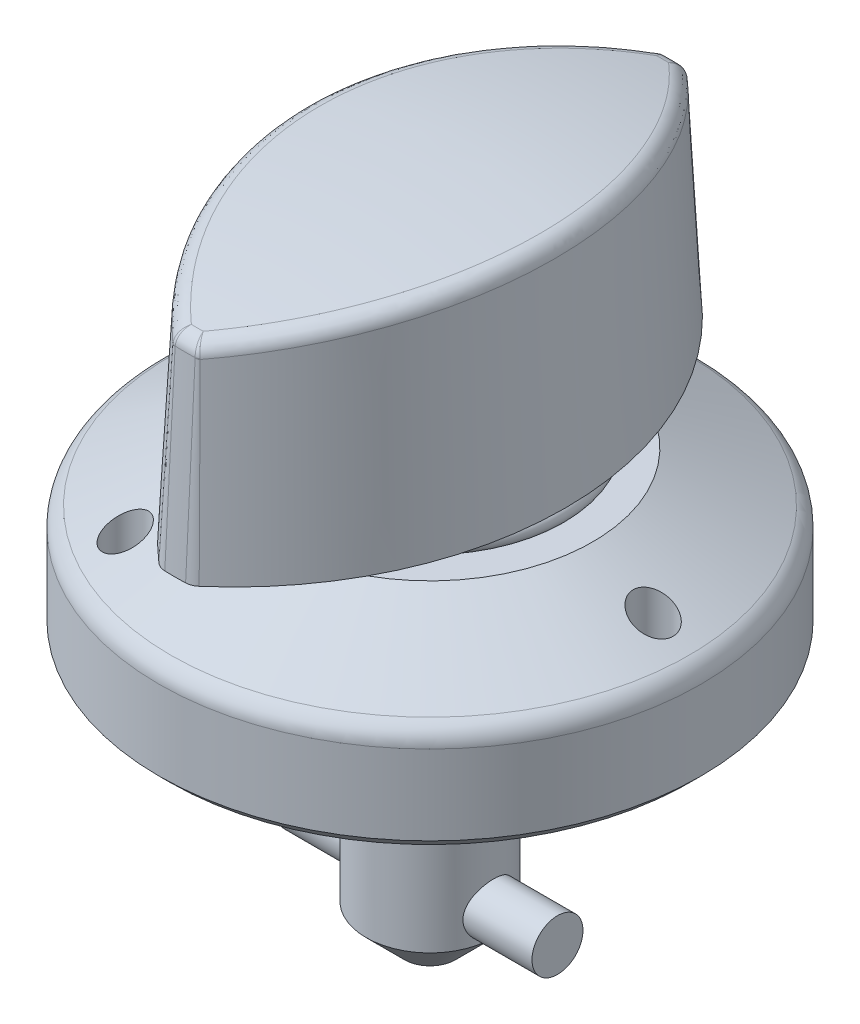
ISO-10303-21;
HEADER;
FILE_DESCRIPTION(('STEP AP214'),'2;1');
FILE_NAME('part.step','',(''),(''),'','','');
FILE_SCHEMA(('AUTOMOTIVE_DESIGN { 1 0 10303 214 1 1 1 1 }'));
ENDSEC;
DATA;
#1=APPLICATION_CONTEXT('core data for automotive mechanical design processes');
#2=APPLICATION_PROTOCOL_DEFINITION('international standard','automotive_design',2000,#1);
#3=PRODUCT_CONTEXT('',#1,'mechanical');
#4=PRODUCT('Part','Part','',(#3));
#5=PRODUCT_RELATED_PRODUCT_CATEGORY('part','',(#4));
#6=PRODUCT_DEFINITION_FORMATION('','',#4);
#7=PRODUCT_DEFINITION_CONTEXT('part definition',#1,'design');
#8=PRODUCT_DEFINITION('design','',#6,#7);
#9=PRODUCT_DEFINITION_SHAPE('','',#8);
#10=(LENGTH_UNIT() NAMED_UNIT(*) SI_UNIT(.MILLI.,.METRE.));
#11=(NAMED_UNIT(*) PLANE_ANGLE_UNIT() SI_UNIT($,.RADIAN.));
#12=(NAMED_UNIT(*) SI_UNIT($,.STERADIAN.) SOLID_ANGLE_UNIT());
#13=UNCERTAINTY_MEASURE_WITH_UNIT(LENGTH_MEASURE(1.E-05),#10,'distance_accuracy_value','');
#14=(GEOMETRIC_REPRESENTATION_CONTEXT(3) GLOBAL_UNCERTAINTY_ASSIGNED_CONTEXT((#13)) GLOBAL_UNIT_ASSIGNED_CONTEXT((#10,
#11,#12)) REPRESENTATION_CONTEXT('',''));
#15=CARTESIAN_POINT('',(0.,0.,0.));
#16=DIRECTION('',(0.,0.,1.));
#17=DIRECTION('',(1.,0.,0.));
#18=AXIS2_PLACEMENT_3D('',#15,#16,#17);
#19=CARTESIAN_POINT('',(0.,-11.5,0.));
#20=DIRECTION('',(0.,-1.,0.));
#21=DIRECTION('',(0.,0.,-1.));
#22=AXIS2_PLACEMENT_3D('',#19,#20,#21);
#23=PLANE('',#22);
#24=CARTESIAN_POINT('',(0.,-11.5,0.));
#25=DIRECTION('',(0.,-1.,0.));
#26=DIRECTION('',(0.,0.,-1.));
#27=AXIS2_PLACEMENT_3D('',#24,#25,#26);
#28=CIRCLE('',#27,1.6);
#29=CARTESIAN_POINT('',(0.,-11.5,-1.6));
#30=VERTEX_POINT('',#29);
#31=EDGE_CURVE('P0_E41',#30,#30,#28,.T.);
#32=ORIENTED_EDGE('',*,*,#31,.T.);
#33=EDGE_LOOP('',(#32));
#34=FACE_BOUND('',#33,.T.);
#35=ADVANCED_FACE('P0_F16',(#34),#23,.T.);
#36=CARTESIAN_POINT('',(0.,-11.5,0.));
#37=DIRECTION('',(0.,1.,0.));
#38=DIRECTION('',(0.,0.,1.));
#39=AXIS2_PLACEMENT_3D('',#36,#37,#38);
#40=CONICAL_SURFACE('',#39,1.6,0.78539816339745);
#41=CARTESIAN_POINT('',(0.,-9.10000000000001,0.));
#42=DIRECTION('',(0.,-1.,0.));
#43=DIRECTION('',(0.,0.,-1.));
#44=AXIS2_PLACEMENT_3D('',#41,#42,#43);
#45=CIRCLE('',#44,4.);
#46=CARTESIAN_POINT('',(4.00000000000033,-9.10000000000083,0.));
#47=VERTEX_POINT('',#46);
#48=CARTESIAN_POINT('',(-4.,-9.10000000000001,0.));
#49=VERTEX_POINT('',#48);
#50=EDGE_CURVE('P0_E34',#47,#49,#45,.T.);
#51=ORIENTED_EDGE('',*,*,#50,.T.);
#52=EDGE_CURVE('P0_E40',#49,#47,#45,.T.);
#53=ORIENTED_EDGE('',*,*,#52,.T.);
#54=EDGE_LOOP('',(#51,#53));
#55=FACE_BOUND('',#54,.T.);
#56=ORIENTED_EDGE('',*,*,#31,.F.);
#57=EDGE_LOOP('',(#56));
#58=FACE_BOUND('',#57,.T.);
#59=ADVANCED_FACE('P0_F38',(#55,#58),#40,.T.);
#60=CARTESIAN_POINT('',(0.,-11.5,0.));
#61=DIRECTION('',(0.,-1.,0.));
#62=DIRECTION('',(0.,0.,-1.));
#63=AXIS2_PLACEMENT_3D('',#60,#61,#62);
#64=CYLINDRICAL_SURFACE('',#63,4.);
#65=CARTESIAN_POINT('',(0.,0.,0.));
#66=DIRECTION('',(0.,-1.,0.));
#67=DIRECTION('',(0.,0.,-1.));
#68=AXIS2_PLACEMENT_3D('',#65,#66,#67);
#69=CIRCLE('',#68,4.);
#70=CARTESIAN_POINT('',(0.,0.,-4.));
#71=VERTEX_POINT('',#70);
#72=EDGE_CURVE('P0_E45',#71,#71,#69,.T.);
#73=ORIENTED_EDGE('',*,*,#72,.T.);
#74=EDGE_LOOP('',(#73));
#75=FACE_BOUND('',#74,.T.);
#76=ORIENTED_EDGE('',*,*,#50,.F.);
#77=CARTESIAN_POINT('',(3.66606055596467,-7.50000000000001,1.6));
#78=CARTESIAN_POINT('',(3.66606921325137,-7.58571159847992,1.59999060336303));
#79=CARTESIAN_POINT('',(3.66910881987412,-7.67154442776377,1.59307185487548));
#80=CARTESIAN_POINT('',(3.68088731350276,-7.84074786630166,1.56565522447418));
#81=CARTESIAN_POINT('',(3.68964076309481,-7.9241116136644,1.5451226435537));
#82=CARTESIAN_POINT('',(3.71168364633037,-8.08564235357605,1.49138802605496));
#83=CARTESIAN_POINT('',(3.72495597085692,-8.16382763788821,1.45823372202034));
#84=CARTESIAN_POINT('',(3.75451732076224,-8.3135080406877,1.38033621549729));
#85=CARTESIAN_POINT('',(3.77080568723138,-8.3850046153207,1.335595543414));
#86=CARTESIAN_POINT('',(3.80560692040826,-8.52340832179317,1.23305757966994));
#87=CARTESIAN_POINT('',(3.82419134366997,-8.58988513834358,1.17470348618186));
#88=CARTESIAN_POINT('',(3.86089965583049,-8.71242319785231,1.04776728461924));
#89=CARTESIAN_POINT('',(3.87902338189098,-8.7684808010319,0.979181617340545));
#90=CARTESIAN_POINT('',(3.91362726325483,-8.87072511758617,0.830405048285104));
#91=CARTESIAN_POINT('',(3.93001442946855,-8.91643544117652,0.749863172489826));
#92=CARTESIAN_POINT('',(3.95843142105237,-8.99347485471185,0.581460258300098));
#93=CARTESIAN_POINT('',(3.97046301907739,-9.02480979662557,0.493602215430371));
#94=CARTESIAN_POINT('',(3.98830660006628,-9.07067318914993,0.317573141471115));
#95=CARTESIAN_POINT('',(3.99439149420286,-9.08594185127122,0.229623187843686));
#96=CARTESIAN_POINT('',(4.00064248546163,-9.10162278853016,0.0522130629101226));
#97=CARTESIAN_POINT('',(4.0008107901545,-9.10204060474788,-0.0372465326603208));
#98=CARTESIAN_POINT('',(3.99537570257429,-9.08841378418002,-0.209785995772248));
#99=CARTESIAN_POINT('',(3.99009597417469,-9.07518018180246,-0.292941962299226));
#100=CARTESIAN_POINT('',(3.97479433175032,-9.0360056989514,-0.455738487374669));
#101=CARTESIAN_POINT('',(3.9647720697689,-9.0100638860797,-0.535378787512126));
#102=CARTESIAN_POINT('',(3.9407745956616,-8.94589081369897,-0.690318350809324));
#103=CARTESIAN_POINT('',(3.9267420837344,-8.90748022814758,-0.765534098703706));
#104=CARTESIAN_POINT('',(3.89611668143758,-8.8196279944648,-0.908646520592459));
#105=CARTESIAN_POINT('',(3.87952291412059,-8.77018256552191,-0.976540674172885));
#106=CARTESIAN_POINT('',(3.84417309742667,-8.65788069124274,-1.10781506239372));
#107=CARTESIAN_POINT('',(3.82534661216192,-8.59435688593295,-1.17060627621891));
#108=CARTESIAN_POINT('',(3.78849328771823,-8.45760754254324,-1.28488593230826));
#109=CARTESIAN_POINT('',(3.77046671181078,-8.38437884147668,-1.33637067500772));
#110=CARTESIAN_POINT('',(3.7367751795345,-8.22766478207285,-1.42792335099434));
#111=CARTESIAN_POINT('',(3.72119131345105,-8.14394813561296,-1.46762772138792));
#112=CARTESIAN_POINT('',(3.69510072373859,-7.9702276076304,-1.53214100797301));
#113=CARTESIAN_POINT('',(3.68459070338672,-7.88022785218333,-1.55695959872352));
#114=CARTESIAN_POINT('',(3.67063807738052,-7.70237137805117,-1.58956395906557));
#115=CARTESIAN_POINT('',(3.6668029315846,-7.61471964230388,-1.59829767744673));
#116=CARTESIAN_POINT('',(3.66551598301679,-7.43913823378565,-1.60124906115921));
#117=CARTESIAN_POINT('',(3.6680622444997,-7.35120865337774,-1.59547112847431));
#118=CARTESIAN_POINT('',(3.67884835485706,-7.18283285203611,-1.57042631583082));
#119=CARTESIAN_POINT('',(3.68675566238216,-7.10224565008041,-1.55194644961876));
#120=CARTESIAN_POINT('',(3.70696040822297,-6.9453692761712,-1.50304334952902));
#121=CARTESIAN_POINT('',(3.71925881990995,-6.86908106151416,-1.47261746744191));
#122=CARTESIAN_POINT('',(3.7474702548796,-6.71951811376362,-1.39930851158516));
#123=CARTESIAN_POINT('',(3.76350963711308,-6.64649104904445,-1.35597029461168));
#124=CARTESIAN_POINT('',(3.7972030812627,-6.50841361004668,-1.2585321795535));
#125=CARTESIAN_POINT('',(3.8148577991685,-6.44336650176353,-1.20442789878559));
#126=CARTESIAN_POINT('',(3.85136732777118,-6.31810127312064,-1.08227536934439));
#127=CARTESIAN_POINT('',(3.87021445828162,-6.25859474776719,-1.01349234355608));
#128=CARTESIAN_POINT('',(3.9057583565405,-6.15185833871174,-0.866466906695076));
#129=CARTESIAN_POINT('',(3.92245503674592,-6.10462895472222,-0.788224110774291));
#130=CARTESIAN_POINT('',(3.95186972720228,-6.02396189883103,-0.624223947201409));
#131=CARTESIAN_POINT('',(3.96458868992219,-5.99052092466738,-0.538468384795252));
#132=CARTESIAN_POINT('',(3.98458170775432,-5.93876091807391,-0.36191487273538));
#133=CARTESIAN_POINT('',(3.99185871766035,-5.92043367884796,-0.271119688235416));
#134=CARTESIAN_POINT('',(3.9998320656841,-5.9003962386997,-0.0934532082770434));
#135=CARTESIAN_POINT('',(4.00092677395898,-5.89767989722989,-0.00671239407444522));
#136=CARTESIAN_POINT('',(3.99748833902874,-5.90628438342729,0.165947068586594));
#137=CARTESIAN_POINT('',(3.9929560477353,-5.91760308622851,0.251865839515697));
#138=CARTESIAN_POINT('',(3.97897210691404,-5.95323743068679,0.417736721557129));
#139=CARTESIAN_POINT('',(3.96967584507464,-5.97714315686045,0.497791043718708));
#140=CARTESIAN_POINT('',(3.9471595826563,-6.03684224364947,0.652737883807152));
#141=CARTESIAN_POINT('',(3.93393885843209,-6.07263779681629,0.72762944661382));
#142=CARTESIAN_POINT('',(3.90414475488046,-6.15688255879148,0.873762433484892));
#143=CARTESIAN_POINT('',(3.88744903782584,-6.20582103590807,0.94469630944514));
#144=CARTESIAN_POINT('',(3.85271522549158,-6.31423081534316,1.07764322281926));
#145=CARTESIAN_POINT('',(3.834676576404,-6.3737064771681,1.1396525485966));
#146=CARTESIAN_POINT('',(3.79790210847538,-6.50585217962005,1.25696101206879));
#147=CARTESIAN_POINT('',(3.77919226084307,-6.57911109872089,1.31160710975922));
#148=CARTESIAN_POINT('',(3.74439737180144,-6.73435370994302,1.40787796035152));
#149=CARTESIAN_POINT('',(3.72831263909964,-6.81633842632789,1.44950118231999));
#150=CARTESIAN_POINT('',(3.70207091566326,-6.97922976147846,1.51519287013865));
#151=CARTESIAN_POINT('',(3.69151134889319,-7.05957218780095,1.54050201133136));
#152=CARTESIAN_POINT('',(3.67556802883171,-7.22358833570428,1.57817420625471));
#153=CARTESIAN_POINT('',(3.6701698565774,-7.30725209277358,1.59057333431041));
#154=CARTESIAN_POINT('',(3.66659567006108,-7.42750204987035,1.59877140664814));
#155=CARTESIAN_POINT('',(3.66605689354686,-7.46374017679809,1.6000039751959));
#156=CARTESIAN_POINT('',(3.66606055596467,-7.50000000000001,1.6));
#157=B_SPLINE_CURVE_WITH_KNOTS('',3,(#77,#78,#79,#80,#81,#82,#83,#84,#85,#86,#87,#88,#89,#90,
#91,#92,#93,#94,#95,#96,#97,#98,#99,#100,#101,#102,#103,#104,#105,#106,#107,#108,#109,#110,#111,
#112,#113,#114,#115,#116,#117,#118,#119,#120,#121,#122,#123,#124,#125,#126,#127,#128,#129,#130,
#131,#132,#133,#134,#135,#136,#137,#138,#139,#140,#141,#142,#143,#144,#145,#146,#147,#148,#149,
#150,#151,#152,#153,#154,#155,#156),.UNSPECIFIED.,.T.,.F.,(4,2,2,2,2,2,2,2,2,2,2,2,2,2,2,2,2,2,
2,2,2,2,2,2,2,2,2,2,2,2,2,2,2,2,2,2,2,2,2,4),(0.,0.257022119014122,0.514701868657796,
0.771416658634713,1.02807543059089,1.2980449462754,1.56810859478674,1.84882135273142,
2.12941973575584,2.39643346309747,2.66334756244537,2.91526915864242,3.16720924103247,
3.42294640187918,3.67877131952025,3.95139235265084,4.22410245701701,4.50451566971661,
4.78474643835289,5.04785718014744,5.3108881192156,5.55893798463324,5.80704286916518,
6.06520923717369,6.32348091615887,6.60082987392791,6.87819011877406,7.15548389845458,
7.43262700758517,7.6916883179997,7.95071041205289,8.2017759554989,8.45288782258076,
8.71509640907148,8.97741373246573,9.25597002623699,9.53455905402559,9.78813328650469,
10.040997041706,10.1497288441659),.UNSPECIFIED.);
#158=EDGE_CURVE('P0_E11',#47,#47,#157,.T.);
#159=ORIENTED_EDGE('',*,*,#158,.F.);
#160=ORIENTED_EDGE('',*,*,#52,.F.);
#161=CARTESIAN_POINT('',(-3.66606055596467,-7.50000000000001,1.6));
#162=CARTESIAN_POINT('',(-3.66606921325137,-7.4142884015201,1.59999060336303));
#163=CARTESIAN_POINT('',(-3.66910881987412,-7.32845557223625,1.59307185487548));
#164=CARTESIAN_POINT('',(-3.68088731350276,-7.15925213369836,1.56565522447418));
#165=CARTESIAN_POINT('',(-3.68964076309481,-7.07588838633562,1.5451226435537));
#166=CARTESIAN_POINT('',(-3.71168364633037,-6.91435764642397,1.49138802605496));
#167=CARTESIAN_POINT('',(-3.72495597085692,-6.8361723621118,1.45823372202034));
#168=CARTESIAN_POINT('',(-3.75451732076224,-6.68649195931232,1.38033621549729));
#169=CARTESIAN_POINT('',(-3.77080568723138,-6.61499538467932,1.335595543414));
#170=CARTESIAN_POINT('',(-3.80560692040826,-6.47659167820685,1.23305757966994));
#171=CARTESIAN_POINT('',(-3.82419134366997,-6.41011486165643,1.17470348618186));
#172=CARTESIAN_POINT('',(-3.86089965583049,-6.28757680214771,1.04776728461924));
#173=CARTESIAN_POINT('',(-3.87902338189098,-6.23151919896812,0.979181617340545));
#174=CARTESIAN_POINT('',(-3.91362726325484,-6.12927488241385,0.830405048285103));
#175=CARTESIAN_POINT('',(-3.93001442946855,-6.08356455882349,0.749863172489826));
#176=CARTESIAN_POINT('',(-3.95843142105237,-6.00652514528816,0.581460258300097));
#177=CARTESIAN_POINT('',(-3.97046301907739,-5.97519020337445,0.49360221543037));
#178=CARTESIAN_POINT('',(-3.98830660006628,-5.92932681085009,0.317573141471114));
#179=CARTESIAN_POINT('',(-3.99439149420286,-5.91405814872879,0.229623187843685));
#180=CARTESIAN_POINT('',(-4.00064248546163,-5.89837721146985,0.052213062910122));
#181=CARTESIAN_POINT('',(-4.0008107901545,-5.89795939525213,-0.0372465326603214));
#182=CARTESIAN_POINT('',(-3.99537570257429,-5.91158621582,-0.209785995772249));
#183=CARTESIAN_POINT('',(-3.99009597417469,-5.92481981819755,-0.292941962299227));
#184=CARTESIAN_POINT('',(-3.97479433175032,-5.96399430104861,-0.45573848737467));
#185=CARTESIAN_POINT('',(-3.9647720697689,-5.98993611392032,-0.535378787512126));
#186=CARTESIAN_POINT('',(-3.9407745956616,-6.05410918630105,-0.690318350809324));
#187=CARTESIAN_POINT('',(-3.9267420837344,-6.09251977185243,-0.765534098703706));
#188=CARTESIAN_POINT('',(-3.89611668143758,-6.18037200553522,-0.908646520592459));
#189=CARTESIAN_POINT('',(-3.87952291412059,-6.22981743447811,-0.976540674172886));
#190=CARTESIAN_POINT('',(-3.84417309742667,-6.34211930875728,-1.10781506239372));
#191=CARTESIAN_POINT('',(-3.82534661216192,-6.40564311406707,-1.17060627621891));
#192=CARTESIAN_POINT('',(-3.78849328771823,-6.54239245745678,-1.28488593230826));
#193=CARTESIAN_POINT('',(-3.77046671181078,-6.61562115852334,-1.33637067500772));
#194=CARTESIAN_POINT('',(-3.7367751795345,-6.77233521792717,-1.42792335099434));
#195=CARTESIAN_POINT('',(-3.72119131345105,-6.85605186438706,-1.46762772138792));
#196=CARTESIAN_POINT('',(-3.69510072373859,-7.02977239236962,-1.53214100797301));
#197=CARTESIAN_POINT('',(-3.68459070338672,-7.11977214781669,-1.55695959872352));
#198=CARTESIAN_POINT('',(-3.67063807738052,-7.29762862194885,-1.58956395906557));
#199=CARTESIAN_POINT('',(-3.66680293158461,-7.38528035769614,-1.59829767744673));
#200=CARTESIAN_POINT('',(-3.66551598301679,-7.56086176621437,-1.60124906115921));
#201=CARTESIAN_POINT('',(-3.6680622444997,-7.64879134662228,-1.59547112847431));
#202=CARTESIAN_POINT('',(-3.67884835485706,-7.81716714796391,-1.57042631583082));
#203=CARTESIAN_POINT('',(-3.68675566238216,-7.89775434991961,-1.55194644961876));
#204=CARTESIAN_POINT('',(-3.70696040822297,-8.05463072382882,-1.50304334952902));
#205=CARTESIAN_POINT('',(-3.71925881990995,-8.13091893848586,-1.47261746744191));
#206=CARTESIAN_POINT('',(-3.7474702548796,-8.2804818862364,-1.39930851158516));
#207=CARTESIAN_POINT('',(-3.76350963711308,-8.35350895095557,-1.35597029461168));
#208=CARTESIAN_POINT('',(-3.7972030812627,-8.49158638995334,-1.2585321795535));
#209=CARTESIAN_POINT('',(-3.8148577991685,-8.55663349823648,-1.20442789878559));
#210=CARTESIAN_POINT('',(-3.85136732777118,-8.68189872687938,-1.08227536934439));
#211=CARTESIAN_POINT('',(-3.87021445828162,-8.74140525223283,-1.01349234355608));
#212=CARTESIAN_POINT('',(-3.9057583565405,-8.84814166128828,-0.866466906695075));
#213=CARTESIAN_POINT('',(-3.92245503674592,-8.8953710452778,-0.788224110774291));
#214=CARTESIAN_POINT('',(-3.95186972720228,-8.97603810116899,-0.624223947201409));
#215=CARTESIAN_POINT('',(-3.96458868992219,-9.00947907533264,-0.538468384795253));
#216=CARTESIAN_POINT('',(-3.98458170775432,-9.06123908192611,-0.36191487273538));
#217=CARTESIAN_POINT('',(-3.99185871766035,-9.07956632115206,-0.271119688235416));
#218=CARTESIAN_POINT('',(-3.9998320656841,-9.09960376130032,-0.0934532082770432));
#219=CARTESIAN_POINT('',(-4.00092677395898,-9.10232010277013,-0.00671239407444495));
#220=CARTESIAN_POINT('',(-3.99748833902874,-9.09371561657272,0.165947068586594));
#221=CARTESIAN_POINT('',(-3.9929560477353,-9.08239691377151,0.251865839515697));
#222=CARTESIAN_POINT('',(-3.97897210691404,-9.04676256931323,0.417736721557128));
#223=CARTESIAN_POINT('',(-3.96967584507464,-9.02285684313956,0.497791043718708));
#224=CARTESIAN_POINT('',(-3.9471595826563,-8.96315775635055,0.652737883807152));
#225=CARTESIAN_POINT('',(-3.93393885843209,-8.92736220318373,0.72762944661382));
#226=CARTESIAN_POINT('',(-3.90414475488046,-8.84311744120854,0.873762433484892));
#227=CARTESIAN_POINT('',(-3.88744903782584,-8.79417896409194,0.94469630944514));
#228=CARTESIAN_POINT('',(-3.85271522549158,-8.68576918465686,1.07764322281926));
#229=CARTESIAN_POINT('',(-3.834676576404,-8.62629352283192,1.1396525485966));
#230=CARTESIAN_POINT('',(-3.79790210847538,-8.49414782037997,1.25696101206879));
#231=CARTESIAN_POINT('',(-3.77919226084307,-8.42088890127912,1.31160710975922));
#232=CARTESIAN_POINT('',(-3.74439737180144,-8.26564629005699,1.40787796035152));
#233=CARTESIAN_POINT('',(-3.72831263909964,-8.18366157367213,1.44950118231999));
#234=CARTESIAN_POINT('',(-3.70207091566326,-8.02077023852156,1.51519287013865));
#235=CARTESIAN_POINT('',(-3.69151134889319,-7.94042781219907,1.54050201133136));
#236=CARTESIAN_POINT('',(-3.67556802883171,-7.77641166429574,1.57817420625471));
#237=CARTESIAN_POINT('',(-3.6701698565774,-7.69274790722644,1.59057333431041));
#238=CARTESIAN_POINT('',(-3.66659567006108,-7.57249795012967,1.59877140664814));
#239=CARTESIAN_POINT('',(-3.66605689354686,-7.53625982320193,1.6000039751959));
#240=CARTESIAN_POINT('',(-3.66606055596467,-7.50000000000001,1.6));
#241=B_SPLINE_CURVE_WITH_KNOTS('',3,(#161,#162,#163,#164,#165,#166,#167,#168,#169,#170,#171,
#172,#173,#174,#175,#176,#177,#178,#179,#180,#181,#182,#183,#184,#185,#186,#187,#188,#189,#190,
#191,#192,#193,#194,#195,#196,#197,#198,#199,#200,#201,#202,#203,#204,#205,#206,#207,#208,#209,
#210,#211,#212,#213,#214,#215,#216,#217,#218,#219,#220,#221,#222,#223,#224,#225,#226,#227,#228,
#229,#230,#231,#232,#233,#234,#235,#236,#237,#238,#239,#240),.UNSPECIFIED.,.T.,.F.,(4,2,2,2,2,2,
2,2,2,2,2,2,2,2,2,2,2,2,2,2,2,2,2,2,2,2,2,2,2,2,2,2,2,2,2,2,2,2,2,4),(0.,0.257022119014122,
0.514701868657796,0.771416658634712,1.02807543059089,1.2980449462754,1.56810859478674,
1.84882135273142,2.12941973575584,2.39643346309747,2.66334756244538,2.91526915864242,
3.16720924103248,3.42294640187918,3.67877131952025,3.95139235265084,4.22410245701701,
4.50451566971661,4.78474643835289,5.04785718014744,5.31088811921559,5.55893798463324,
5.80704286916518,6.06520923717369,6.32348091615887,6.60082987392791,6.87819011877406,
7.15548389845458,7.43262700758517,7.6916883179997,7.95071041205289,8.2017759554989,
8.45288782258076,8.71509640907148,8.97741373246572,9.25597002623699,9.53455905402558,
9.78813328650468,10.040997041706,10.1497288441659),.UNSPECIFIED.);
#242=EDGE_CURVE('P0_E27',#49,#49,#241,.T.);
#243=ORIENTED_EDGE('',*,*,#242,.F.);
#244=EDGE_LOOP('',(#76,#159,#160,#243));
#245=FACE_BOUND('',#244,.T.);
#246=ADVANCED_FACE('P0_F43',(#75,#245),#64,.T.);
#247=CARTESIAN_POINT('',(4.,0.,0.));
#248=DIRECTION('',(0.,1.,0.));
#249=DIRECTION('',(0.,0.,1.));
#250=AXIS2_PLACEMENT_3D('',#247,#248,#249);
#251=PLANE('',#250);
#252=CARTESIAN_POINT('',(0.,0.,0.));
#253=DIRECTION('',(0.,-1.,0.));
#254=DIRECTION('',(0.,0.,-1.));
#255=AXIS2_PLACEMENT_3D('',#252,#253,#254);
#256=CIRCLE('',#255,3.2);
#257=CARTESIAN_POINT('',(0.,0.,-3.2));
#258=VERTEX_POINT('',#257);
#259=EDGE_CURVE('P0_E47',#258,#258,#256,.T.);
#260=ORIENTED_EDGE('',*,*,#259,.T.);
#261=EDGE_LOOP('',(#260));
#262=FACE_BOUND('',#261,.T.);
#263=ORIENTED_EDGE('',*,*,#72,.F.);
#264=EDGE_LOOP('',(#263));
#265=FACE_BOUND('',#264,.T.);
#266=ADVANCED_FACE('P0_F79',(#262,#265),#251,.T.);
#267=CARTESIAN_POINT('',(0.,-11.5,0.));
#268=DIRECTION('',(0.,-1.,0.));
#269=DIRECTION('',(0.,0.,-1.));
#270=AXIS2_PLACEMENT_3D('',#267,#268,#269);
#271=CYLINDRICAL_SURFACE('',#270,3.2);
#272=CARTESIAN_POINT('',(0.,20.2,0.));
#273=DIRECTION('',(0.,-1.,0.));
#274=DIRECTION('',(0.,0.,-1.));
#275=AXIS2_PLACEMENT_3D('',#272,#273,#274);
#276=CIRCLE('',#275,3.2);
#277=CARTESIAN_POINT('',(0.,20.2,-3.2));
#278=VERTEX_POINT('',#277);
#279=EDGE_CURVE('P0_E155',#278,#278,#276,.T.);
#280=ORIENTED_EDGE('',*,*,#279,.T.);
#281=EDGE_LOOP('',(#280));
#282=FACE_BOUND('',#281,.T.);
#283=ORIENTED_EDGE('',*,*,#259,.F.);
#284=EDGE_LOOP('',(#283));
#285=FACE_BOUND('',#284,.T.);
#286=ADVANCED_FACE('P0_F76',(#282,#285),#271,.T.);
#287=CARTESIAN_POINT('',(0.,20.2,0.));
#288=DIRECTION('',(0.,-1.,0.));
#289=DIRECTION('',(0.,0.,-1.));
#290=AXIS2_PLACEMENT_3D('',#287,#288,#289);
#291=CONICAL_SURFACE('',#290,3.2,0.785398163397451);
#292=CARTESIAN_POINT('',(0.,21.,0.));
#293=DIRECTION('',(0.,-1.,0.));
#294=DIRECTION('',(0.,0.,-1.));
#295=AXIS2_PLACEMENT_3D('',#292,#293,#294);
#296=CIRCLE('',#295,2.4);
#297=CARTESIAN_POINT('',(0.,21.,-2.4));
#298=VERTEX_POINT('',#297);
#299=EDGE_CURVE('P0_E150',#298,#298,#296,.T.);
#300=ORIENTED_EDGE('',*,*,#299,.T.);
#301=EDGE_LOOP('',(#300));
#302=FACE_BOUND('',#301,.T.);
#303=ORIENTED_EDGE('',*,*,#279,.F.);
#304=EDGE_LOOP('',(#303));
#305=FACE_BOUND('',#304,.T.);
#306=ADVANCED_FACE('P0_F72',(#302,#305),#291,.T.);
#307=CARTESIAN_POINT('',(2.4,21.,0.));
#308=DIRECTION('',(0.,1.,0.));
#309=DIRECTION('',(0.,0.,1.));
#310=AXIS2_PLACEMENT_3D('',#307,#308,#309);
#311=PLANE('',#310);
#312=ORIENTED_EDGE('',*,*,#299,.F.);
#313=EDGE_LOOP('',(#312));
#314=FACE_BOUND('',#313,.T.);
#315=ADVANCED_FACE('P0_F68',(#314),#311,.T.);
#316=CARTESIAN_POINT('',(-8.,-7.50000000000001,0.));
#317=DIRECTION('',(-1.,0.,0.));
#318=DIRECTION('',(0.,0.,1.));
#319=AXIS2_PLACEMENT_3D('',#316,#317,#318);
#320=PLANE('',#319);
#321=CARTESIAN_POINT('',(-8.,-7.50000000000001,0.));
#322=DIRECTION('',(-1.,0.,0.));
#323=DIRECTION('',(0.,0.,1.));
#324=AXIS2_PLACEMENT_3D('',#321,#322,#323);
#325=CIRCLE('',#324,1.6);
#326=CARTESIAN_POINT('',(-8.,-7.50000000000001,1.6));
#327=VERTEX_POINT('',#326);
#328=EDGE_CURVE('P0_E147',#327,#327,#325,.T.);
#329=ORIENTED_EDGE('',*,*,#328,.T.);
#330=EDGE_LOOP('',(#329));
#331=FACE_BOUND('',#330,.T.);
#332=ADVANCED_FACE('P0_F62',(#331),#320,.T.);
#333=CARTESIAN_POINT('',(-5.26029262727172,-7.50000000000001,0.));
#334=DIRECTION('',(-1.,0.,0.));
#335=DIRECTION('',(0.,0.,1.));
#336=AXIS2_PLACEMENT_3D('',#333,#334,#335);
#337=CYLINDRICAL_SURFACE('',#336,1.6);
#338=ORIENTED_EDGE('',*,*,#242,.T.);
#339=EDGE_LOOP('',(#338));
#340=FACE_BOUND('',#339,.T.);
#341=ORIENTED_EDGE('',*,*,#328,.F.);
#342=EDGE_LOOP('',(#341));
#343=FACE_BOUND('',#342,.T.);
#344=ADVANCED_FACE('P0_F56',(#340,#343),#337,.T.);
#345=ORIENTED_EDGE('',*,*,#158,.T.);
#346=EDGE_LOOP('',(#345));
#347=FACE_BOUND('',#346,.T.);
#348=CARTESIAN_POINT('',(8.,-7.50000000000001,0.));
#349=DIRECTION('',(-1.,0.,0.));
#350=DIRECTION('',(0.,0.,1.));
#351=AXIS2_PLACEMENT_3D('',#348,#349,#350);
#352=CIRCLE('',#351,1.6);
#353=CARTESIAN_POINT('',(8.,-7.50000000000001,1.6));
#354=VERTEX_POINT('',#353);
#355=EDGE_CURVE('P0_E145',#354,#354,#352,.T.);
#356=ORIENTED_EDGE('',*,*,#355,.T.);
#357=EDGE_LOOP('',(#356));
#358=FACE_BOUND('',#357,.T.);
#359=ADVANCED_FACE('P0_F61',(#347,#358),#337,.T.);
#360=CARTESIAN_POINT('',(8.,-9.10000000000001,0.));
#361=DIRECTION('',(1.,0.,0.));
#362=DIRECTION('',(0.,0.,-1.));
#363=AXIS2_PLACEMENT_3D('',#360,#361,#362);
#364=PLANE('',#363);
#365=ORIENTED_EDGE('',*,*,#355,.F.);
#366=EDGE_LOOP('',(#365));
#367=FACE_BOUND('',#366,.T.);
#368=ADVANCED_FACE('P0_F64',(#367),#364,.T.);
#369=CLOSED_SHELL('',(#35,#59,#246,#266,#286,#306,#315,#332,#344,#359,#368));
#370=MANIFOLD_SOLID_BREP('P0_B1',#369);
#371=CARTESIAN_POINT('',(16.,16.5,0.));
#372=DIRECTION('',(0.,-1.,0.));
#373=DIRECTION('',(0.,0.,-1.));
#374=AXIS2_PLACEMENT_3D('',#371,#372,#373);
#375=PLANE('',#374);
#376=CARTESIAN_POINT('',(0.,16.5,0.));
#377=DIRECTION('',(0.,-1.,0.));
#378=DIRECTION('',(0.,0.,-1.));
#379=AXIS2_PLACEMENT_3D('',#376,#377,#378);
#380=CIRCLE('',#379,3.2);
#381=CARTESIAN_POINT('',(0.,16.5,-3.2));
#382=VERTEX_POINT('',#381);
#383=EDGE_CURVE('P1_E678',#382,#382,#380,.T.);
#384=ORIENTED_EDGE('',*,*,#383,.F.);
#385=EDGE_LOOP('',(#384));
#386=FACE_BOUND('',#385,.T.);
#387=CARTESIAN_POINT('',(-12.25,16.5,0.));
#388=DIRECTION('',(0.,-1.,0.));
#389=DIRECTION('',(0.,0.,1.));
#390=AXIS2_PLACEMENT_3D('',#387,#388,#389);
#391=CIRCLE('',#390,20.75);
#392=CARTESIAN_POINT('',(1.26349780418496,16.5,-15.7463607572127));
#393=VERTEX_POINT('',#392);
#394=CARTESIAN_POINT('',(1.26349780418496,16.5,15.7463607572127));
#395=VERTEX_POINT('',#394);
#396=EDGE_CURVE('P1_E758',#393,#395,#391,.T.);
#397=ORIENTED_EDGE('',*,*,#396,.T.);
#398=CARTESIAN_POINT('',(0.61224489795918,16.5,14.987499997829));
#399=DIRECTION('',(0.,-1.,0.));
#400=DIRECTION('',(0.,0.,-1.));
#401=AXIS2_PLACEMENT_3D('',#398,#399,#400);
#402=CIRCLE('',#401,1.);
#403=CARTESIAN_POINT('',(0.653061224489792,16.5,15.9866666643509));
#404=VERTEX_POINT('',#403);
#405=EDGE_CURVE('P1_E76',#395,#404,#402,.T.);
#406=ORIENTED_EDGE('',*,*,#405,.T.);
#407=CARTESIAN_POINT('',(0.,16.5,0.));
#408=DIRECTION('',(0.,-1.,0.));
#409=DIRECTION('',(0.,0.,-1.));
#410=AXIS2_PLACEMENT_3D('',#407,#408,#409);
#411=CIRCLE('',#410,16.);
#412=CARTESIAN_POINT('',(-0.653061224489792,16.5,15.9866666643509));
#413=VERTEX_POINT('',#412);
#414=EDGE_CURVE('P1_E691',#404,#413,#411,.T.);
#415=ORIENTED_EDGE('',*,*,#414,.T.);
#416=CARTESIAN_POINT('',(-0.61224489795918,16.5,14.987499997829));
#417=DIRECTION('',(0.,-1.,0.));
#418=DIRECTION('',(0.,0.,-1.));
#419=AXIS2_PLACEMENT_3D('',#416,#417,#418);
#420=CIRCLE('',#419,1.);
#421=CARTESIAN_POINT('',(-1.26349780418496,16.5,15.7463607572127));
#422=VERTEX_POINT('',#421);
#423=EDGE_CURVE('P1_E686',#413,#422,#420,.T.);
#424=ORIENTED_EDGE('',*,*,#423,.T.);
#425=CARTESIAN_POINT('',(12.25,16.5,0.));
#426=DIRECTION('',(0.,-1.,0.));
#427=DIRECTION('',(0.,0.,-1.));
#428=AXIS2_PLACEMENT_3D('',#425,#426,#427);
#429=CIRCLE('',#428,20.75);
#430=CARTESIAN_POINT('',(-1.26349780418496,16.5,-15.7463607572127));
#431=VERTEX_POINT('',#430);
#432=EDGE_CURVE('P1_E697',#422,#431,#429,.T.);
#433=ORIENTED_EDGE('',*,*,#432,.T.);
#434=CARTESIAN_POINT('',(-0.61224489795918,16.5,-14.987499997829));
#435=DIRECTION('',(0.,-1.,0.));
#436=DIRECTION('',(0.,0.,-1.));
#437=AXIS2_PLACEMENT_3D('',#434,#435,#436);
#438=CIRCLE('',#437,1.);
#439=CARTESIAN_POINT('',(-0.653061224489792,16.5,-15.9866666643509));
#440=VERTEX_POINT('',#439);
#441=EDGE_CURVE('P1_E705',#431,#440,#438,.T.);
#442=ORIENTED_EDGE('',*,*,#441,.T.);
#443=CARTESIAN_POINT('',(0.653061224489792,16.5,-15.9866666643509));
#444=VERTEX_POINT('',#443);
#445=EDGE_CURVE('P1_E603',#440,#444,#411,.T.);
#446=ORIENTED_EDGE('',*,*,#445,.T.);
#447=CARTESIAN_POINT('',(0.61224489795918,16.5,-14.987499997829));
#448=DIRECTION('',(0.,-1.,0.));
#449=DIRECTION('',(0.,0.,-1.));
#450=AXIS2_PLACEMENT_3D('',#447,#448,#449);
#451=CIRCLE('',#450,1.);
#452=EDGE_CURVE('P1_E689',#444,#393,#451,.T.);
#453=ORIENTED_EDGE('',*,*,#452,.T.);
#454=EDGE_LOOP('',(#397,#406,#415,#424,#433,#442,#446,#453));
#455=FACE_BOUND('',#454,.T.);
#456=ADVANCED_FACE('P1_F16',(#386,#455),#375,.T.);
#457=CARTESIAN_POINT('',(0.,-33.9999999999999,0.));
#458=DIRECTION('',(0.,-1.,0.));
#459=DIRECTION('',(1.,0.,0.));
#460=AXIS2_PLACEMENT_3D('',#457,#458,#459);
#461=SPHERICAL_SURFACE('',#460,64.9999999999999);
#462=CARTESIAN_POINT('',(-5.02841802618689,27.2564834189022,18.850318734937));
#463=CARTESIAN_POINT('',(-5.17248836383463,27.9915010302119,18.8642615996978));
#464=CARTESIAN_POINT('',(-5.46982601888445,28.1604622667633,18.197745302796));
#465=CARTESIAN_POINT('',(-4.49343485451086,27.3599454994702,18.6396235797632));
#466=CARTESIAN_POINT('',(-4.63519398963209,28.099569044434,18.6566742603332));
#467=CARTESIAN_POINT('',(-4.95346056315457,28.2655409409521,17.9940895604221));
#468=CARTESIAN_POINT('',(-3.96707695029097,27.4614641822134,18.4059109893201));
#469=CARTESIAN_POINT('',(-4.10739183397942,28.2054376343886,18.4262926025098));
#470=CARTESIAN_POINT('',(-4.44544201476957,28.3686458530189,17.7682266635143));
#471=CARTESIAN_POINT('',(-2.93532100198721,27.6599720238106,17.8941389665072));
#472=CARTESIAN_POINT('',(-3.07203060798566,28.4126022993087,17.920906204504));
#473=CARTESIAN_POINT('',(-3.44967337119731,28.570255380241,17.2737212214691));
#474=CARTESIAN_POINT('',(-2.42992448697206,27.7569608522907,17.6160763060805));
#475=CARTESIAN_POINT('',(-2.56461941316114,28.5138667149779,17.6457574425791));
#476=CARTESIAN_POINT('',(-2.96192475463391,28.6687596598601,17.0050755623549));
#477=CARTESIAN_POINT('',(-1.44396020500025,27.9457355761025,17.0173722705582));
#478=CARTESIAN_POINT('',(-1.573988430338,28.7111064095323,17.0525090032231));
#479=CARTESIAN_POINT('',(-2.01042460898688,28.8604839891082,16.4267166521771));
#480=CARTESIAN_POINT('',(-0.963388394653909,28.037522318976,16.696737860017));
#481=CARTESIAN_POINT('',(-1.09093564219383,28.8070467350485,16.7343023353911));
#482=CARTESIAN_POINT('',(-1.54666917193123,28.9537048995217,16.1170101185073));
#483=CARTESIAN_POINT('',(-0.0306147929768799,28.2152930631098,16.0149880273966));
#484=CARTESIAN_POINT('',(-0.152625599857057,28.9930014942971,16.0569160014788));
#485=CARTESIAN_POINT('',(-0.646566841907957,29.1342533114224,15.4585581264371));
#486=CARTESIAN_POINT('',(0.421588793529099,28.3012774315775,15.6538751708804));
#487=CARTESIAN_POINT('',(0.302441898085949,29.0829768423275,15.6976569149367));
#488=CARTESIAN_POINT('',(-0.21021821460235,29.2215811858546,15.1098151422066));
#489=CARTESIAN_POINT('',(1.28271823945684,28.4646914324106,14.9035715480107));
#490=CARTESIAN_POINT('',(1.16965920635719,29.2540976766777,14.9504630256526));
#491=CARTESIAN_POINT('',(0.620691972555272,29.387548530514,14.3852692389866));
#492=CARTESIAN_POINT('',(1.69246907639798,28.5422864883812,14.5153679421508));
#493=CARTESIAN_POINT('',(1.58246672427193,29.3353811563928,14.5634541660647));
#494=CARTESIAN_POINT('',(1.01605028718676,29.4663560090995,14.0104181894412));
#495=CARTESIAN_POINT('',(2.47879291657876,28.6909303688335,13.7053851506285));
#496=CARTESIAN_POINT('',(2.37525234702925,29.491205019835,13.7552243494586));
#497=CARTESIAN_POINT('',(1.77473268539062,29.6173224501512,13.2283446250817));
#498=CARTESIAN_POINT('',(2.85536602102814,28.7619792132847,13.2836060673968));
#499=CARTESIAN_POINT('',(2.75503153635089,29.5657054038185,13.3339958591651));
#500=CARTESIAN_POINT('',(2.13805686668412,29.689481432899,12.8211222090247));
#501=CARTESIAN_POINT('',(3.57234077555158,28.8970374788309,12.4094695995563));
#502=CARTESIAN_POINT('',(3.47864806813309,29.7074275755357,12.4602699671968));
#503=CARTESIAN_POINT('',(2.8297884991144,29.8266499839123,11.9771991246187));
#504=CARTESIAN_POINT('',(3.91275801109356,28.9610499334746,11.9571255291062));
#505=CARTESIAN_POINT('',(3.82230042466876,29.7746125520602,12.0078145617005));
#506=CARTESIAN_POINT('',(3.15821099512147,29.8916626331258,11.5405112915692));
#507=CARTESIAN_POINT('',(4.55500179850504,29.0816492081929,11.0247676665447));
#508=CARTESIAN_POINT('',(4.47111908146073,29.901278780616,11.0745117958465));
#509=CARTESIAN_POINT('',(3.77781090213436,30.0141462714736,10.640463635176));
#510=CARTESIAN_POINT('',(4.85682844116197,29.1382360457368,10.5447539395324));
#511=CARTESIAN_POINT('',(4.77608896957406,29.9607211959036,10.5937303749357));
#512=CARTESIAN_POINT('',(4.068988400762,30.0716172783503,10.177103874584));
#513=CARTESIAN_POINT('',(5.41976553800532,29.2436492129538,9.5599888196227));
#514=CARTESIAN_POINT('',(5.34528794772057,30.0715299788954,9.60669948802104));
#515=CARTESIAN_POINT('',(4.61205307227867,30.1786775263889,9.22654015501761));
#516=CARTESIAN_POINT('',(5.68084361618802,29.2924693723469,9.0552181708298));
#517=CARTESIAN_POINT('',(5.60929824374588,30.1228533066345,9.10053328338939));
#518=CARTESIAN_POINT('',(4.86390900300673,30.2282605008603,8.7393176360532));
#519=CARTESIAN_POINT('',(6.15992856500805,29.3819659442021,8.02485571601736));
#520=CARTESIAN_POINT('',(6.09408717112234,30.2170001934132,8.06667013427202));
#521=CARTESIAN_POINT('',(5.3260634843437,30.3191554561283,7.74480537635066));
#522=CARTESIAN_POINT('',(6.37793585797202,29.4226424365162,7.49926411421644));
#523=CARTESIAN_POINT('',(6.31469785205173,30.2597909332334,7.53910965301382));
#524=CARTESIAN_POINT('',(5.53636244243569,30.3604675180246,7.23751583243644));
#525=CARTESIAN_POINT('',(6.7691742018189,29.4955830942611,6.43091344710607));
#526=CARTESIAN_POINT('',(6.71085525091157,30.3365698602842,6.4661579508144));
#527=CARTESIAN_POINT('',(5.91376240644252,30.434547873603,6.20639175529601));
#528=CARTESIAN_POINT('',(6.9423963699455,29.527845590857,5.88815100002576));
#529=CARTESIAN_POINT('',(6.8862482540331,30.3705281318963,5.92093015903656));
#530=CARTESIAN_POINT('',(6.08085484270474,30.4673144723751,5.68255396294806));
#531=CARTESIAN_POINT('',(7.24260264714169,29.5837263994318,4.78949838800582));
#532=CARTESIAN_POINT('',(7.1903906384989,30.4293792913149,4.81675647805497));
#533=CARTESIAN_POINT('',(6.37043509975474,30.5240684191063,4.62222737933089));
#534=CARTESIAN_POINT('',(7.36958723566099,29.6073448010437,4.2336083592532));
#535=CARTESIAN_POINT('',(7.3190249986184,30.4542498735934,4.25800306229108));
#536=CARTESIAN_POINT('',(6.49292338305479,30.548055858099,4.08573871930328));
#537=CARTESIAN_POINT('',(7.57502167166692,29.6455405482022,3.11961232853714));
#538=CARTESIAN_POINT('',(7.52723385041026,30.4944908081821,3.13782910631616));
#539=CARTESIAN_POINT('',(6.69108255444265,30.5868484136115,3.01063578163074));
#540=CARTESIAN_POINT('',(7.65404464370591,29.6602246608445,2.56161606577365));
#541=CARTESIAN_POINT('',(7.60730929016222,30.5099581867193,2.57672392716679));
#542=CARTESIAN_POINT('',(6.76730628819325,30.6017619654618,2.47212725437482));
#543=CARTESIAN_POINT('',(7.76533089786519,29.6809009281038,1.44080192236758));
#544=CARTESIAN_POINT('',(7.72012703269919,30.5317468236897,1.44932204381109));
#545=CARTESIAN_POINT('',(6.87465017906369,30.6227612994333,1.39046393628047));
#546=CARTESIAN_POINT('',(7.79759455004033,29.6868931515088,0.877984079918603));
#547=CARTESIAN_POINT('',(7.75282596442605,30.5380597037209,0.883241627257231));
#548=CARTESIAN_POINT('',(6.90577069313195,30.6288471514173,0.847309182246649));
#549=CARTESIAN_POINT('',(7.81510117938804,29.6901448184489,-0.248284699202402));
#550=CARTESIAN_POINT('',(7.77057530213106,30.5414866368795,-0.24979713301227));
#551=CARTESIAN_POINT('',(6.92265706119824,30.6321496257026,-0.239610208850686));
#552=CARTESIAN_POINT('',(7.80035462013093,29.6874062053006,-0.811735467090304));
#553=CARTESIAN_POINT('',(7.75562938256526,30.5386013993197,-0.816534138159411));
#554=CARTESIAN_POINT('',(6.90843300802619,30.6293682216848,-0.7833746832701));
#555=CARTESIAN_POINT('',(7.72398243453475,29.6732190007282,-1.93532458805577));
#556=CARTESIAN_POINT('',(7.67820195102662,30.5236501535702,-1.94680867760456));
#557=CARTESIAN_POINT('',(6.83476653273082,30.6149593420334,-1.86771169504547));
#558=CARTESIAN_POINT('',(7.66235704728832,29.6617704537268,-2.49546295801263));
#559=CARTESIAN_POINT('',(7.6157508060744,30.5115900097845,-2.5101274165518));
#560=CARTESIAN_POINT('',(6.77532434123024,30.6033319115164,-2.40828424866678));
#561=CARTESIAN_POINT('',(7.49332019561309,29.6303519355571,-3.60447505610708));
#562=CARTESIAN_POINT('',(7.44441097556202,30.4784854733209,-3.62545842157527));
#563=CARTESIAN_POINT('',(6.612274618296,30.5714224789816,-3.47856862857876));
#564=CARTESIAN_POINT('',(7.38623384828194,29.6104424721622,-4.1534003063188));
#565=CARTESIAN_POINT('',(7.33591726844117,30.4575174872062,-4.1773139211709));
#566=CARTESIAN_POINT('',(6.50898069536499,30.5512019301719,-4.00833010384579));
#567=CARTESIAN_POINT('',(7.12717181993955,29.5622443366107,-5.24013256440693));
#568=CARTESIAN_POINT('',(7.07341409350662,30.4067491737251,-5.26975399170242));
#569=CARTESIAN_POINT('',(6.25909040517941,30.50225069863,-5.05713871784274));
#570=CARTESIAN_POINT('',(6.97519598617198,29.5339556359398,-5.77793953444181));
#571=CARTESIAN_POINT('',(6.91950150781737,30.3769676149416,-5.81014929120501));
#572=CARTESIAN_POINT('',(6.11249389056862,30.4735199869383,-5.57618582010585));
#573=CARTESIAN_POINT('',(6.62744549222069,29.4691675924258,-6.83896461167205));
#574=CARTESIAN_POINT('',(6.56729708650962,30.3087552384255,-6.87607836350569));
#575=CARTESIAN_POINT('',(5.77704740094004,30.407719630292,-6.6002209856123));
#576=CARTESIAN_POINT('',(6.4316461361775,29.4326636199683,-7.36217430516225));
#577=CARTESIAN_POINT('',(6.36910608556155,30.2703439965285,-7.40143606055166));
#578=CARTESIAN_POINT('',(5.58817360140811,30.3706452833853,-7.10520094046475));
#579=CARTESIAN_POINT('',(5.99782309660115,29.351695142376,-8.39004252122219));
#580=CARTESIAN_POINT('',(5.92998821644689,30.1851443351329,-8.4332182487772));
#581=CARTESIAN_POINT('',(5.1696876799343,30.2884116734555,-8.09728187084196));
#582=CARTESIAN_POINT('',(5.75980080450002,29.3072308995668,-8.89470165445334));
#583=CARTESIAN_POINT('',(5.68921301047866,30.1383854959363,-8.93950183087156));
#584=CARTESIAN_POINT('',(4.94007690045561,30.2432526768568,-8.58438343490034));
#585=CARTESIAN_POINT('',(5.24186381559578,29.2103523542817,-9.88488020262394));
#586=CARTESIAN_POINT('',(5.16533100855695,30.036514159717,-9.93245802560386));
#587=CARTESIAN_POINT('',(4.44043288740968,30.1448604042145,-9.5401431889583));
#588=CARTESIAN_POINT('',(4.96171572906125,29.1578937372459,-10.3702726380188));
#589=CARTESIAN_POINT('',(4.88215674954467,29.9813880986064,-10.4188940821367));
#590=CARTESIAN_POINT('',(4.17017445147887,30.0915821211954,-10.0086789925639));
#591=CARTESIAN_POINT('',(4.36268928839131,29.0455582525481,-11.3155098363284));
#592=CARTESIAN_POINT('',(4.27674820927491,29.8633549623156,-11.365667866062));
#593=CARTESIAN_POINT('',(3.59228061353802,29.977491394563,-10.9211251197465));
#594=CARTESIAN_POINT('',(4.04381166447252,28.9856815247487,-11.7753550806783));
#595=CARTESIAN_POINT('',(3.95470001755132,29.8004845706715,-11.8259264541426));
#596=CARTESIAN_POINT('',(3.28464591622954,29.9166790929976,-11.36503590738));
#597=CARTESIAN_POINT('',(3.3703991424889,28.8590230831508,-12.665550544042));
#598=CARTESIAN_POINT('',(3.27473295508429,29.6675176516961,-12.7163484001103));
#599=CARTESIAN_POINT('',(2.63495894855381,29.7880416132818,-12.2244233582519));
#600=CARTESIAN_POINT('',(3.0159342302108,28.7922549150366,-13.0959559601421));
#601=CARTESIAN_POINT('',(2.91707758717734,29.5974736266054,-13.1465215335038));
#602=CARTESIAN_POINT('',(2.29297423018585,29.7202301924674,-12.6399532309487));
#603=CARTESIAN_POINT('',(2.27357797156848,28.6521673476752,-13.925270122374));
#604=CARTESIAN_POINT('',(2.1682376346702,29.4505476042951,-13.974745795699));
#605=CARTESIAN_POINT('',(1.57673410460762,29.5779537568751,-13.4406472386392));
#606=CARTESIAN_POINT('',(1.88570707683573,28.5788519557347,-14.32419785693));
#607=CARTESIAN_POINT('',(1.77726657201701,29.3737084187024,-14.3728055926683));
#608=CARTESIAN_POINT('',(1.20249844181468,29.5034928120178,-13.8258296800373));
#609=CARTESIAN_POINT('',(1.38039698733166,28.4831491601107,-14.8029253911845));
#610=CARTESIAN_POINT('',(1.26747986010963,29.273316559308,-14.8506107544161));
#611=CARTESIAN_POINT('',(0.71493647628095,29.4062946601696,-14.2880910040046));
#612=CARTESIAN_POINT('',(1.27719905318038,28.4635947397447,-14.8986712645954));
#613=CARTESIAN_POINT('',(1.16350608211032,29.2528312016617,-14.9460365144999));
#614=CARTESIAN_POINT('',(0.615362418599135,29.3864347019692,-14.3805451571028));
#615=CARTESIAN_POINT('',(1.06894481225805,28.4241141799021,-15.0878918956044));
#616=CARTESIAN_POINT('',(0.953712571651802,29.2114759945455,-15.1345769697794));
#617=CARTESIAN_POINT('',(0.414419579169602,29.346337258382,-14.5632635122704));
#618=CARTESIAN_POINT('',(0.963889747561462,28.4041882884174,-15.1813680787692));
#619=CARTESIAN_POINT('',(0.847897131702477,29.1906070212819,-15.2276935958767));
#620=CARTESIAN_POINT('',(0.313051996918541,29.3261000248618,-14.6535290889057));
#621=CARTESIAN_POINT('',(0.423861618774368,28.3017087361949,-15.651892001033));
#622=CARTESIAN_POINT('',(0.304722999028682,29.0834269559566,-15.6956891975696));
#623=CARTESIAN_POINT('',(-0.208025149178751,29.2220192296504,-15.1079000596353));
#624=CARTESIAN_POINT('',(-0.0260686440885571,28.2161574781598,-16.0113543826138));
#625=CARTESIAN_POINT('',(-0.148058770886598,28.9939044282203,-16.0533075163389));
#626=CARTESIAN_POINT('',(-0.642180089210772,29.13513123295,-15.455048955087));
#627=CARTESIAN_POINT('',(-0.954296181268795,28.0392571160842,-16.6903991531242));
#628=CARTESIAN_POINT('',(-1.08179944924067,28.8088594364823,-16.7280129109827));
#629=CARTESIAN_POINT('',(-1.53789526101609,28.9554668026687,-16.1108877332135));
#630=CARTESIAN_POINT('',(-1.43261642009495,27.9479033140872,-17.0099485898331));
#631=CARTESIAN_POINT('',(-1.56259390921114,28.7133707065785,-17.045148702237));
#632=CARTESIAN_POINT('',(-1.99947767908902,28.862685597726,-16.4195458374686));
#633=CARTESIAN_POINT('',(-2.41847324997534,27.7591574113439,-17.6096481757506));
#634=CARTESIAN_POINT('',(-2.55311127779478,28.5161623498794,-17.6393902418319));
#635=CARTESIAN_POINT('',(-2.95087346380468,28.6709905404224,-16.998865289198));
#636=CARTESIAN_POINT('',(-2.92624282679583,27.6617164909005,-17.8893983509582));
#637=CARTESIAN_POINT('',(-3.06290837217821,28.4144252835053,-17.9162154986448));
#638=CARTESIAN_POINT('',(-3.44091201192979,28.5720271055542,-17.2691408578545));
#639=CARTESIAN_POINT('',(-3.96259676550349,27.4623282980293,-18.4039236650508));
#640=CARTESIAN_POINT('',(-4.10289011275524,28.2063406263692,-18.4243293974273));
#641=CARTESIAN_POINT('',(-4.44111792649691,28.3695234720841,-17.7663060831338));
#642=CARTESIAN_POINT('',(-4.49116428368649,27.3603846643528,-18.6387343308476));
#643=CARTESIAN_POINT('',(-4.63290837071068,28.1000288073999,-18.6557958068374));
#644=CARTESIAN_POINT('',(-4.95126900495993,28.2659869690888,-17.9932300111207));
#645=CARTESIAN_POINT('',(-5.0284180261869,27.2564834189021,-18.850318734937));
#646=CARTESIAN_POINT('',(-5.17248836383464,27.9915010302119,-18.8642615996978));
#647=CARTESIAN_POINT('',(-5.46982601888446,28.1604622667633,-18.197745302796));
#648=(BOUNDED_SURFACE() B_SPLINE_SURFACE(3,2,((#462,#463,#464),(#465,#466,#467),(#468,#469,
#470),(#471,#472,#473),(#474,#475,#476),(#477,#478,#479),(#480,#481,#482),(#483,#484,#485),
(#486,#487,#488),(#489,#490,#491),(#492,#493,#494),(#495,#496,#497),(#498,#499,#500),(#501,#502,
#503),(#504,#505,#506),(#507,#508,#509),(#510,#511,#512),(#513,#514,#515),(#516,#517,#518),
(#519,#520,#521),(#522,#523,#524),(#525,#526,#527),(#528,#529,#530),(#531,#532,#533),(#534,#535,
#536),(#537,#538,#539),(#540,#541,#542),(#543,#544,#545),(#546,#547,#548),(#549,#550,#551),
(#552,#553,#554),(#555,#556,#557),(#558,#559,#560),(#561,#562,#563),(#564,#565,#566),(#567,#568,
#569),(#570,#571,#572),(#573,#574,#575),(#576,#577,#578),(#579,#580,#581),(#582,#583,#584),
(#585,#586,#587),(#588,#589,#590),(#591,#592,#593),(#594,#595,#596),(#597,#598,#599),(#600,#601,
#602),(#603,#604,#605),(#606,#607,#608),(#609,#610,#611),(#612,#613,#614),(#615,#616,#617),
(#618,#619,#620),(#621,#622,#623),(#624,#625,#626),(#627,#628,#629),(#630,#631,#632),(#633,#634,
#635),(#636,#637,#638),(#639,#640,#641),(#642,#643,#644),(#645,#646,#647)),.UNSPECIFIED.,.F.,
.F.,.F.) B_SPLINE_SURFACE_WITH_KNOTS((4,2,2,2,2,2,2,2,2,2,2,2,2,2,2,2,2,2,2,2,2,2,2,2,2,2,2,2,2,
2,4),(3,3),(0.,1.66825476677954,3.33663101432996,5.00473465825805,6.67273263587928,
8.29690007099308,9.92106255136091,11.5445220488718,13.167977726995,14.7927167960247,
16.4174399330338,18.042485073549,19.6675133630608,21.2727198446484,22.8779136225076,
24.4827501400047,26.0875784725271,27.6811181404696,29.2746632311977,30.869108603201,
32.4635014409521,34.067077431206,35.6706231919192,37.2710750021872,38.8705538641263,
39.2761631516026,39.6815107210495,41.3411735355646,43.0021976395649,44.6788860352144,
46.3542434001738),(0.,1.),
.UNSPECIFIED.) GEOMETRIC_REPRESENTATION_ITEM() RATIONAL_B_SPLINE_SURFACE(((1.,0.800332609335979,
1.),(1.,0.798744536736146,1.),(1.,0.797175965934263,1.),(1.,0.794090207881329,1.),(1.,
0.792573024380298,1.),(1.,0.789602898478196,1.),(1.,0.788149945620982,1.),(1.,0.785320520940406,
1.),(1.,0.78394404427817,1.),(1.,0.781314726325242,1.),(1.,0.780059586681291,1.),(1.,
0.777644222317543,1.),(1.,0.776483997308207,1.),(1.,0.77426938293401,1.),(1.,0.773214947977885,
1.),(1.,0.771221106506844,1.),(1.,0.770281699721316,1.),(1.,0.768526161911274,1.),(1.,
0.767710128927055,1.),(1.,0.766210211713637,1.),(1.,0.765526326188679,1.),(1.,0.764297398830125,
1.),(1.,0.763752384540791,1.),(1.,0.762806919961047,1.),(1.,0.762406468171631,1.),(1.,
0.761758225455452,1.),(1.,0.76150863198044,1.),(1.,0.761157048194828,1.),(1.,0.761055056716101,
1.),(1.,0.760999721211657,1.),(1.,0.761046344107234,1.),(1.,0.761287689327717,1.),(1.,
0.761482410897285,1.),(1.,0.762016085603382,1.),(1.,0.762354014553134,1.),(1.,0.763170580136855,
1.),(1.,0.763649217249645,1.),(1.,0.764742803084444,1.),(1.,0.76535782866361,1.),(1.,
0.766718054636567,1.),(1.,0.767463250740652,1.),(1.,0.769081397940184,1.),(1.,0.769955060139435,
1.),(1.,0.771818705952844,1.),(1.,0.772808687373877,1.),(1.,0.774893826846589,1.),(1.,
0.77598877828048,1.),(1.,0.778275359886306,1.),(1.,0.779466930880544,1.),(1.,0.781014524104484,
1.),(1.,0.781330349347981,1.),(1.,0.781967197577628,1.),(1.,0.78228821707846,1.),(1.,
0.783937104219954,1.),(1.,0.785306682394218,1.),(1.,0.788122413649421,1.),(1.,0.78956862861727,
1.),(1.,0.792538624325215,1.),(1.,0.794063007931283,1.),(1.,0.797162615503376,1.),(1.,
0.798737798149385,1.),(1.,0.800332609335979,1.))) REPRESENTATION_ITEM('') SURFACE());
#649=CARTESIAN_POINT('',(-5.46982601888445,28.1604622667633,18.197745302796));
#650=CARTESIAN_POINT('',(-4.95346056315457,28.2655409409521,17.9940895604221));
#651=CARTESIAN_POINT('',(-4.44544201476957,28.3686458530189,17.7682266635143));
#652=CARTESIAN_POINT('',(-3.44967337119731,28.570255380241,17.2737212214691));
#653=CARTESIAN_POINT('',(-2.96192475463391,28.6687596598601,17.0050755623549));
#654=CARTESIAN_POINT('',(-2.01042460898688,28.8604839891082,16.4267166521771));
#655=CARTESIAN_POINT('',(-1.54666917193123,28.9537048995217,16.1170101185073));
#656=CARTESIAN_POINT('',(-0.646566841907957,29.1342533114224,15.4585581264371));
#657=CARTESIAN_POINT('',(-0.21021821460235,29.2215811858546,15.1098151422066));
#658=CARTESIAN_POINT('',(0.620691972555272,29.387548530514,14.3852692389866));
#659=CARTESIAN_POINT('',(1.01605028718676,29.4663560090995,14.0104181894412));
#660=CARTESIAN_POINT('',(1.77473268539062,29.6173224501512,13.2283446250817));
#661=CARTESIAN_POINT('',(2.13805686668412,29.689481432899,12.8211222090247));
#662=CARTESIAN_POINT('',(2.8297884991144,29.8266499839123,11.9771991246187));
#663=CARTESIAN_POINT('',(3.15821099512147,29.8916626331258,11.5405112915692));
#664=CARTESIAN_POINT('',(3.77781090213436,30.0141462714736,10.640463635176));
#665=CARTESIAN_POINT('',(4.068988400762,30.0716172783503,10.177103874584));
#666=CARTESIAN_POINT('',(4.61205307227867,30.1786775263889,9.2265401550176));
#667=CARTESIAN_POINT('',(4.86390900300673,30.2282605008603,8.7393176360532));
#668=CARTESIAN_POINT('',(5.3260634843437,30.3191554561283,7.74480537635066));
#669=CARTESIAN_POINT('',(5.53636244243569,30.3604675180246,7.23751583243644));
#670=CARTESIAN_POINT('',(5.91376240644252,30.434547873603,6.20639175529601));
#671=CARTESIAN_POINT('',(6.08085484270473,30.4673144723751,5.68255396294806));
#672=CARTESIAN_POINT('',(6.37043509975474,30.5240684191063,4.62222737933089));
#673=CARTESIAN_POINT('',(6.49292338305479,30.548055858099,4.08573871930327));
#674=CARTESIAN_POINT('',(6.69108255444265,30.5868484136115,3.01063578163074));
#675=CARTESIAN_POINT('',(6.76730628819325,30.6017619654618,2.47212725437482));
#676=CARTESIAN_POINT('',(6.87465017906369,30.6227612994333,1.39046393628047));
#677=CARTESIAN_POINT('',(6.90577069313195,30.6288471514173,0.84730918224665));
#678=CARTESIAN_POINT('',(6.92265706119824,30.6321496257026,-0.239610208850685));
#679=CARTESIAN_POINT('',(6.90843300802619,30.6293682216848,-0.7833746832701));
#680=CARTESIAN_POINT('',(6.83476653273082,30.6149593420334,-1.86771169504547));
#681=CARTESIAN_POINT('',(6.77532434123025,30.6033319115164,-2.40828424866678));
#682=CARTESIAN_POINT('',(6.612274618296,30.5714224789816,-3.47856862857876));
#683=CARTESIAN_POINT('',(6.50898069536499,30.5512019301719,-4.00833010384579));
#684=CARTESIAN_POINT('',(6.25909040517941,30.50225069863,-5.05713871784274));
#685=CARTESIAN_POINT('',(6.11249389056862,30.4735199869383,-5.57618582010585));
#686=CARTESIAN_POINT('',(5.77704740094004,30.407719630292,-6.6002209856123));
#687=CARTESIAN_POINT('',(5.58817360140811,30.3706452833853,-7.10520094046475));
#688=CARTESIAN_POINT('',(5.1696876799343,30.2884116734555,-8.09728187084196));
#689=CARTESIAN_POINT('',(4.94007690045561,30.2432526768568,-8.58438343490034));
#690=CARTESIAN_POINT('',(4.44043288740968,30.1448604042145,-9.5401431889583));
#691=CARTESIAN_POINT('',(4.17017445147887,30.0915821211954,-10.0086789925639));
#692=CARTESIAN_POINT('',(3.59228061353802,29.977491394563,-10.9211251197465));
#693=CARTESIAN_POINT('',(3.28464591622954,29.9166790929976,-11.36503590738));
#694=CARTESIAN_POINT('',(2.63495894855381,29.7880416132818,-12.2244233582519));
#695=CARTESIAN_POINT('',(2.29297423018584,29.7202301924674,-12.6399532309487));
#696=CARTESIAN_POINT('',(1.57673410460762,29.5779537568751,-13.4406472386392));
#697=CARTESIAN_POINT('',(1.20249844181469,29.5034928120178,-13.8258296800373));
#698=CARTESIAN_POINT('',(0.71493647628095,29.4062946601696,-14.2880910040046));
#699=CARTESIAN_POINT('',(0.615362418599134,29.3864347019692,-14.3805451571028));
#700=CARTESIAN_POINT('',(0.414419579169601,29.346337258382,-14.5632635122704));
#701=CARTESIAN_POINT('',(0.313051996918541,29.3261000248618,-14.6535290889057));
#702=CARTESIAN_POINT('',(-0.208025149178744,29.2220192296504,-15.1079000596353));
#703=CARTESIAN_POINT('',(-0.642180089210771,29.13513123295,-15.455048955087));
#704=CARTESIAN_POINT('',(-1.53789526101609,28.9554668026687,-16.1108877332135));
#705=CARTESIAN_POINT('',(-1.99947767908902,28.862685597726,-16.4195458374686));
#706=CARTESIAN_POINT('',(-2.95087346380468,28.6709905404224,-16.998865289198));
#707=CARTESIAN_POINT('',(-3.44091201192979,28.5720271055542,-17.2691408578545));
#708=CARTESIAN_POINT('',(-4.44111792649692,28.3695234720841,-17.7663060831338));
#709=CARTESIAN_POINT('',(-4.95126900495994,28.2659869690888,-17.9932300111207));
#710=CARTESIAN_POINT('',(-5.46982601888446,28.1604622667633,-18.197745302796));
#711=B_SPLINE_CURVE_WITH_KNOTS('',3,(#649,#650,#651,#652,#653,#654,#655,#656,#657,#658,#659,
#660,#661,#662,#663,#664,#665,#666,#667,#668,#669,#670,#671,#672,#673,#674,#675,#676,#677,#678,
#679,#680,#681,#682,#683,#684,#685,#686,#687,#688,#689,#690,#691,#692,#693,#694,#695,#696,#697,
#698,#699,#700,#701,#702,#703,#704,#705,#706,#707,#708,#709,#710),.UNSPECIFIED.,.F.,.F.,(4,2,2,
2,2,2,2,2,2,2,2,2,2,2,2,2,2,2,2,2,2,2,2,2,2,2,2,2,2,2,4),(0.,1.66825476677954,3.33663101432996,
5.00473465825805,6.67273263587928,8.29690007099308,9.92106255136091,11.5445220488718,
13.167977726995,14.7927167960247,16.4174399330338,18.042485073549,19.6675133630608,
21.2727198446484,22.8779136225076,24.4827501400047,26.0875784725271,27.6811181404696,
29.2746632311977,30.869108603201,32.4635014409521,34.067077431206,35.6706231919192,
37.2710750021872,38.8705538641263,39.2761631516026,39.6815107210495,41.3411735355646,
43.0021976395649,44.6788860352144,46.3542434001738),.UNSPECIFIED.);
#712=CARTESIAN_POINT('',(0.376404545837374,29.3387453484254,14.5966317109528));
#713=VERTEX_POINT('',#712);
#714=CARTESIAN_POINT('',(0.376404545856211,29.3387453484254,-14.5966317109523));
#715=VERTEX_POINT('',#714);
#716=EDGE_CURVE('P1_E283',#713,#715,#711,.T.);
#717=ORIENTED_EDGE('',*,*,#716,.T.);
#718=CARTESIAN_POINT('',(0.,29.3387453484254,0.));
#719=DIRECTION('',(0.,-1.,0.));
#720=DIRECTION('',(0.,0.,-1.));
#721=AXIS2_PLACEMENT_3D('',#718,#719,#720);
#722=CIRCLE('',#721,14.6014840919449);
#723=CARTESIAN_POINT('',(-0.376404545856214,29.3387453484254,-14.5966317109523));
#724=VERTEX_POINT('',#723);
#725=EDGE_CURVE('P1_E274',#715,#724,#722,.F.);
#726=ORIENTED_EDGE('',*,*,#725,.T.);
#727=CARTESIAN_POINT('',(5.02841802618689,27.2564834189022,-18.850318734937));
#728=CARTESIAN_POINT('',(5.17248836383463,27.9915010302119,-18.8642615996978));
#729=CARTESIAN_POINT('',(5.46982601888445,28.1604622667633,-18.197745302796));
#730=CARTESIAN_POINT('',(4.49343485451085,27.3599454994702,-18.6396235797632));
#731=CARTESIAN_POINT('',(4.63519398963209,28.099569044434,-18.6566742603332));
#732=CARTESIAN_POINT('',(4.95346056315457,28.2655409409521,-17.9940895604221));
#733=CARTESIAN_POINT('',(3.96707695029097,27.4614641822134,-18.4059109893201));
#734=CARTESIAN_POINT('',(4.10739183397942,28.2054376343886,-18.4262926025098));
#735=CARTESIAN_POINT('',(4.44544201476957,28.3686458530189,-17.7682266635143));
#736=CARTESIAN_POINT('',(2.93532100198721,27.6599720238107,-17.8941389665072));
#737=CARTESIAN_POINT('',(3.07203060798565,28.4126022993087,-17.920906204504));
#738=CARTESIAN_POINT('',(3.44967337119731,28.5702553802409,-17.2737212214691));
#739=CARTESIAN_POINT('',(2.42992448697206,27.7569608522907,-17.6160763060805));
#740=CARTESIAN_POINT('',(2.56461941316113,28.5138667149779,-17.645757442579));
#741=CARTESIAN_POINT('',(2.9619247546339,28.6687596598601,-17.0050755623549));
#742=CARTESIAN_POINT('',(1.44396020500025,27.9457355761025,-17.0173722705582));
#743=CARTESIAN_POINT('',(1.57398843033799,28.7111064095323,-17.0525090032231));
#744=CARTESIAN_POINT('',(2.01042460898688,28.8604839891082,-16.4267166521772));
#745=CARTESIAN_POINT('',(0.963388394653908,28.037522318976,-16.696737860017));
#746=CARTESIAN_POINT('',(1.09093564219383,28.8070467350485,-16.7343023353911));
#747=CARTESIAN_POINT('',(1.54666917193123,28.9537048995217,-16.1170101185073));
#748=CARTESIAN_POINT('',(0.0306147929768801,28.2152930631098,-16.0149880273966));
#749=CARTESIAN_POINT('',(0.152625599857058,28.9930014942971,-16.0569160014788));
#750=CARTESIAN_POINT('',(0.646566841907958,29.1342533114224,-15.4585581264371));
#751=CARTESIAN_POINT('',(-0.421588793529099,28.3012774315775,-15.6538751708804));
#752=CARTESIAN_POINT('',(-0.30244189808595,29.0829768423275,-15.6976569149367));
#753=CARTESIAN_POINT('',(0.210218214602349,29.2215811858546,-15.1098151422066));
#754=CARTESIAN_POINT('',(-1.28271823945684,28.4646914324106,-14.9035715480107));
#755=CARTESIAN_POINT('',(-1.16965920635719,29.2540976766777,-14.9504630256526));
#756=CARTESIAN_POINT('',(-0.620691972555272,29.387548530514,-14.3852692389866));
#757=CARTESIAN_POINT('',(-1.69246907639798,28.5422864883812,-14.5153679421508));
#758=CARTESIAN_POINT('',(-1.58246672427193,29.3353811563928,-14.5634541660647));
#759=CARTESIAN_POINT('',(-1.01605028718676,29.4663560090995,-14.0104181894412));
#760=CARTESIAN_POINT('',(-2.47879291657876,28.6909303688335,-13.7053851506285));
#761=CARTESIAN_POINT('',(-2.37525234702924,29.491205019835,-13.7552243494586));
#762=CARTESIAN_POINT('',(-1.77473268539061,29.6173224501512,-13.2283446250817));
#763=CARTESIAN_POINT('',(-2.85536602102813,28.7619792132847,-13.2836060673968));
#764=CARTESIAN_POINT('',(-2.75503153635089,29.5657054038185,-13.3339958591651));
#765=CARTESIAN_POINT('',(-2.13805686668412,29.689481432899,-12.8211222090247));
#766=CARTESIAN_POINT('',(-3.57234077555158,28.8970374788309,-12.4094695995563));
#767=CARTESIAN_POINT('',(-3.47864806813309,29.7074275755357,-12.4602699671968));
#768=CARTESIAN_POINT('',(-2.8297884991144,29.8266499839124,-11.9771991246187));
#769=CARTESIAN_POINT('',(-3.91275801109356,28.9610499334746,-11.9571255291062));
#770=CARTESIAN_POINT('',(-3.82230042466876,29.7746125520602,-12.0078145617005));
#771=CARTESIAN_POINT('',(-3.15821099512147,29.8916626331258,-11.5405112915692));
#772=CARTESIAN_POINT('',(-4.55500179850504,29.0816492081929,-11.0247676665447));
#773=CARTESIAN_POINT('',(-4.47111908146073,29.901278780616,-11.0745117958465));
#774=CARTESIAN_POINT('',(-3.77781090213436,30.0141462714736,-10.640463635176));
#775=CARTESIAN_POINT('',(-4.85682844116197,29.1382360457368,-10.5447539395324));
#776=CARTESIAN_POINT('',(-4.77608896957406,29.9607211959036,-10.5937303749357));
#777=CARTESIAN_POINT('',(-4.06898840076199,30.0716172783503,-10.177103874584));
#778=CARTESIAN_POINT('',(-5.41976553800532,29.2436492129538,-9.5599888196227));
#779=CARTESIAN_POINT('',(-5.34528794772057,30.0715299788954,-9.60669948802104));
#780=CARTESIAN_POINT('',(-4.61205307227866,30.1786775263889,-9.2265401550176));
#781=CARTESIAN_POINT('',(-5.68084361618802,29.2924693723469,-9.0552181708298));
#782=CARTESIAN_POINT('',(-5.60929824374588,30.1228533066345,-9.10053328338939));
#783=CARTESIAN_POINT('',(-4.86390900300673,30.2282605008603,-8.7393176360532));
#784=CARTESIAN_POINT('',(-6.15992856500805,29.3819659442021,-8.02485571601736));
#785=CARTESIAN_POINT('',(-6.09408717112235,30.2170001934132,-8.06667013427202));
#786=CARTESIAN_POINT('',(-5.3260634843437,30.3191554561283,-7.74480537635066));
#787=CARTESIAN_POINT('',(-6.37793585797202,29.4226424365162,-7.49926411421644));
#788=CARTESIAN_POINT('',(-6.31469785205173,30.2597909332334,-7.53910965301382));
#789=CARTESIAN_POINT('',(-5.5363624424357,30.3604675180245,-7.23751583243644));
#790=CARTESIAN_POINT('',(-6.7691742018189,29.4955830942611,-6.43091344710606));
#791=CARTESIAN_POINT('',(-6.71085525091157,30.3365698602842,-6.4661579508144));
#792=CARTESIAN_POINT('',(-5.91376240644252,30.434547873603,-6.206391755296));
#793=CARTESIAN_POINT('',(-6.9423963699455,29.5278455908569,-5.88815100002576));
#794=CARTESIAN_POINT('',(-6.8862482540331,30.3705281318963,-5.92093015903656));
#795=CARTESIAN_POINT('',(-6.08085484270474,30.4673144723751,-5.68255396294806));
#796=CARTESIAN_POINT('',(-7.24260264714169,29.5837263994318,-4.78949838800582));
#797=CARTESIAN_POINT('',(-7.1903906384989,30.4293792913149,-4.81675647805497));
#798=CARTESIAN_POINT('',(-6.37043509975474,30.5240684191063,-4.62222737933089));
#799=CARTESIAN_POINT('',(-7.36958723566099,29.6073448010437,-4.2336083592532));
#800=CARTESIAN_POINT('',(-7.3190249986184,30.4542498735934,-4.25800306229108));
#801=CARTESIAN_POINT('',(-6.49292338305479,30.548055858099,-4.08573871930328));
#802=CARTESIAN_POINT('',(-7.57502167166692,29.6455405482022,-3.11961232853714));
#803=CARTESIAN_POINT('',(-7.52723385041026,30.4944908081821,-3.13782910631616));
#804=CARTESIAN_POINT('',(-6.69108255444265,30.5868484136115,-3.01063578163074));
#805=CARTESIAN_POINT('',(-7.65404464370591,29.6602246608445,-2.56161606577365));
#806=CARTESIAN_POINT('',(-7.60730929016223,30.5099581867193,-2.57672392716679));
#807=CARTESIAN_POINT('',(-6.76730628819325,30.6017619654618,-2.47212725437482));
#808=CARTESIAN_POINT('',(-7.76533089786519,29.6809009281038,-1.44080192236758));
#809=CARTESIAN_POINT('',(-7.72012703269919,30.5317468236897,-1.44932204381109));
#810=CARTESIAN_POINT('',(-6.87465017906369,30.6227612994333,-1.39046393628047));
#811=CARTESIAN_POINT('',(-7.79759455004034,29.6868931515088,-0.877984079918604));
#812=CARTESIAN_POINT('',(-7.75282596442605,30.5380597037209,-0.883241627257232));
#813=CARTESIAN_POINT('',(-6.90577069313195,30.6288471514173,-0.847309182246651));
#814=CARTESIAN_POINT('',(-7.81510117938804,29.6901448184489,0.248284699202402));
#815=CARTESIAN_POINT('',(-7.77057530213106,30.5414866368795,0.249797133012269));
#816=CARTESIAN_POINT('',(-6.92265706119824,30.6321496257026,0.239610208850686));
#817=CARTESIAN_POINT('',(-7.80035462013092,29.6874062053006,0.811735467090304));
#818=CARTESIAN_POINT('',(-7.75562938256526,30.5386013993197,0.816534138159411));
#819=CARTESIAN_POINT('',(-6.90843300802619,30.6293682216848,0.783374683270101));
#820=CARTESIAN_POINT('',(-7.72398243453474,29.6732190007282,1.93532458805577));
#821=CARTESIAN_POINT('',(-7.67820195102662,30.5236501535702,1.94680867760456));
#822=CARTESIAN_POINT('',(-6.83476653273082,30.6149593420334,1.86771169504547));
#823=CARTESIAN_POINT('',(-7.66235704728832,29.6617704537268,2.49546295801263));
#824=CARTESIAN_POINT('',(-7.6157508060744,30.5115900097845,2.5101274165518));
#825=CARTESIAN_POINT('',(-6.77532434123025,30.6033319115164,2.40828424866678));
#826=CARTESIAN_POINT('',(-7.49332019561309,29.6303519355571,3.60447505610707));
#827=CARTESIAN_POINT('',(-7.44441097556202,30.4784854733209,3.62545842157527));
#828=CARTESIAN_POINT('',(-6.612274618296,30.5714224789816,3.47856862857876));
#829=CARTESIAN_POINT('',(-7.38623384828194,29.6104424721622,4.1534003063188));
#830=CARTESIAN_POINT('',(-7.33591726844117,30.4575174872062,4.1773139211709));
#831=CARTESIAN_POINT('',(-6.50898069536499,30.5512019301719,4.00833010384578));
#832=CARTESIAN_POINT('',(-7.12717181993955,29.5622443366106,5.24013256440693));
#833=CARTESIAN_POINT('',(-7.07341409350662,30.4067491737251,5.26975399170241));
#834=CARTESIAN_POINT('',(-6.25909040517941,30.50225069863,5.05713871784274));
#835=CARTESIAN_POINT('',(-6.97519598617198,29.5339556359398,5.77793953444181));
#836=CARTESIAN_POINT('',(-6.91950150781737,30.3769676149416,5.81014929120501));
#837=CARTESIAN_POINT('',(-6.11249389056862,30.4735199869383,5.57618582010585));
#838=CARTESIAN_POINT('',(-6.62744549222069,29.4691675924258,6.83896461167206));
#839=CARTESIAN_POINT('',(-6.56729708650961,30.3087552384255,6.87607836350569));
#840=CARTESIAN_POINT('',(-5.77704740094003,30.407719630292,6.6002209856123));
#841=CARTESIAN_POINT('',(-6.43164613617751,29.4326636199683,7.36217430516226));
#842=CARTESIAN_POINT('',(-6.36910608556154,30.2703439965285,7.40143606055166));
#843=CARTESIAN_POINT('',(-5.5881736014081,30.3706452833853,7.10520094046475));
#844=CARTESIAN_POINT('',(-5.99782309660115,29.351695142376,8.3900425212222));
#845=CARTESIAN_POINT('',(-5.92998821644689,30.1851443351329,8.4332182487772));
#846=CARTESIAN_POINT('',(-5.1696876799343,30.2884116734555,8.09728187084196));
#847=CARTESIAN_POINT('',(-5.75980080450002,29.3072308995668,8.89470165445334));
#848=CARTESIAN_POINT('',(-5.68921301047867,30.1383854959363,8.93950183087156));
#849=CARTESIAN_POINT('',(-4.94007690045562,30.2432526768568,8.58438343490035));
#850=CARTESIAN_POINT('',(-5.24186381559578,29.2103523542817,9.88488020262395));
#851=CARTESIAN_POINT('',(-5.16533100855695,30.036514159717,9.93245802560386));
#852=CARTESIAN_POINT('',(-4.44043288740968,30.1448604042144,9.5401431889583));
#853=CARTESIAN_POINT('',(-4.96171572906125,29.1578937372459,10.3702726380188));
#854=CARTESIAN_POINT('',(-4.88215674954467,29.9813880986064,10.4188940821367));
#855=CARTESIAN_POINT('',(-4.17017445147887,30.0915821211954,10.008678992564));
#856=CARTESIAN_POINT('',(-4.3626892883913,29.0455582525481,11.3155098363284));
#857=CARTESIAN_POINT('',(-4.27674820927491,29.8633549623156,11.365667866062));
#858=CARTESIAN_POINT('',(-3.59228061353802,29.977491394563,10.9211251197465));
#859=CARTESIAN_POINT('',(-4.04381166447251,28.9856815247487,11.7753550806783));
#860=CARTESIAN_POINT('',(-3.95470001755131,29.8004845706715,11.8259264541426));
#861=CARTESIAN_POINT('',(-3.28464591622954,29.9166790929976,11.36503590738));
#862=CARTESIAN_POINT('',(-3.3703991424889,28.8590230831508,12.665550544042));
#863=CARTESIAN_POINT('',(-3.27473295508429,29.6675176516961,12.7163484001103));
#864=CARTESIAN_POINT('',(-2.63495894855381,29.7880416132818,12.224423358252));
#865=CARTESIAN_POINT('',(-3.0159342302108,28.7922549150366,13.0959559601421));
#866=CARTESIAN_POINT('',(-2.91707758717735,29.5974736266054,13.1465215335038));
#867=CARTESIAN_POINT('',(-2.29297423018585,29.7202301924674,12.6399532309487));
#868=CARTESIAN_POINT('',(-2.27357797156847,28.6521673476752,13.925270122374));
#869=CARTESIAN_POINT('',(-2.16823763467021,29.4505476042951,13.974745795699));
#870=CARTESIAN_POINT('',(-1.57673410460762,29.577953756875,13.4406472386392));
#871=CARTESIAN_POINT('',(-1.88570707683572,28.5788519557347,14.32419785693));
#872=CARTESIAN_POINT('',(-1.77726657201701,29.3737084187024,14.3728055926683));
#873=CARTESIAN_POINT('',(-1.20249844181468,29.5034928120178,13.8258296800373));
#874=CARTESIAN_POINT('',(-1.38039698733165,28.4831491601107,14.8029253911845));
#875=CARTESIAN_POINT('',(-1.26747986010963,29.273316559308,14.8506107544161));
#876=CARTESIAN_POINT('',(-0.714936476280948,29.4062946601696,14.2880910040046));
#877=CARTESIAN_POINT('',(-1.27719905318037,28.4635947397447,14.8986712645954));
#878=CARTESIAN_POINT('',(-1.16350608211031,29.2528312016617,14.9460365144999));
#879=CARTESIAN_POINT('',(-0.615362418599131,29.3864347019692,14.3805451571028));
#880=CARTESIAN_POINT('',(-1.06894481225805,28.4241141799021,15.0878918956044));
#881=CARTESIAN_POINT('',(-0.953712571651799,29.2114759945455,15.1345769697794));
#882=CARTESIAN_POINT('',(-0.4144195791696,29.346337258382,14.5632635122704));
#883=CARTESIAN_POINT('',(-0.963889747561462,28.4041882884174,15.1813680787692));
#884=CARTESIAN_POINT('',(-0.847897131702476,29.1906070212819,15.2276935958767));
#885=CARTESIAN_POINT('',(-0.313051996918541,29.3261000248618,14.6535290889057));
#886=CARTESIAN_POINT('',(-0.423861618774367,28.3017087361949,15.651892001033));
#887=CARTESIAN_POINT('',(-0.304722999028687,29.0834269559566,15.6956891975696));
#888=CARTESIAN_POINT('',(0.208025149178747,29.2220192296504,15.1079000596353));
#889=CARTESIAN_POINT('',(0.026068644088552,28.2161574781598,16.0113543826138));
#890=CARTESIAN_POINT('',(0.14805877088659,28.9939044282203,16.0533075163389));
#891=CARTESIAN_POINT('',(0.642180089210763,29.13513123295,15.455048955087));
#892=CARTESIAN_POINT('',(0.954296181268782,28.0392571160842,16.6903991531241));
#893=CARTESIAN_POINT('',(1.08179944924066,28.8088594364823,16.7280129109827));
#894=CARTESIAN_POINT('',(1.53789526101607,28.9554668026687,16.1108877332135));
#895=CARTESIAN_POINT('',(1.43261642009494,27.9479033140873,17.0099485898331));
#896=CARTESIAN_POINT('',(1.56259390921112,28.7133707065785,17.045148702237));
#897=CARTESIAN_POINT('',(1.999477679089,28.862685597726,16.4195458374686));
#898=CARTESIAN_POINT('',(2.41847324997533,27.7591574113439,17.6096481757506));
#899=CARTESIAN_POINT('',(2.55311127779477,28.5161623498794,17.6393902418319));
#900=CARTESIAN_POINT('',(2.95087346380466,28.6709905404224,16.998865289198));
#901=CARTESIAN_POINT('',(2.92624282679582,27.6617164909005,17.8893983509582));
#902=CARTESIAN_POINT('',(3.06290837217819,28.4144252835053,17.9162154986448));
#903=CARTESIAN_POINT('',(3.44091201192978,28.5720271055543,17.2691408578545));
#904=CARTESIAN_POINT('',(3.96259676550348,27.4623282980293,18.4039236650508));
#905=CARTESIAN_POINT('',(4.10289011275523,28.2063406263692,18.4243293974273));
#906=CARTESIAN_POINT('',(4.44111792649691,28.3695234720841,17.7663060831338));
#907=CARTESIAN_POINT('',(4.49116428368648,27.3603846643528,18.6387343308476));
#908=CARTESIAN_POINT('',(4.63290837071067,28.1000288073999,18.6557958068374));
#909=CARTESIAN_POINT('',(4.95126900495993,28.2659869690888,17.9932300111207));
#910=CARTESIAN_POINT('',(5.0284180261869,27.2564834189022,18.850318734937));
#911=CARTESIAN_POINT('',(5.17248836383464,27.9915010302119,18.8642615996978));
#912=CARTESIAN_POINT('',(5.46982601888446,28.1604622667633,18.197745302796));
#913=(BOUNDED_SURFACE() B_SPLINE_SURFACE(3,2,((#727,#728,#729),(#730,#731,#732),(#733,#734,
#735),(#736,#737,#738),(#739,#740,#741),(#742,#743,#744),(#745,#746,#747),(#748,#749,#750),
(#751,#752,#753),(#754,#755,#756),(#757,#758,#759),(#760,#761,#762),(#763,#764,#765),(#766,#767,
#768),(#769,#770,#771),(#772,#773,#774),(#775,#776,#777),(#778,#779,#780),(#781,#782,#783),
(#784,#785,#786),(#787,#788,#789),(#790,#791,#792),(#793,#794,#795),(#796,#797,#798),(#799,#800,
#801),(#802,#803,#804),(#805,#806,#807),(#808,#809,#810),(#811,#812,#813),(#814,#815,#816),
(#817,#818,#819),(#820,#821,#822),(#823,#824,#825),(#826,#827,#828),(#829,#830,#831),(#832,#833,
#834),(#835,#836,#837),(#838,#839,#840),(#841,#842,#843),(#844,#845,#846),(#847,#848,#849),
(#850,#851,#852),(#853,#854,#855),(#856,#857,#858),(#859,#860,#861),(#862,#863,#864),(#865,#866,
#867),(#868,#869,#870),(#871,#872,#873),(#874,#875,#876),(#877,#878,#879),(#880,#881,#882),
(#883,#884,#885),(#886,#887,#888),(#889,#890,#891),(#892,#893,#894),(#895,#896,#897),(#898,#899,
#900),(#901,#902,#903),(#904,#905,#906),(#907,#908,#909),(#910,#911,#912)),.UNSPECIFIED.,.F.,
.F.,.F.) B_SPLINE_SURFACE_WITH_KNOTS((4,2,2,2,2,2,2,2,2,2,2,2,2,2,2,2,2,2,2,2,2,2,2,2,2,2,2,2,2,
2,4),(3,3),(0.,1.66825476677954,3.33663101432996,5.00473465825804,6.67273263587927,
8.29690007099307,9.9210625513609,11.5445220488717,13.167977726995,14.7927167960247,
16.4174399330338,18.0424850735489,19.6675133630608,21.2727198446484,22.8779136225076,
24.4827501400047,26.0875784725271,27.6811181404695,29.2746632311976,30.869108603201,
32.4635014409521,34.0670774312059,35.6706231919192,37.2710750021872,38.8705538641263,
39.2761631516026,39.6815107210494,41.3411735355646,43.0021976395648,44.6788860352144,
46.3542434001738),(0.,1.),
.UNSPECIFIED.) GEOMETRIC_REPRESENTATION_ITEM() RATIONAL_B_SPLINE_SURFACE(((1.,0.80033260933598,
1.),(1.,0.798744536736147,1.),(1.,0.797175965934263,1.),(1.,0.794090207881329,1.),(1.,
0.792573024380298,1.),(1.,0.789602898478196,1.),(1.,0.788149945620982,1.),(1.,0.785320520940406,
1.),(1.,0.78394404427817,1.),(1.,0.781314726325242,1.),(1.,0.780059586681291,1.),(1.,
0.777644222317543,1.),(1.,0.776483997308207,1.),(1.,0.77426938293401,1.),(1.,0.773214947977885,
1.),(1.,0.771221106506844,1.),(1.,0.770281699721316,1.),(1.,0.768526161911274,1.),(1.,
0.767710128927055,1.),(1.,0.766210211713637,1.),(1.,0.765526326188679,1.),(1.,0.764297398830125,
1.),(1.,0.763752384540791,1.),(1.,0.762806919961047,1.),(1.,0.762406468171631,1.),(1.,
0.761758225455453,1.),(1.,0.76150863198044,1.),(1.,0.761157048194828,1.),(1.,0.761055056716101,
1.),(1.,0.760999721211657,1.),(1.,0.761046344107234,1.),(1.,0.761287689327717,1.),(1.,
0.761482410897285,1.),(1.,0.762016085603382,1.),(1.,0.762354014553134,1.),(1.,0.763170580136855,
1.),(1.,0.763649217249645,1.),(1.,0.764742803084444,1.),(1.,0.76535782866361,1.),(1.,
0.766718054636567,1.),(1.,0.767463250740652,1.),(1.,0.769081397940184,1.),(1.,0.769955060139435,
1.),(1.,0.771818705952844,1.),(1.,0.772808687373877,1.),(1.,0.77489382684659,1.),(1.,
0.77598877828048,1.),(1.,0.778275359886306,1.),(1.,0.779466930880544,1.),(1.,0.781014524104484,
1.),(1.,0.781330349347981,1.),(1.,0.781967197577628,1.),(1.,0.78228821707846,1.),(1.,
0.783937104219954,1.),(1.,0.785306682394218,1.),(1.,0.788122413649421,1.),(1.,0.78956862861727,
1.),(1.,0.792538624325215,1.),(1.,0.794063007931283,1.),(1.,0.797162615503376,1.),(1.,
0.798737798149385,1.),(1.,0.80033260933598,1.))) REPRESENTATION_ITEM('') SURFACE());
#914=CARTESIAN_POINT('',(5.46982601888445,28.1604622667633,-18.197745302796));
#915=CARTESIAN_POINT('',(4.95346056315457,28.265540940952,-17.9940895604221));
#916=CARTESIAN_POINT('',(4.44544201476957,28.3686458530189,-17.7682266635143));
#917=CARTESIAN_POINT('',(3.44967337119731,28.5702553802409,-17.2737212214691));
#918=CARTESIAN_POINT('',(2.96192475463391,28.6687596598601,-17.0050755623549));
#919=CARTESIAN_POINT('',(2.01042460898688,28.8604839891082,-16.4267166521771));
#920=CARTESIAN_POINT('',(1.54666917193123,28.9537048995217,-16.1170101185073));
#921=CARTESIAN_POINT('',(0.646566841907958,29.1342533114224,-15.4585581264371));
#922=CARTESIAN_POINT('',(0.210218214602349,29.2215811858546,-15.1098151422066));
#923=CARTESIAN_POINT('',(-0.620691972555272,29.387548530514,-14.3852692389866));
#924=CARTESIAN_POINT('',(-1.01605028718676,29.4663560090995,-14.0104181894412));
#925=CARTESIAN_POINT('',(-1.77473268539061,29.6173224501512,-13.2283446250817));
#926=CARTESIAN_POINT('',(-2.13805686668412,29.689481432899,-12.8211222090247));
#927=CARTESIAN_POINT('',(-2.8297884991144,29.8266499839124,-11.9771991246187));
#928=CARTESIAN_POINT('',(-3.15821099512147,29.8916626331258,-11.5405112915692));
#929=CARTESIAN_POINT('',(-3.77781090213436,30.0141462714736,-10.640463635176));
#930=CARTESIAN_POINT('',(-4.06898840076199,30.0716172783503,-10.177103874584));
#931=CARTESIAN_POINT('',(-4.61205307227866,30.1786775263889,-9.2265401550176));
#932=CARTESIAN_POINT('',(-4.86390900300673,30.2282605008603,-8.7393176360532));
#933=CARTESIAN_POINT('',(-5.3260634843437,30.3191554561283,-7.74480537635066));
#934=CARTESIAN_POINT('',(-5.5363624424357,30.3604675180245,-7.23751583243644));
#935=CARTESIAN_POINT('',(-5.91376240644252,30.434547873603,-6.206391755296));
#936=CARTESIAN_POINT('',(-6.08085484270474,30.4673144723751,-5.68255396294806));
#937=CARTESIAN_POINT('',(-6.37043509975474,30.5240684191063,-4.62222737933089));
#938=CARTESIAN_POINT('',(-6.49292338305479,30.548055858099,-4.08573871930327));
#939=CARTESIAN_POINT('',(-6.69108255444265,30.5868484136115,-3.01063578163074));
#940=CARTESIAN_POINT('',(-6.76730628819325,30.6017619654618,-2.47212725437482));
#941=CARTESIAN_POINT('',(-6.87465017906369,30.6227612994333,-1.39046393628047));
#942=CARTESIAN_POINT('',(-6.90577069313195,30.6288471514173,-0.84730918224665));
#943=CARTESIAN_POINT('',(-6.92265706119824,30.6321496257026,0.239610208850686));
#944=CARTESIAN_POINT('',(-6.90843300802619,30.6293682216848,0.7833746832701));
#945=CARTESIAN_POINT('',(-6.83476653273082,30.6149593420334,1.86771169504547));
#946=CARTESIAN_POINT('',(-6.77532434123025,30.6033319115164,2.40828424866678));
#947=CARTESIAN_POINT('',(-6.612274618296,30.5714224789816,3.47856862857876));
#948=CARTESIAN_POINT('',(-6.50898069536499,30.5512019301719,4.00833010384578));
#949=CARTESIAN_POINT('',(-6.25909040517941,30.50225069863,5.05713871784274));
#950=CARTESIAN_POINT('',(-6.11249389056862,30.4735199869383,5.57618582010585));
#951=CARTESIAN_POINT('',(-5.77704740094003,30.407719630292,6.6002209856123));
#952=CARTESIAN_POINT('',(-5.5881736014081,30.3706452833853,7.10520094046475));
#953=CARTESIAN_POINT('',(-5.1696876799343,30.2884116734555,8.09728187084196));
#954=CARTESIAN_POINT('',(-4.94007690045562,30.2432526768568,8.58438343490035));
#955=CARTESIAN_POINT('',(-4.44043288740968,30.1448604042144,9.5401431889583));
#956=CARTESIAN_POINT('',(-4.17017445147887,30.0915821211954,10.0086789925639));
#957=CARTESIAN_POINT('',(-3.59228061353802,29.977491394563,10.9211251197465));
#958=CARTESIAN_POINT('',(-3.28464591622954,29.9166790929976,11.36503590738));
#959=CARTESIAN_POINT('',(-2.63495894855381,29.7880416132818,12.224423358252));
#960=CARTESIAN_POINT('',(-2.29297423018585,29.7202301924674,12.6399532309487));
#961=CARTESIAN_POINT('',(-1.57673410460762,29.577953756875,13.4406472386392));
#962=CARTESIAN_POINT('',(-1.20249844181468,29.5034928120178,13.8258296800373));
#963=CARTESIAN_POINT('',(-0.714936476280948,29.4062946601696,14.2880910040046));
#964=CARTESIAN_POINT('',(-0.615362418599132,29.3864347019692,14.3805451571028));
#965=CARTESIAN_POINT('',(-0.4144195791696,29.346337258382,14.5632635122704));
#966=CARTESIAN_POINT('',(-0.31305199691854,29.3261000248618,14.6535290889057));
#967=CARTESIAN_POINT('',(0.208025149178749,29.2220192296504,15.1079000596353));
#968=CARTESIAN_POINT('',(0.642180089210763,29.13513123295,15.455048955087));
#969=CARTESIAN_POINT('',(1.53789526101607,28.9554668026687,16.1108877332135));
#970=CARTESIAN_POINT('',(1.999477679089,28.862685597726,16.4195458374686));
#971=CARTESIAN_POINT('',(2.95087346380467,28.6709905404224,16.998865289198));
#972=CARTESIAN_POINT('',(3.44091201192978,28.5720271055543,17.2691408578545));
#973=CARTESIAN_POINT('',(4.44111792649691,28.3695234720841,17.7663060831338));
#974=CARTESIAN_POINT('',(4.95126900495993,28.2659869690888,17.9932300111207));
#975=CARTESIAN_POINT('',(5.46982601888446,28.1604622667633,18.197745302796));
#976=B_SPLINE_CURVE_WITH_KNOTS('',3,(#914,#915,#916,#917,#918,#919,#920,#921,#922,#923,#924,
#925,#926,#927,#928,#929,#930,#931,#932,#933,#934,#935,#936,#937,#938,#939,#940,#941,#942,#943,
#944,#945,#946,#947,#948,#949,#950,#951,#952,#953,#954,#955,#956,#957,#958,#959,#960,#961,#962,
#963,#964,#965,#966,#967,#968,#969,#970,#971,#972,#973,#974,#975),.UNSPECIFIED.,.F.,.F.,(4,2,2,
2,2,2,2,2,2,2,2,2,2,2,2,2,2,2,2,2,2,2,2,2,2,2,2,2,2,2,4),(0.,1.66825476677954,3.33663101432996,
5.00473465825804,6.67273263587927,8.29690007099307,9.9210625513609,11.5445220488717,
13.167977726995,14.7927167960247,16.4174399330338,18.0424850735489,19.6675133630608,
21.2727198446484,22.8779136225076,24.4827501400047,26.0875784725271,27.6811181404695,
29.2746632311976,30.869108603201,32.4635014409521,34.0670774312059,35.6706231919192,
37.2710750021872,38.8705538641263,39.2761631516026,39.6815107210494,41.3411735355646,
43.0021976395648,44.6788860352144,46.3542434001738),.UNSPECIFIED.);
#977=CARTESIAN_POINT('',(-0.376404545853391,29.3387453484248,14.5966317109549));
#978=VERTEX_POINT('',#977);
#979=EDGE_CURVE('P1_E286',#724,#978,#976,.T.);
#980=ORIENTED_EDGE('',*,*,#979,.T.);
#981=CARTESIAN_POINT('',(0.,29.3387453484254,0.));
#982=DIRECTION('',(0.,-1.,0.));
#983=DIRECTION('',(0.,0.,-1.));
#984=AXIS2_PLACEMENT_3D('',#981,#982,#983);
#985=CIRCLE('',#984,14.6014840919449);
#986=EDGE_CURVE('P1_E288',#978,#713,#985,.F.);
#987=ORIENTED_EDGE('',*,*,#986,.T.);
#988=EDGE_LOOP('',(#717,#726,#980,#987));
#989=FACE_BOUND('',#988,.T.);
#990=ADVANCED_FACE('P1_F297',(#989),#461,.T.);
#991=CARTESIAN_POINT('',(0.,16.5,0.));
#992=DIRECTION('',(0.,-1.,0.));
#993=DIRECTION('',(0.,0.,-1.));
#994=AXIS2_PLACEMENT_3D('',#991,#992,#993);
#995=CONICAL_SURFACE('',#994,16.,0.0523598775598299);
#996=DIRECTION('',(0.00213616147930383,-0.998629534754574,0.0522923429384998));
#997=VECTOR('',#996,1.);
#998=CARTESIAN_POINT('',(0.653061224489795,16.5,15.9866666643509));
#999=LINE('',#998,#997);
#1000=CARTESIAN_POINT('',(0.627640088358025,28.3840722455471,15.3643678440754));
#1001=VERTEX_POINT('',#1000);
#1002=EDGE_CURVE('P1_E146',#404,#1001,#999,.F.);
#1003=ORIENTED_EDGE('',*,*,#1002,.T.);
#1004=CARTESIAN_POINT('',(0.62616271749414,28.416639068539,15.3627199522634));
#1005=CARTESIAN_POINT('',(0.627125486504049,28.405829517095,15.3632476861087));
#1006=CARTESIAN_POINT('',(0.627616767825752,28.3949746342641,15.3637969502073));
#1007=CARTESIAN_POINT('',(0.627640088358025,28.3840722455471,15.3643678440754));
#1008=B_SPLINE_CURVE_WITH_KNOTS('',3,(#1004,#1005,#1006,#1007),.UNSPECIFIED.,.F.,.F.,(4,4),(0.,
1.),.UNSPECIFIED.);
#1009=CARTESIAN_POINT('',(0.62616271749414,28.4166390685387,15.3627199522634));
#1010=VERTEX_POINT('',#1009);
#1011=EDGE_CURVE('P1_E139',#1001,#1010,#1008,.F.);
#1012=ORIENTED_EDGE('',*,*,#1011,.T.);
#1013=CARTESIAN_POINT('',(0.,28.4166390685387,0.));
#1014=DIRECTION('',(0.,1.,0.));
#1015=DIRECTION('',(0.,0.,1.));
#1016=AXIS2_PLACEMENT_3D('',#1013,#1014,#1015);
#1017=CIRCLE('',#1016,15.3754754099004);
#1018=CARTESIAN_POINT('',(-0.626162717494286,28.416639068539,15.3627199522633));
#1019=VERTEX_POINT('',#1018);
#1020=EDGE_CURVE('P1_E143',#1010,#1019,#1017,.F.);
#1021=ORIENTED_EDGE('',*,*,#1020,.T.);
#1022=CARTESIAN_POINT('',(-0.627640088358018,28.3840722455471,15.3643678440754));
#1023=CARTESIAN_POINT('',(-0.627616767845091,28.394974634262,15.3637969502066));
#1024=CARTESIAN_POINT('',(-0.627125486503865,28.4058295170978,15.3632476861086));
#1025=CARTESIAN_POINT('',(-0.626162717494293,28.416639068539,15.3627199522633));
#1026=B_SPLINE_CURVE_WITH_KNOTS('',3,(#1022,#1023,#1024,#1025),.UNSPECIFIED.,.F.,.F.,(4,4),(0.,
1.),.UNSPECIFIED.);
#1027=CARTESIAN_POINT('',(-0.627640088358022,28.3840722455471,15.3643678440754));
#1028=VERTEX_POINT('',#1027);
#1029=EDGE_CURVE('P1_E161',#1019,#1028,#1026,.F.);
#1030=ORIENTED_EDGE('',*,*,#1029,.T.);
#1031=DIRECTION('',(-0.00213616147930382,-0.998629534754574,0.0522923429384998));
#1032=VECTOR('',#1031,1.);
#1033=CARTESIAN_POINT('',(-0.653061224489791,16.5,15.9866666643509));
#1034=LINE('',#1033,#1032);
#1035=EDGE_CURVE('P1_E676',#1028,#413,#1034,.T.);
#1036=ORIENTED_EDGE('',*,*,#1035,.T.);
#1037=ORIENTED_EDGE('',*,*,#414,.F.);
#1038=EDGE_LOOP('',(#1003,#1012,#1021,#1030,#1036,#1037));
#1039=FACE_BOUND('',#1038,.T.);
#1040=ADVANCED_FACE('P1_F142',(#1039),#995,.T.);
#1041=CARTESIAN_POINT('',(0.,16.5,0.));
#1042=DIRECTION('',(0.,-1.,0.));
#1043=DIRECTION('',(0.,0.,-1.));
#1044=AXIS2_PLACEMENT_3D('',#1041,#1042,#1043);
#1045=CONICAL_SURFACE('',#1044,16.,0.0523598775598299);
#1046=CARTESIAN_POINT('',(0.,28.4166390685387,0.));
#1047=DIRECTION('',(0.,1.,0.));
#1048=DIRECTION('',(0.,0.,1.));
#1049=AXIS2_PLACEMENT_3D('',#1046,#1047,#1048);
#1050=CIRCLE('',#1049,15.3754754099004);
#1051=CARTESIAN_POINT('',(-0.62616271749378,28.416639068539,-15.3627199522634));
#1052=VERTEX_POINT('',#1051);
#1053=CARTESIAN_POINT('',(0.6261627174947,28.4166390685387,-15.3627199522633));
#1054=VERTEX_POINT('',#1053);
#1055=EDGE_CURVE('P1_E410',#1052,#1054,#1050,.F.);
#1056=ORIENTED_EDGE('',*,*,#1055,.T.);
#1057=CARTESIAN_POINT('',(0.627640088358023,28.3840722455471,-15.3643678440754));
#1058=CARTESIAN_POINT('',(0.627616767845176,28.394974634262,-15.3637969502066));
#1059=CARTESIAN_POINT('',(0.627125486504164,28.4058295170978,-15.3632476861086));
#1060=CARTESIAN_POINT('',(0.626162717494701,28.416639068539,-15.3627199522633));
#1061=B_SPLINE_CURVE_WITH_KNOTS('',3,(#1057,#1058,#1059,#1060),.UNSPECIFIED.,.F.,.F.,(4,4),(0.,
1.),.UNSPECIFIED.);
#1062=CARTESIAN_POINT('',(0.627640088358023,28.3840722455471,-15.3643678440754));
#1063=VERTEX_POINT('',#1062);
#1064=EDGE_CURVE('P1_E564',#1054,#1063,#1061,.F.);
#1065=ORIENTED_EDGE('',*,*,#1064,.T.);
#1066=DIRECTION('',(0.00213616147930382,-0.998629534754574,-0.0522923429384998));
#1067=VECTOR('',#1066,1.);
#1068=CARTESIAN_POINT('',(0.653061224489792,16.5,-15.9866666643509));
#1069=LINE('',#1068,#1067);
#1070=EDGE_CURVE('P1_E604',#1063,#444,#1069,.T.);
#1071=ORIENTED_EDGE('',*,*,#1070,.T.);
#1072=ORIENTED_EDGE('',*,*,#445,.F.);
#1073=DIRECTION('',(-0.00213616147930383,-0.998629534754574,-0.0522923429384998));
#1074=VECTOR('',#1073,1.);
#1075=CARTESIAN_POINT('',(-0.653061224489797,16.5,-15.9866666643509));
#1076=LINE('',#1075,#1074);
#1077=CARTESIAN_POINT('',(-0.627640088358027,28.3840722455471,-15.3643678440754));
#1078=VERTEX_POINT('',#1077);
#1079=EDGE_CURVE('P1_E596',#440,#1078,#1076,.F.);
#1080=ORIENTED_EDGE('',*,*,#1079,.T.);
#1081=CARTESIAN_POINT('',(-0.62616271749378,28.416639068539,-15.3627199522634));
#1082=CARTESIAN_POINT('',(-0.627125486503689,28.4058295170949,-15.3632476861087));
#1083=CARTESIAN_POINT('',(-0.627616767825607,28.3949746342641,-15.3637969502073));
#1084=CARTESIAN_POINT('',(-0.627640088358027,28.3840722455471,-15.3643678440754));
#1085=B_SPLINE_CURVE_WITH_KNOTS('',3,(#1081,#1082,#1083,#1084),.UNSPECIFIED.,.F.,.F.,(4,4),(0.,
1.),.UNSPECIFIED.);
#1086=EDGE_CURVE('P1_E575',#1078,#1052,#1085,.F.);
#1087=ORIENTED_EDGE('',*,*,#1086,.T.);
#1088=EDGE_LOOP('',(#1056,#1065,#1071,#1072,#1080,#1087));
#1089=FACE_BOUND('',#1088,.T.);
#1090=ADVANCED_FACE('P1_F303',(#1089),#1045,.T.);
#1091=CARTESIAN_POINT('',(0.,16.5,0.));
#1092=DIRECTION('',(0.,-1.,0.));
#1093=DIRECTION('',(0.,0.,-1.));
#1094=AXIS2_PLACEMENT_3D('',#1091,#1092,#1093);
#1095=CYLINDRICAL_SURFACE('',#1094,3.2);
#1096=ORIENTED_EDGE('',*,*,#383,.T.);
#1097=EDGE_LOOP('',(#1096));
#1098=FACE_BOUND('',#1097,.T.);
#1099=CARTESIAN_POINT('',(0.,23.7,0.));
#1100=DIRECTION('',(0.,-1.,0.));
#1101=DIRECTION('',(0.,0.,-1.));
#1102=AXIS2_PLACEMENT_3D('',#1099,#1100,#1101);
#1103=CIRCLE('',#1102,3.2);
#1104=CARTESIAN_POINT('',(0.,23.7,-3.2));
#1105=VERTEX_POINT('',#1104);
#1106=EDGE_CURVE('P1_E695',#1105,#1105,#1103,.T.);
#1107=ORIENTED_EDGE('',*,*,#1106,.F.);
#1108=EDGE_LOOP('',(#1107));
#1109=FACE_BOUND('',#1108,.T.);
#1110=ADVANCED_FACE('P1_F739',(#1098,#1109),#1095,.F.);
#1111=CARTESIAN_POINT('',(0.,24.5,0.));
#1112=DIRECTION('',(0.,-1.,0.));
#1113=DIRECTION('',(0.,0.,-1.));
#1114=AXIS2_PLACEMENT_3D('',#1111,#1112,#1113);
#1115=CONICAL_SURFACE('',#1114,2.4,0.785398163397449);
#1116=ORIENTED_EDGE('',*,*,#1106,.T.);
#1117=EDGE_LOOP('',(#1116));
#1118=FACE_BOUND('',#1117,.T.);
#1119=CARTESIAN_POINT('',(0.,24.5,0.));
#1120=DIRECTION('',(0.,-1.,0.));
#1121=DIRECTION('',(0.,0.,-1.));
#1122=AXIS2_PLACEMENT_3D('',#1119,#1120,#1121);
#1123=CIRCLE('',#1122,2.4);
#1124=CARTESIAN_POINT('',(0.,24.5,-2.4));
#1125=VERTEX_POINT('',#1124);
#1126=EDGE_CURVE('P1_E692',#1125,#1125,#1123,.T.);
#1127=ORIENTED_EDGE('',*,*,#1126,.F.);
#1128=EDGE_LOOP('',(#1127));
#1129=FACE_BOUND('',#1128,.T.);
#1130=ADVANCED_FACE('P1_F742',(#1118,#1129),#1115,.F.);
#1131=CARTESIAN_POINT('',(2.4,24.5,0.));
#1132=DIRECTION('',(0.,-1.,0.));
#1133=DIRECTION('',(0.,0.,-1.));
#1134=AXIS2_PLACEMENT_3D('',#1131,#1132,#1133);
#1135=PLANE('',#1134);
#1136=ORIENTED_EDGE('',*,*,#1126,.T.);
#1137=EDGE_LOOP('',(#1136));
#1138=FACE_BOUND('',#1137,.T.);
#1139=ADVANCED_FACE('P1_F745',(#1138),#1135,.T.);
#1140=CARTESIAN_POINT('',(-12.25,16.5,0.));
#1141=DIRECTION('',(0.,-1.,0.));
#1142=DIRECTION('',(0.,0.,1.));
#1143=AXIS2_PLACEMENT_3D('',#1140,#1141,#1142);
#1144=CONICAL_SURFACE('',#1143,20.75,0.0523598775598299);
#1145=DIRECTION('',(0.0340839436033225,-0.998629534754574,-0.0397157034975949));
#1146=VECTOR('',#1145,1.);
#1147=CARTESIAN_POINT('',(1.26349780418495,16.5,-15.7463607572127));
#1148=LINE('',#1147,#1146);
#1149=CARTESIAN_POINT('',(0.857885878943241,28.3840722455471,-15.2737287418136));
#1150=VERTEX_POINT('',#1149);
#1151=EDGE_CURVE('P1_E619',#393,#1150,#1148,.F.);
#1152=ORIENTED_EDGE('',*,*,#1151,.T.);
#1153=CARTESIAN_POINT('',(-5.0284180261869,27.2564834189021,-18.850318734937));
#1154=CARTESIAN_POINT('',(-4.49116428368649,27.3603846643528,-18.6387343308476));
#1155=CARTESIAN_POINT('',(-3.96259676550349,27.4623282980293,-18.4039236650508));
#1156=CARTESIAN_POINT('',(-2.92624282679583,27.6617164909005,-17.8893983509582));
#1157=CARTESIAN_POINT('',(-2.41847324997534,27.7591574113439,-17.6096481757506));
#1158=CARTESIAN_POINT('',(-1.43261642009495,27.9479033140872,-17.0099485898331));
#1159=CARTESIAN_POINT('',(-0.954296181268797,28.0392571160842,-16.6903991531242));
#1160=CARTESIAN_POINT('',(-0.0260686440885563,28.2161574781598,-16.0113543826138));
#1161=CARTESIAN_POINT('',(0.423861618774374,28.3017087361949,-15.651892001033));
#1162=CARTESIAN_POINT('',(0.963889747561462,28.4041882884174,-15.1813680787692));
#1163=CARTESIAN_POINT('',(1.06894481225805,28.4241141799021,-15.0878918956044));
#1164=CARTESIAN_POINT('',(1.27719905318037,28.4635947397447,-14.8986712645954));
#1165=CARTESIAN_POINT('',(1.38039698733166,28.4831491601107,-14.8029253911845));
#1166=CARTESIAN_POINT('',(1.88570707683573,28.5788519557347,-14.32419785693));
#1167=CARTESIAN_POINT('',(2.27357797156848,28.6521673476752,-13.925270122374));
#1168=CARTESIAN_POINT('',(3.01593423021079,28.7922549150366,-13.0959559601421));
#1169=CARTESIAN_POINT('',(3.3703991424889,28.8590230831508,-12.665550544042));
#1170=CARTESIAN_POINT('',(4.04381166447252,28.9856815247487,-11.7753550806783));
#1171=CARTESIAN_POINT('',(4.36268928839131,29.0455582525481,-11.3155098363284));
#1172=CARTESIAN_POINT('',(4.96171572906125,29.1578937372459,-10.3702726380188));
#1173=CARTESIAN_POINT('',(5.24186381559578,29.2103523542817,-9.88488020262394));
#1174=CARTESIAN_POINT('',(5.75980080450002,29.3072308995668,-8.89470165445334));
#1175=CARTESIAN_POINT('',(5.99782309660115,29.351695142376,-8.39004252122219));
#1176=CARTESIAN_POINT('',(6.43164613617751,29.4326636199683,-7.36217430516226));
#1177=CARTESIAN_POINT('',(6.62744549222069,29.4691675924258,-6.83896461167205));
#1178=CARTESIAN_POINT('',(6.97519598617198,29.5339556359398,-5.77793953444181));
#1179=CARTESIAN_POINT('',(7.12717181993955,29.5622443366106,-5.24013256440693));
#1180=CARTESIAN_POINT('',(7.38623384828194,29.6104424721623,-4.1534003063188));
#1181=CARTESIAN_POINT('',(7.49332019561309,29.6303519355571,-3.60447505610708));
#1182=CARTESIAN_POINT('',(7.66235704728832,29.6617704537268,-2.49546295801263));
#1183=CARTESIAN_POINT('',(7.72398243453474,29.6732190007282,-1.93532458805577));
#1184=CARTESIAN_POINT('',(7.80035462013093,29.6874062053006,-0.811735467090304));
#1185=CARTESIAN_POINT('',(7.81510117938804,29.6901448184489,-0.248284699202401));
#1186=CARTESIAN_POINT('',(7.79759455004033,29.6868931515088,0.877984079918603));
#1187=CARTESIAN_POINT('',(7.76533089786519,29.6809009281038,1.44080192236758));
#1188=CARTESIAN_POINT('',(7.65404464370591,29.6602246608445,2.56161606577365));
#1189=CARTESIAN_POINT('',(7.57502167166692,29.6455405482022,3.11961232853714));
#1190=CARTESIAN_POINT('',(7.36958723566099,29.6073448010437,4.2336083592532));
#1191=CARTESIAN_POINT('',(7.24260264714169,29.5837263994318,4.78949838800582));
#1192=CARTESIAN_POINT('',(6.9423963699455,29.527845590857,5.88815100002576));
#1193=CARTESIAN_POINT('',(6.7691742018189,29.4955830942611,6.43091344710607));
#1194=CARTESIAN_POINT('',(6.37793585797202,29.4226424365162,7.49926411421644));
#1195=CARTESIAN_POINT('',(6.15992856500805,29.3819659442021,8.02485571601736));
#1196=CARTESIAN_POINT('',(5.68084361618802,29.2924693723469,9.0552181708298));
#1197=CARTESIAN_POINT('',(5.41976553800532,29.2436492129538,9.5599888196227));
#1198=CARTESIAN_POINT('',(4.85682844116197,29.1382360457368,10.5447539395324));
#1199=CARTESIAN_POINT('',(4.55500179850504,29.0816492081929,11.0247676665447));
#1200=CARTESIAN_POINT('',(3.91275801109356,28.9610499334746,11.9571255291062));
#1201=CARTESIAN_POINT('',(3.57234077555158,28.8970374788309,12.4094695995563));
#1202=CARTESIAN_POINT('',(2.85536602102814,28.7619792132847,13.2836060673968));
#1203=CARTESIAN_POINT('',(2.47879291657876,28.6909303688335,13.7053851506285));
#1204=CARTESIAN_POINT('',(1.69246907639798,28.5422864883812,14.5153679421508));
#1205=CARTESIAN_POINT('',(1.28271823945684,28.4646914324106,14.9035715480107));
#1206=CARTESIAN_POINT('',(0.421588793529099,28.3012774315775,15.6538751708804));
#1207=CARTESIAN_POINT('',(-0.0306147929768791,28.2152930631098,16.0149880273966));
#1208=CARTESIAN_POINT('',(-0.963388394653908,28.037522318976,16.696737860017));
#1209=CARTESIAN_POINT('',(-1.44396020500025,27.9457355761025,17.0173722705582));
#1210=CARTESIAN_POINT('',(-2.42992448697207,27.7569608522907,17.6160763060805));
#1211=CARTESIAN_POINT('',(-2.93532100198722,27.6599720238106,17.8941389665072));
#1212=CARTESIAN_POINT('',(-3.96707695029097,27.4614641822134,18.4059109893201));
#1213=CARTESIAN_POINT('',(-4.49343485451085,27.3599454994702,18.6396235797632));
#1214=CARTESIAN_POINT('',(-5.02841802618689,27.2564834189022,18.850318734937));
#1215=B_SPLINE_CURVE_WITH_KNOTS('',3,(#1153,#1154,#1155,#1156,#1157,#1158,#1159,#1160,#1161,
#1162,#1163,#1164,#1165,#1166,#1167,#1168,#1169,#1170,#1171,#1172,#1173,#1174,#1175,#1176,#1177,
#1178,#1179,#1180,#1181,#1182,#1183,#1184,#1185,#1186,#1187,#1188,#1189,#1190,#1191,#1192,#1193,
#1194,#1195,#1196,#1197,#1198,#1199,#1200,#1201,#1202,#1203,#1204,#1205,#1206,#1207,#1208,#1209,
#1210,#1211,#1212,#1213,#1214),.UNSPECIFIED.,.F.,.F.,(4,2,2,2,2,2,2,2,2,2,2,2,2,2,2,2,2,2,2,2,2,
2,2,2,2,2,2,2,2,2,4),(0.,1.67535736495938,3.35204576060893,5.01306986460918,6.67273267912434,
7.07808024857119,7.48368953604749,9.08316839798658,10.6836202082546,12.2871659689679,
13.8907419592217,15.4851347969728,17.0795801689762,18.6731252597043,20.2666649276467,
21.8714932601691,23.4763297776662,25.0815235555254,26.686730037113,28.3117583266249,
29.93680346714,31.5615266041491,33.1862656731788,34.8097213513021,36.4331808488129,
38.0573433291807,39.6815107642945,41.3495087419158,43.0176123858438,44.6859886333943,
46.3542434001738),.UNSPECIFIED.);
#1216=CARTESIAN_POINT('',(0.857885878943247,28.3840722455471,15.2737287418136));
#1217=VERTEX_POINT('',#1216);
#1218=EDGE_CURVE('P1_E282',#1150,#1217,#1215,.T.);
#1219=ORIENTED_EDGE('',*,*,#1218,.T.);
#1220=DIRECTION('',(0.0340839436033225,-0.998629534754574,0.0397157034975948));
#1221=VECTOR('',#1220,1.);
#1222=CARTESIAN_POINT('',(1.26349780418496,16.5,15.7463607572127));
#1223=LINE('',#1222,#1221);
#1224=EDGE_CURVE('P1_E623',#1217,#395,#1223,.T.);
#1225=ORIENTED_EDGE('',*,*,#1224,.T.);
#1226=ORIENTED_EDGE('',*,*,#396,.F.);
#1227=EDGE_LOOP('',(#1152,#1219,#1225,#1226));
#1228=FACE_BOUND('',#1227,.T.);
#1229=ADVANCED_FACE('P1_F646',(#1228),#1144,.T.);
#1230=CARTESIAN_POINT('',(12.25,16.5,0.));
#1231=DIRECTION('',(0.,-1.,0.));
#1232=DIRECTION('',(0.,0.,-1.));
#1233=AXIS2_PLACEMENT_3D('',#1230,#1231,#1232);
#1234=CONICAL_SURFACE('',#1233,20.75,0.0523598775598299);
#1235=DIRECTION('',(-0.0340839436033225,-0.998629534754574,0.0397157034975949));
#1236=VECTOR('',#1235,1.);
#1237=CARTESIAN_POINT('',(-1.26349780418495,16.5,15.7463607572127));
#1238=LINE('',#1237,#1236);
#1239=CARTESIAN_POINT('',(-0.857885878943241,28.3840722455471,15.2737287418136));
#1240=VERTEX_POINT('',#1239);
#1241=EDGE_CURVE('P1_E605',#422,#1240,#1238,.F.);
#1242=ORIENTED_EDGE('',*,*,#1241,.T.);
#1243=CARTESIAN_POINT('',(5.0284180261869,27.2564834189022,18.850318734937));
#1244=CARTESIAN_POINT('',(4.49116428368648,27.3603846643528,18.6387343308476));
#1245=CARTESIAN_POINT('',(3.96259676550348,27.4623282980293,18.4039236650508));
#1246=CARTESIAN_POINT('',(2.92624282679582,27.6617164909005,17.8893983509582));
#1247=CARTESIAN_POINT('',(2.41847324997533,27.7591574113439,17.6096481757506));
#1248=CARTESIAN_POINT('',(1.43261642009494,27.9479033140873,17.0099485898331));
#1249=CARTESIAN_POINT('',(0.95429618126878,28.0392571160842,16.6903991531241));
#1250=CARTESIAN_POINT('',(0.026068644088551,28.2161574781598,16.0113543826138));
#1251=CARTESIAN_POINT('',(-0.423861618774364,28.3017087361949,15.651892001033));
#1252=CARTESIAN_POINT('',(-0.963889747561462,28.4041882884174,15.1813680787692));
#1253=CARTESIAN_POINT('',(-1.06894481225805,28.4241141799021,15.0878918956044));
#1254=CARTESIAN_POINT('',(-1.27719905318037,28.4635947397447,14.8986712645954));
#1255=CARTESIAN_POINT('',(-1.38039698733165,28.4831491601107,14.8029253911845));
#1256=CARTESIAN_POINT('',(-1.88570707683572,28.5788519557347,14.32419785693));
#1257=CARTESIAN_POINT('',(-2.27357797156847,28.6521673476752,13.925270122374));
#1258=CARTESIAN_POINT('',(-3.0159342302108,28.7922549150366,13.0959559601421));
#1259=CARTESIAN_POINT('',(-3.3703991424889,28.8590230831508,12.665550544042));
#1260=CARTESIAN_POINT('',(-4.04381166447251,28.9856815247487,11.7753550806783));
#1261=CARTESIAN_POINT('',(-4.3626892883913,29.0455582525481,11.3155098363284));
#1262=CARTESIAN_POINT('',(-4.96171572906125,29.1578937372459,10.3702726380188));
#1263=CARTESIAN_POINT('',(-5.24186381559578,29.2103523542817,9.88488020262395));
#1264=CARTESIAN_POINT('',(-5.75980080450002,29.3072308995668,8.89470165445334));
#1265=CARTESIAN_POINT('',(-5.99782309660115,29.351695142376,8.3900425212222));
#1266=CARTESIAN_POINT('',(-6.43164613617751,29.4326636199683,7.36217430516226));
#1267=CARTESIAN_POINT('',(-6.62744549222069,29.4691675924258,6.83896461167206));
#1268=CARTESIAN_POINT('',(-6.97519598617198,29.5339556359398,5.7779395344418));
#1269=CARTESIAN_POINT('',(-7.12717181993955,29.5622443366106,5.24013256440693));
#1270=CARTESIAN_POINT('',(-7.38623384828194,29.6104424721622,4.1534003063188));
#1271=CARTESIAN_POINT('',(-7.49332019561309,29.6303519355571,3.60447505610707));
#1272=CARTESIAN_POINT('',(-7.66235704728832,29.6617704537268,2.49546295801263));
#1273=CARTESIAN_POINT('',(-7.72398243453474,29.6732190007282,1.93532458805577));
#1274=CARTESIAN_POINT('',(-7.80035462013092,29.6874062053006,0.811735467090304));
#1275=CARTESIAN_POINT('',(-7.81510117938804,29.6901448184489,0.248284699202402));
#1276=CARTESIAN_POINT('',(-7.79759455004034,29.6868931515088,-0.877984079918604));
#1277=CARTESIAN_POINT('',(-7.76533089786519,29.6809009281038,-1.44080192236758));
#1278=CARTESIAN_POINT('',(-7.65404464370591,29.6602246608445,-2.56161606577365));
#1279=CARTESIAN_POINT('',(-7.57502167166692,29.6455405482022,-3.11961232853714));
#1280=CARTESIAN_POINT('',(-7.369587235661,29.6073448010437,-4.2336083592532));
#1281=CARTESIAN_POINT('',(-7.24260264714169,29.5837263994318,-4.78949838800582));
#1282=CARTESIAN_POINT('',(-6.9423963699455,29.5278455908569,-5.88815100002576));
#1283=CARTESIAN_POINT('',(-6.7691742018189,29.4955830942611,-6.43091344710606));
#1284=CARTESIAN_POINT('',(-6.37793585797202,29.4226424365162,-7.49926411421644));
#1285=CARTESIAN_POINT('',(-6.15992856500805,29.3819659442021,-8.02485571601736));
#1286=CARTESIAN_POINT('',(-5.68084361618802,29.2924693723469,-9.0552181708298));
#1287=CARTESIAN_POINT('',(-5.41976553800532,29.2436492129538,-9.5599888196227));
#1288=CARTESIAN_POINT('',(-4.85682844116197,29.1382360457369,-10.5447539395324));
#1289=CARTESIAN_POINT('',(-4.55500179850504,29.0816492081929,-11.0247676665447));
#1290=CARTESIAN_POINT('',(-3.91275801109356,28.9610499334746,-11.9571255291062));
#1291=CARTESIAN_POINT('',(-3.57234077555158,28.8970374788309,-12.4094695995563));
#1292=CARTESIAN_POINT('',(-2.85536602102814,28.7619792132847,-13.2836060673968));
#1293=CARTESIAN_POINT('',(-2.47879291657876,28.6909303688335,-13.7053851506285));
#1294=CARTESIAN_POINT('',(-1.69246907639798,28.5422864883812,-14.5153679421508));
#1295=CARTESIAN_POINT('',(-1.28271823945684,28.4646914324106,-14.9035715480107));
#1296=CARTESIAN_POINT('',(-0.421588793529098,28.3012774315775,-15.6538751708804));
#1297=CARTESIAN_POINT('',(0.0306147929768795,28.2152930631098,-16.0149880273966));
#1298=CARTESIAN_POINT('',(0.963388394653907,28.037522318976,-16.696737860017));
#1299=CARTESIAN_POINT('',(1.44396020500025,27.9457355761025,-17.0173722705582));
#1300=CARTESIAN_POINT('',(2.42992448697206,27.7569608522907,-17.6160763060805));
#1301=CARTESIAN_POINT('',(2.93532100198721,27.6599720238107,-17.8941389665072));
#1302=CARTESIAN_POINT('',(3.96707695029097,27.4614641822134,-18.4059109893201));
#1303=CARTESIAN_POINT('',(4.49343485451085,27.3599454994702,-18.6396235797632));
#1304=CARTESIAN_POINT('',(5.02841802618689,27.2564834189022,-18.850318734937));
#1305=B_SPLINE_CURVE_WITH_KNOTS('',3,(#1243,#1244,#1245,#1246,#1247,#1248,#1249,#1250,#1251,
#1252,#1253,#1254,#1255,#1256,#1257,#1258,#1259,#1260,#1261,#1262,#1263,#1264,#1265,#1266,#1267,
#1268,#1269,#1270,#1271,#1272,#1273,#1274,#1275,#1276,#1277,#1278,#1279,#1280,#1281,#1282,#1283,
#1284,#1285,#1286,#1287,#1288,#1289,#1290,#1291,#1292,#1293,#1294,#1295,#1296,#1297,#1298,#1299,
#1300,#1301,#1302,#1303,#1304),.UNSPECIFIED.,.F.,.F.,(4,2,2,2,2,2,2,2,2,2,2,2,2,2,2,2,2,2,2,2,2,
2,2,2,2,2,2,2,2,2,4),(0.,1.67535736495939,3.35204576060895,5.01306986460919,6.67273267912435,
7.07808024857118,7.48368953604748,9.08316839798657,10.6836202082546,12.2871659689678,
13.8907419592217,15.4851347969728,17.0795801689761,18.6731252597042,20.2666649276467,
21.8714932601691,23.4763297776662,25.0815235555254,26.686730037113,28.3117583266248,
29.93680346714,31.5615266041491,33.1862656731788,34.809721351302,36.4331808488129,
38.0573433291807,39.6815107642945,41.3495087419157,43.0176123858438,44.6859886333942,
46.3542434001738),.UNSPECIFIED.);
#1306=CARTESIAN_POINT('',(-0.857885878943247,28.3840722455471,-15.2737287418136));
#1307=VERTEX_POINT('',#1306);
#1308=EDGE_CURVE('P1_E32',#1240,#1307,#1305,.T.);
#1309=ORIENTED_EDGE('',*,*,#1308,.T.);
#1310=DIRECTION('',(-0.0340839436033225,-0.998629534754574,-0.0397157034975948));
#1311=VECTOR('',#1310,1.);
#1312=CARTESIAN_POINT('',(-1.26349780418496,16.5,-15.7463607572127));
#1313=LINE('',#1312,#1311);
#1314=EDGE_CURVE('P1_E597',#1307,#431,#1313,.T.);
#1315=ORIENTED_EDGE('',*,*,#1314,.T.);
#1316=ORIENTED_EDGE('',*,*,#432,.F.);
#1317=EDGE_LOOP('',(#1242,#1309,#1315,#1316));
#1318=FACE_BOUND('',#1317,.T.);
#1319=ADVANCED_FACE('P1_F324',(#1318),#1234,.T.);
#1320=CARTESIAN_POINT('',(0.61224489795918,16.5,14.987499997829));
#1321=DIRECTION('',(0.,-1.,0.));
#1322=DIRECTION('',(0.,0.,-1.));
#1323=AXIS2_PLACEMENT_3D('',#1320,#1321,#1322);
#1324=CONICAL_SURFACE('',#1323,1.,0.0523598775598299);
#1325=ORIENTED_EDGE('',*,*,#1224,.F.);
#1326=CARTESIAN_POINT('',(0.627640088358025,28.3840722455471,15.3643678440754));
#1327=CARTESIAN_POINT('',(0.711891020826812,28.3856025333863,15.3608458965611));
#1328=CARTESIAN_POINT('',(0.793843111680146,28.3856025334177,15.3285844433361));
#1329=CARTESIAN_POINT('',(0.857885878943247,28.3840722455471,15.2737287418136));
#1330=B_SPLINE_CURVE_WITH_KNOTS('',3,(#1326,#1327,#1328,#1329),.UNSPECIFIED.,.F.,.F.,(4,4),(0.,
1.),.UNSPECIFIED.);
#1331=EDGE_CURVE('P1_E251',#1217,#1001,#1330,.F.);
#1332=ORIENTED_EDGE('',*,*,#1331,.T.);
#1333=ORIENTED_EDGE('',*,*,#1002,.F.);
#1334=ORIENTED_EDGE('',*,*,#405,.F.);
#1335=EDGE_LOOP('',(#1325,#1332,#1333,#1334));
#1336=FACE_BOUND('',#1335,.T.);
#1337=ADVANCED_FACE('P1_F722',(#1336),#1324,.T.);
#1338=CARTESIAN_POINT('',(-0.61224489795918,16.5,14.987499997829));
#1339=DIRECTION('',(0.,-1.,0.));
#1340=DIRECTION('',(0.,0.,-1.));
#1341=AXIS2_PLACEMENT_3D('',#1338,#1339,#1340);
#1342=CONICAL_SURFACE('',#1341,1.,0.0523598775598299);
#1343=ORIENTED_EDGE('',*,*,#1035,.F.);
#1344=CARTESIAN_POINT('',(-0.857885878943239,28.3840722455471,15.2737287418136));
#1345=CARTESIAN_POINT('',(-0.79384311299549,28.3856025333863,15.3285844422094));
#1346=CARTESIAN_POINT('',(-0.711891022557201,28.3856025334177,15.3608458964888));
#1347=CARTESIAN_POINT('',(-0.627640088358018,28.3840722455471,15.3643678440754));
#1348=B_SPLINE_CURVE_WITH_KNOTS('',3,(#1344,#1345,#1346,#1347),.UNSPECIFIED.,.F.,.F.,(4,4),(0.,
1.),.UNSPECIFIED.);
#1349=EDGE_CURVE('P1_E150',#1028,#1240,#1348,.F.);
#1350=ORIENTED_EDGE('',*,*,#1349,.T.);
#1351=ORIENTED_EDGE('',*,*,#1241,.F.);
#1352=ORIENTED_EDGE('',*,*,#423,.F.);
#1353=EDGE_LOOP('',(#1343,#1350,#1351,#1352));
#1354=FACE_BOUND('',#1353,.T.);
#1355=ADVANCED_FACE('P1_F645',(#1354),#1342,.T.);
#1356=CARTESIAN_POINT('',(0.61224489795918,16.5,-14.987499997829));
#1357=DIRECTION('',(0.,-1.,0.));
#1358=DIRECTION('',(0.,0.,-1.));
#1359=AXIS2_PLACEMENT_3D('',#1356,#1357,#1358);
#1360=CONICAL_SURFACE('',#1359,1.,0.0523598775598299);
#1361=ORIENTED_EDGE('',*,*,#1070,.F.);
#1362=CARTESIAN_POINT('',(0.857885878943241,28.3840722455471,-15.2737287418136));
#1363=CARTESIAN_POINT('',(0.793843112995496,28.3856025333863,-15.3285844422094));
#1364=CARTESIAN_POINT('',(0.711891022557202,28.3856025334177,-15.3608458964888));
#1365=CARTESIAN_POINT('',(0.627640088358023,28.3840722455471,-15.3643678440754));
#1366=B_SPLINE_CURVE_WITH_KNOTS('',3,(#1362,#1363,#1364,#1365),.UNSPECIFIED.,.F.,.F.,(4,4),(0.,
1.),.UNSPECIFIED.);
#1367=EDGE_CURVE('P1_E289',#1063,#1150,#1366,.F.);
#1368=ORIENTED_EDGE('',*,*,#1367,.T.);
#1369=ORIENTED_EDGE('',*,*,#1151,.F.);
#1370=ORIENTED_EDGE('',*,*,#452,.F.);
#1371=EDGE_LOOP('',(#1361,#1368,#1369,#1370));
#1372=FACE_BOUND('',#1371,.T.);
#1373=ADVANCED_FACE('P1_F637',(#1372),#1360,.T.);
#1374=CARTESIAN_POINT('',(-0.61224489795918,16.5,-14.987499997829));
#1375=DIRECTION('',(0.,-1.,0.));
#1376=DIRECTION('',(0.,0.,-1.));
#1377=AXIS2_PLACEMENT_3D('',#1374,#1375,#1376);
#1378=CONICAL_SURFACE('',#1377,1.,0.0523598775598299);
#1379=ORIENTED_EDGE('',*,*,#1314,.F.);
#1380=CARTESIAN_POINT('',(-0.627640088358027,28.3840722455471,-15.3643678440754));
#1381=CARTESIAN_POINT('',(-0.71189102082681,28.3856025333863,-15.3608458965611));
#1382=CARTESIAN_POINT('',(-0.79384311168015,28.3856025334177,-15.328584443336));
#1383=CARTESIAN_POINT('',(-0.857885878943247,28.3840722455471,-15.2737287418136));
#1384=B_SPLINE_CURVE_WITH_KNOTS('',3,(#1380,#1381,#1382,#1383),.UNSPECIFIED.,.F.,.F.,(4,4),(0.,
1.),.UNSPECIFIED.);
#1385=EDGE_CURVE('P1_E11',#1307,#1078,#1384,.F.);
#1386=ORIENTED_EDGE('',*,*,#1385,.T.);
#1387=ORIENTED_EDGE('',*,*,#1079,.F.);
#1388=ORIENTED_EDGE('',*,*,#441,.F.);
#1389=EDGE_LOOP('',(#1379,#1386,#1387,#1388));
#1390=FACE_BOUND('',#1389,.T.);
#1391=ADVANCED_FACE('P1_F594',(#1390),#1378,.T.);
#1392=CARTESIAN_POINT('',(0.,28.3643031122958,0.));
#1393=DIRECTION('',(0.,-1.,0.));
#1394=DIRECTION('',(0.,0.,-1.));
#1395=AXIS2_PLACEMENT_3D('',#1392,#1393,#1394);
#1396=TOROIDAL_SURFACE('',#1395,14.3768458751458,1.);
#1397=CARTESIAN_POINT('',(-0.626162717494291,28.4166390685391,15.3627199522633));
#1398=CARTESIAN_POINT('',(-0.619799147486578,28.5294558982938,15.3570619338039));
#1399=CARTESIAN_POINT('',(-0.608241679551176,28.63830571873,15.3324880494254));
#1400=CARTESIAN_POINT('',(-0.576676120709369,28.8418052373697,15.2508435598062));
#1401=CARTESIAN_POINT('',(-0.556824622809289,28.9359173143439,15.1942531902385));
#1402=CARTESIAN_POINT('',(-0.522630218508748,29.0579492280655,15.0900824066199));
#1403=CARTESIAN_POINT('',(-0.510597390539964,29.0953291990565,15.0524536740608));
#1404=CARTESIAN_POINT('',(-0.485460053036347,29.1635311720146,14.9719328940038));
#1405=CARTESIAN_POINT('',(-0.472355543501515,29.1943531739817,14.9290408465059));
#1406=CARTESIAN_POINT('',(-0.432278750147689,29.2754474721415,14.7950289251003));
#1407=CARTESIAN_POINT('',(-0.404155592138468,29.3153755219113,14.6973241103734));
#1408=CARTESIAN_POINT('',(-0.376404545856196,29.3387453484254,14.5966317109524));
#1409=B_SPLINE_CURVE_WITH_KNOTS('',3,(#1397,#1398,#1399,#1400,#1401,#1402,#1403,#1404,#1405,
#1406,#1407,#1408),.UNSPECIFIED.,.F.,.F.,(4,2,2,2,2,4),(0.,0.255421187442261,0.506618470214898,
0.630507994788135,0.754397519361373,1.),.UNSPECIFIED.);
#1410=EDGE_CURVE('P1_E159',#1019,#978,#1409,.T.);
#1411=ORIENTED_EDGE('',*,*,#1410,.F.);
#1412=ORIENTED_EDGE('',*,*,#1020,.F.);
#1413=CARTESIAN_POINT('',(0.3764045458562,29.3387453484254,14.5966317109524));
#1414=CARTESIAN_POINT('',(0.404155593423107,29.3153755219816,14.6973241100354));
#1415=CARTESIAN_POINT('',(0.432278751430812,29.2754474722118,14.7950289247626));
#1416=CARTESIAN_POINT('',(0.472355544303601,29.1943531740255,14.9290408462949));
#1417=CARTESIAN_POINT('',(0.485460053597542,29.1635311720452,14.9719328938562));
#1418=CARTESIAN_POINT('',(0.51059739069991,29.0953291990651,15.0524536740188));
#1419=CARTESIAN_POINT('',(0.522630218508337,29.0579492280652,15.0900824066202));
#1420=CARTESIAN_POINT('',(0.556824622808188,28.9359173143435,15.1942531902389));
#1421=CARTESIAN_POINT('',(0.576676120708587,28.8418052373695,15.2508435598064));
#1422=CARTESIAN_POINT('',(0.60824167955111,28.6383057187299,15.3324880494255));
#1423=CARTESIAN_POINT('',(0.619799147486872,28.5294558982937,15.3570619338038));
#1424=CARTESIAN_POINT('',(0.626162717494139,28.4166390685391,15.3627199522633));
#1425=B_SPLINE_CURVE_WITH_KNOTS('',3,(#1413,#1414,#1415,#1416,#1417,#1418,#1419,#1420,#1421,
#1422,#1423,#1424),.UNSPECIFIED.,.F.,.F.,(4,2,2,2,2,4),(0.,0.245602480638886,0.369492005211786,
0.493381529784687,0.744578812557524,1.),.UNSPECIFIED.);
#1426=EDGE_CURVE('P1_E156',#713,#1010,#1425,.T.);
#1427=ORIENTED_EDGE('',*,*,#1426,.F.);
#1428=ORIENTED_EDGE('',*,*,#986,.F.);
#1429=EDGE_LOOP('',(#1411,#1412,#1427,#1428));
#1430=FACE_BOUND('',#1429,.T.);
#1431=ADVANCED_FACE('P1_F18',(#1430),#1396,.T.);
#1432=CARTESIAN_POINT('',(-0.626162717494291,28.4166390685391,15.3627199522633));
#1433=CARTESIAN_POINT('',(-0.708792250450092,28.4250830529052,15.358909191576));
#1434=CARTESIAN_POINT('',(-0.789105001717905,28.4319359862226,15.3271052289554));
#1435=CARTESIAN_POINT('',(-0.852269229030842,28.4359323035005,15.2731814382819));
#1436=CARTESIAN_POINT('',(-0.619799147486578,28.5294558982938,15.3570619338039));
#1437=CARTESIAN_POINT('',(-0.698261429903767,28.5405575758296,15.3523880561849));
#1438=CARTESIAN_POINT('',(-0.77526921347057,28.5471232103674,15.3218977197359));
#1439=CARTESIAN_POINT('',(-0.836421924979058,28.5479366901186,15.2712925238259));
#1440=CARTESIAN_POINT('',(-0.608241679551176,28.63830571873,15.3324880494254));
#1441=CARTESIAN_POINT('',(-0.68147190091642,28.6514577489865,15.325929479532));
#1442=CARTESIAN_POINT('',(-0.753009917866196,28.6575578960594,15.2976137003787));
#1443=CARTESIAN_POINT('',(-0.811999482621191,28.6556835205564,15.2518351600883));
#1444=CARTESIAN_POINT('',(-0.576676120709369,28.8418052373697,15.2508435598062));
#1445=CARTESIAN_POINT('',(-0.638008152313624,28.8554553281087,15.2413075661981));
#1446=CARTESIAN_POINT('',(-0.696681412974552,28.8604564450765,15.2180989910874));
#1447=CARTESIAN_POINT('',(-0.74923748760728,28.8565108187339,15.1825875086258));
#1448=CARTESIAN_POINT('',(-0.556824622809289,28.9359173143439,15.1942531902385));
#1449=CARTESIAN_POINT('',(-0.610508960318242,28.9481433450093,15.1836678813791));
#1450=CARTESIAN_POINT('',(-0.66361516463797,28.9526672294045,15.1626708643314));
#1451=CARTESIAN_POINT('',(-0.711190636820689,28.9490653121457,15.1332234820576));
#1452=CARTESIAN_POINT('',(-0.522630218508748,29.0579492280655,15.0900824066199));
#1453=CARTESIAN_POINT('',(-0.56580723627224,29.067618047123,15.0792879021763));
#1454=CARTESIAN_POINT('',(-0.607267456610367,29.0711462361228,15.0629089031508));
#1455=CARTESIAN_POINT('',(-0.647067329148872,29.0685396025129,15.040921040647));
#1456=CARTESIAN_POINT('',(-0.510597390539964,29.0953291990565,15.0524536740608));
#1457=CARTESIAN_POINT('',(-0.549849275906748,29.1039419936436,15.0418582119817));
#1458=CARTESIAN_POINT('',(-0.587982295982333,29.1071869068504,15.0267958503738));
#1459=CARTESIAN_POINT('',(-0.624672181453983,29.1050347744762,15.0073984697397));
#1460=CARTESIAN_POINT('',(-0.485460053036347,29.1635311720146,14.9719328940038));
#1461=CARTESIAN_POINT('',(-0.516910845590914,29.1700310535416,14.9622163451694));
#1462=CARTESIAN_POINT('',(-0.547891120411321,29.1726654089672,14.9499864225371));
#1463=CARTESIAN_POINT('',(-0.578069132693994,29.1714055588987,14.935376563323));
#1464=CARTESIAN_POINT('',(-0.472355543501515,29.1943531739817,14.9290408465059));
#1465=CARTESIAN_POINT('',(-0.499838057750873,29.1997665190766,14.9200119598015));
#1466=CARTESIAN_POINT('',(-0.527161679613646,29.2020888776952,14.9092292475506));
#1467=CARTESIAN_POINT('',(-0.553861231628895,29.201281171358,14.8968772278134));
#1468=CARTESIAN_POINT('',(-0.432278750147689,29.2754474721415,14.7950289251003));
#1469=CARTESIAN_POINT('',(-0.448327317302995,29.2778944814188,14.7887782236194));
#1470=CARTESIAN_POINT('',(-0.463724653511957,29.2792014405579,14.7827097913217));
#1471=CARTESIAN_POINT('',(-0.479881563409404,29.2794886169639,14.7762658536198));
#1472=CARTESIAN_POINT('',(-0.404155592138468,29.3153755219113,14.6973241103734));
#1473=CARTESIAN_POINT('',(-0.412019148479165,29.3160638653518,14.6941344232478));
#1474=CARTESIAN_POINT('',(-0.420103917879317,29.3167498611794,14.6909492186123));
#1475=CARTESIAN_POINT('',(-0.428033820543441,29.3174001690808,14.6879228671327));
#1476=CARTESIAN_POINT('',(-0.376404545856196,29.3387453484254,14.5966317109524));
#1477=CARTESIAN_POINT('',(-0.376404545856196,29.3387453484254,14.5966317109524));
#1478=CARTESIAN_POINT('',(-0.376404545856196,29.3387453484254,14.5966317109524));
#1479=CARTESIAN_POINT('',(-0.376404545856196,29.3387453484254,14.5966317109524));
#1480=B_SPLINE_SURFACE_WITH_KNOTS('',3,3,((#1432,#1433,#1434,#1435),(#1436,#1437,#1438,#1439),
(#1440,#1441,#1442,#1443),(#1444,#1445,#1446,#1447),(#1448,#1449,#1450,#1451),(#1452,#1453,
#1454,#1455),(#1456,#1457,#1458,#1459),(#1460,#1461,#1462,#1463),(#1464,#1465,#1466,#1467),
(#1468,#1469,#1470,#1471),(#1472,#1473,#1474,#1475),(#1476,#1477,#1478,#1479)),.UNSPECIFIED.,
.F.,.F.,.F.,(4,2,2,2,2,4),(4,4),(0.,0.255421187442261,0.506618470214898,0.630507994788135,
0.754397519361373,1.),(0.,1.),.UNSPECIFIED.);
#1481=CARTESIAN_POINT('',(-0.626162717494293,28.416639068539,15.3627199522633));
#1482=CARTESIAN_POINT('',(-0.708792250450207,28.4250830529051,15.358909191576));
#1483=CARTESIAN_POINT('',(-0.789105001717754,28.4319359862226,15.3271052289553));
#1484=CARTESIAN_POINT('',(-0.852269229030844,28.4359323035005,15.2731814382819));
#1485=B_SPLINE_CURVE_WITH_KNOTS('',3,(#1481,#1482,#1483,#1484),.UNSPECIFIED.,.F.,.F.,(4,4),(0.,
1.),.UNSPECIFIED.);
#1486=CARTESIAN_POINT('',(-0.852269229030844,28.4359323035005,15.2731814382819));
#1487=VERTEX_POINT('',#1486);
#1488=EDGE_CURVE('P1_E66',#1019,#1487,#1485,.T.);
#1489=CARTESIAN_POINT('',(-0.376404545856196,29.3387453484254,14.5966317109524));
#1490=CARTESIAN_POINT('',(-0.428033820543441,29.3174001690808,14.6879228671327));
#1491=CARTESIAN_POINT('',(-0.479881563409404,29.2794886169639,14.7762658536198));
#1492=CARTESIAN_POINT('',(-0.553861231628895,29.201281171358,14.8968772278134));
#1493=CARTESIAN_POINT('',(-0.578069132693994,29.1714055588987,14.935376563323));
#1494=CARTESIAN_POINT('',(-0.624672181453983,29.1050347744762,15.0073984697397));
#1495=CARTESIAN_POINT('',(-0.647067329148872,29.0685396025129,15.040921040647));
#1496=CARTESIAN_POINT('',(-0.711190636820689,28.9490653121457,15.1332234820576));
#1497=CARTESIAN_POINT('',(-0.74923748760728,28.8565108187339,15.1825875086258));
#1498=CARTESIAN_POINT('',(-0.811999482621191,28.6556835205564,15.2518351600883));
#1499=CARTESIAN_POINT('',(-0.836421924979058,28.5479366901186,15.2712925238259));
#1500=CARTESIAN_POINT('',(-0.852269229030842,28.4359323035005,15.2731814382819));
#1501=B_SPLINE_CURVE_WITH_KNOTS('',3,(#1489,#1490,#1491,#1492,#1493,#1494,#1495,#1496,#1497,
#1498,#1499,#1500),.UNSPECIFIED.,.F.,.F.,(4,2,2,2,2,4),(0.,0.245602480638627,0.369492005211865,
0.493381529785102,0.744578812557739,1.),.UNSPECIFIED.);
#1502=EDGE_CURVE('P1_E176',#1487,#978,#1501,.F.);
#1503=ORIENTED_EDGE('',*,*,#1488,.F.);
#1504=ORIENTED_EDGE('',*,*,#1410,.T.);
#1505=ORIENTED_EDGE('',*,*,#1502,.F.);
#1506=EDGE_LOOP('',(#1503,#1504,#1505));
#1507=FACE_BOUND('',#1506,.T.);
#1508=ADVANCED_FACE('P1_F768',(#1507),#1480,.T.);
#1509=CARTESIAN_POINT('',(-0.627640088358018,28.3840722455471,15.3643678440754));
#1510=CARTESIAN_POINT('',(-0.711891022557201,28.3856025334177,15.3608458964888));
#1511=CARTESIAN_POINT('',(-0.79384311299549,28.3856025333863,15.3285844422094));
#1512=CARTESIAN_POINT('',(-0.857885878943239,28.3840722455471,15.2737287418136));
#1513=CARTESIAN_POINT('',(-0.627616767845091,28.394974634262,15.3637969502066));
#1514=CARTESIAN_POINT('',(-0.71139322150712,28.39882050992,15.3601729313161));
#1515=CARTESIAN_POINT('',(-0.792751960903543,28.4011307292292,15.3281346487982));
#1516=CARTESIAN_POINT('',(-0.856574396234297,28.4014492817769,15.2736541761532));
#1517=CARTESIAN_POINT('',(-0.627125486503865,28.4058295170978,15.3632476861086));
#1518=CARTESIAN_POINT('',(-0.710330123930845,28.4120004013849,15.3595276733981));
#1519=CARTESIAN_POINT('',(-0.79117389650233,28.4165669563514,15.327641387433));
#1520=CARTESIAN_POINT('',(-0.854702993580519,28.4187335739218,15.2734711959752));
#1521=CARTESIAN_POINT('',(-0.626162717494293,28.416639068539,15.3627199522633));
#1522=CARTESIAN_POINT('',(-0.708792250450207,28.4250830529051,15.358909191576));
#1523=CARTESIAN_POINT('',(-0.789105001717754,28.4319359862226,15.3271052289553));
#1524=CARTESIAN_POINT('',(-0.852269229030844,28.4359323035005,15.2731814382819));
#1525=B_SPLINE_SURFACE_WITH_KNOTS('',3,3,((#1509,#1510,#1511,#1512),(#1513,#1514,#1515,#1516),
(#1517,#1518,#1519,#1520),(#1521,#1522,#1523,#1524)),.UNSPECIFIED.,.F.,.F.,.F.,(4,4),(4,4),(0.,
1.),(0.,1.),.UNSPECIFIED.);
#1526=CARTESIAN_POINT('',(-0.852269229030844,28.4359323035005,15.2731814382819));
#1527=CARTESIAN_POINT('',(-0.854702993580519,28.4187335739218,15.2734711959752));
#1528=CARTESIAN_POINT('',(-0.856574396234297,28.4014492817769,15.2736541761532));
#1529=CARTESIAN_POINT('',(-0.857885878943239,28.3840722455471,15.2737287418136));
#1530=B_SPLINE_CURVE_WITH_KNOTS('',3,(#1526,#1527,#1528,#1529),.UNSPECIFIED.,.F.,.F.,(4,4),(0.,
1.),.UNSPECIFIED.);
#1531=EDGE_CURVE('P1_E352',#1240,#1487,#1530,.F.);
#1532=ORIENTED_EDGE('',*,*,#1029,.F.);
#1533=ORIENTED_EDGE('',*,*,#1488,.T.);
#1534=ORIENTED_EDGE('',*,*,#1531,.F.);
#1535=ORIENTED_EDGE('',*,*,#1349,.F.);
#1536=EDGE_LOOP('',(#1532,#1533,#1534,#1535));
#1537=FACE_BOUND('',#1536,.T.);
#1538=ADVANCED_FACE('P1_F225',(#1537),#1525,.T.);
#1539=CARTESIAN_POINT('',(0.857885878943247,28.3840722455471,15.2737287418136));
#1540=CARTESIAN_POINT('',(0.793843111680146,28.3856025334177,15.3285844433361));
#1541=CARTESIAN_POINT('',(0.711891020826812,28.3856025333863,15.3608458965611));
#1542=CARTESIAN_POINT('',(0.627640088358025,28.3840722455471,15.3643678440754));
#1543=CARTESIAN_POINT('',(0.856574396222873,28.4014492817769,15.273654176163));
#1544=CARTESIAN_POINT('',(0.792751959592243,28.4011307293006,15.3281346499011));
#1545=CARTESIAN_POINT('',(0.711393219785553,28.3988205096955,15.3601729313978));
#1546=CARTESIAN_POINT('',(0.627616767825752,28.3949746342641,15.3637969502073));
#1547=CARTESIAN_POINT('',(0.854702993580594,28.4187335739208,15.2734711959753));
#1548=CARTESIAN_POINT('',(0.791173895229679,28.4165669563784,15.3276413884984));
#1549=CARTESIAN_POINT('',(0.710330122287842,28.4120004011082,15.3595276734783));
#1550=CARTESIAN_POINT('',(0.627125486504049,28.405829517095,15.3632476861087));
#1551=CARTESIAN_POINT('',(0.852269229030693,28.4359323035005,15.2731814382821));
#1552=CARTESIAN_POINT('',(0.789105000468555,28.4319359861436,15.3271052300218));
#1553=CARTESIAN_POINT('',(0.708792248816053,28.4250830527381,15.3589091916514));
#1554=CARTESIAN_POINT('',(0.62616271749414,28.416639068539,15.3627199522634));
#1555=B_SPLINE_SURFACE_WITH_KNOTS('',3,3,((#1539,#1540,#1541,#1542),(#1543,#1544,#1545,#1546),
(#1547,#1548,#1549,#1550),(#1551,#1552,#1553,#1554)),.UNSPECIFIED.,.F.,.F.,.F.,(4,4),(4,4),(0.,
1.),(0.,1.),.UNSPECIFIED.);
#1556=CARTESIAN_POINT('',(0.626162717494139,28.4166390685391,15.3627199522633));
#1557=CARTESIAN_POINT('',(0.708792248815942,28.4250830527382,15.3589091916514));
#1558=CARTESIAN_POINT('',(0.789105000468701,28.4319359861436,15.3271052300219));
#1559=CARTESIAN_POINT('',(0.852269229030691,28.4359323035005,15.2731814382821));
#1560=B_SPLINE_CURVE_WITH_KNOTS('',3,(#1556,#1557,#1558,#1559),.UNSPECIFIED.,.F.,.F.,(4,4),(0.,
1.),.UNSPECIFIED.);
#1561=CARTESIAN_POINT('',(0.852269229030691,28.4359323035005,15.2731814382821));
#1562=VERTEX_POINT('',#1561);
#1563=EDGE_CURVE('P1_E57',#1010,#1562,#1560,.T.);
#1564=CARTESIAN_POINT('',(0.857885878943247,28.3840722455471,15.2737287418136));
#1565=CARTESIAN_POINT('',(0.856574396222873,28.4014492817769,15.273654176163));
#1566=CARTESIAN_POINT('',(0.854702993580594,28.4187335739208,15.2734711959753));
#1567=CARTESIAN_POINT('',(0.852269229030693,28.4359323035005,15.2731814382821));
#1568=B_SPLINE_CURVE_WITH_KNOTS('',3,(#1564,#1565,#1566,#1567),.UNSPECIFIED.,.F.,.F.,(4,4),(0.,
1.),.UNSPECIFIED.);
#1569=EDGE_CURVE('P1_E166',#1562,#1217,#1568,.F.);
#1570=ORIENTED_EDGE('',*,*,#1563,.F.);
#1571=ORIENTED_EDGE('',*,*,#1011,.F.);
#1572=ORIENTED_EDGE('',*,*,#1331,.F.);
#1573=ORIENTED_EDGE('',*,*,#1569,.F.);
#1574=EDGE_LOOP('',(#1570,#1571,#1572,#1573));
#1575=FACE_BOUND('',#1574,.T.);
#1576=ADVANCED_FACE('P1_F164',(#1575),#1555,.T.);
#1577=CARTESIAN_POINT('',(0.852269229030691,28.4359323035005,15.2731814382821));
#1578=CARTESIAN_POINT('',(0.789105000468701,28.4319359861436,15.3271052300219));
#1579=CARTESIAN_POINT('',(0.708792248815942,28.4250830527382,15.3589091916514));
#1580=CARTESIAN_POINT('',(0.626162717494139,28.4166390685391,15.3627199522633));
#1581=CARTESIAN_POINT('',(0.836421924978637,28.5479366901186,15.2712925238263));
#1582=CARTESIAN_POINT('',(0.775269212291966,28.5471232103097,15.3218977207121));
#1583=CARTESIAN_POINT('',(0.69826142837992,28.5405575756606,15.3523880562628));
#1584=CARTESIAN_POINT('',(0.619799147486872,28.5294558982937,15.3570619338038));
#1585=CARTESIAN_POINT('',(0.811999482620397,28.6556835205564,15.2518351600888));
#1586=CARTESIAN_POINT('',(0.753009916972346,28.6575578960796,15.2976137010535));
#1587=CARTESIAN_POINT('',(0.68147189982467,28.651457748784,15.3259294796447));
#1588=CARTESIAN_POINT('',(0.60824167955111,28.6383057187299,15.3324880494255));
#1589=CARTESIAN_POINT('',(0.749237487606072,28.8565108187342,15.1825875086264));
#1590=CARTESIAN_POINT('',(0.696681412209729,28.8604564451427,15.2180989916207));
#1591=CARTESIAN_POINT('',(0.638008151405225,28.8554553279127,15.241307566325));
#1592=CARTESIAN_POINT('',(0.576676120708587,28.8418052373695,15.2508435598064));
#1593=CARTESIAN_POINT('',(0.711190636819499,28.9490653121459,15.1332234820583));
#1594=CARTESIAN_POINT('',(0.66361516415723,28.9526672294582,15.1626708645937));
#1595=CARTESIAN_POINT('',(0.61050895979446,28.9481433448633,15.183667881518));
#1596=CARTESIAN_POINT('',(0.556824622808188,28.9359173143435,15.1942531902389));
#1597=CARTESIAN_POINT('',(0.647067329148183,29.068539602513,15.0409210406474));
#1598=CARTESIAN_POINT('',(0.607267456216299,29.0711462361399,15.0629089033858));
#1599=CARTESIAN_POINT('',(0.565807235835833,29.0676180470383,15.0792879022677));
#1600=CARTESIAN_POINT('',(0.522630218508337,29.0579492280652,15.0900824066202));
#1601=CARTESIAN_POINT('',(0.624672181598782,29.1050347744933,15.0073984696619));
#1602=CARTESIAN_POINT('',(0.587982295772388,29.107186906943,15.0267958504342));
#1603=CARTESIAN_POINT('',(0.549849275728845,29.1039419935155,15.0418582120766));
#1604=CARTESIAN_POINT('',(0.51059739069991,29.0953291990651,15.0524536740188));
#1605=CARTESIAN_POINT('',(0.578069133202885,29.1714055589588,14.9353765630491));
#1606=CARTESIAN_POINT('',(0.547891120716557,29.1726654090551,14.9499864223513));
#1607=CARTESIAN_POINT('',(0.516910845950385,29.1700310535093,14.9622163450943));
#1608=CARTESIAN_POINT('',(0.485460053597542,29.1635311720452,14.9719328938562));
#1609=CARTESIAN_POINT('',(0.55386123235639,29.2012811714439,14.8968772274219));
#1610=CARTESIAN_POINT('',(0.527161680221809,29.2020888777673,14.9092292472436));
#1611=CARTESIAN_POINT('',(0.499838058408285,29.1997665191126,14.9200119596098));
#1612=CARTESIAN_POINT('',(0.472355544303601,29.1943531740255,14.9290408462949));
#1613=CARTESIAN_POINT('',(0.479881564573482,29.2794886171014,14.7762658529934));
#1614=CARTESIAN_POINT('',(0.463724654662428,29.2792014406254,14.7827097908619));
#1615=CARTESIAN_POINT('',(0.448327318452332,29.2778944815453,14.7887782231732));
#1616=CARTESIAN_POINT('',(0.432278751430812,29.2754474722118,14.7950289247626));
#1617=CARTESIAN_POINT('',(0.428033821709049,29.3174001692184,14.6879228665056));
#1618=CARTESIAN_POINT('',(0.420103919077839,29.3167498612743,14.6909492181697));
#1619=CARTESIAN_POINT('',(0.412019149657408,29.3160638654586,14.6941344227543));
#1620=CARTESIAN_POINT('',(0.404155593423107,29.3153755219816,14.6973241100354));
#1621=CARTESIAN_POINT('',(0.3764045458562,29.3387453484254,14.5966317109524));
#1622=CARTESIAN_POINT('',(0.3764045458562,29.3387453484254,14.5966317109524));
#1623=CARTESIAN_POINT('',(0.3764045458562,29.3387453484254,14.5966317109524));
#1624=CARTESIAN_POINT('',(0.3764045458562,29.3387453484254,14.5966317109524));
#1625=B_SPLINE_SURFACE_WITH_KNOTS('',3,3,((#1577,#1578,#1579,#1580),(#1581,#1582,#1583,#1584),
(#1585,#1586,#1587,#1588),(#1589,#1590,#1591,#1592),(#1593,#1594,#1595,#1596),(#1597,#1598,
#1599,#1600),(#1601,#1602,#1603,#1604),(#1605,#1606,#1607,#1608),(#1609,#1610,#1611,#1612),
(#1613,#1614,#1615,#1616),(#1617,#1618,#1619,#1620),(#1621,#1622,#1623,#1624)),.UNSPECIFIED.,
.F.,.F.,.F.,(4,2,2,2,2,4),(4,4),(0.,0.255421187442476,0.506618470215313,0.630507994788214,
0.754397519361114,1.),(0.,1.),.UNSPECIFIED.);
#1626=CARTESIAN_POINT('',(0.852269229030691,28.4359323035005,15.2731814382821));
#1627=CARTESIAN_POINT('',(0.836421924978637,28.5479366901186,15.2712925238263));
#1628=CARTESIAN_POINT('',(0.811999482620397,28.6556835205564,15.2518351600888));
#1629=CARTESIAN_POINT('',(0.749237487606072,28.8565108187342,15.1825875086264));
#1630=CARTESIAN_POINT('',(0.711190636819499,28.9490653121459,15.1332234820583));
#1631=CARTESIAN_POINT('',(0.647067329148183,29.068539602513,15.0409210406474));
#1632=CARTESIAN_POINT('',(0.624672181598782,29.1050347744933,15.0073984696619));
#1633=CARTESIAN_POINT('',(0.578069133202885,29.1714055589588,14.9353765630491));
#1634=CARTESIAN_POINT('',(0.55386123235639,29.2012811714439,14.8968772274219));
#1635=CARTESIAN_POINT('',(0.479881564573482,29.2794886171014,14.7762658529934));
#1636=CARTESIAN_POINT('',(0.428033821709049,29.3174001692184,14.6879228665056));
#1637=CARTESIAN_POINT('',(0.3764045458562,29.3387453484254,14.5966317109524));
#1638=B_SPLINE_CURVE_WITH_KNOTS('',3,(#1626,#1627,#1628,#1629,#1630,#1631,#1632,#1633,#1634,
#1635,#1636,#1637),.UNSPECIFIED.,.F.,.F.,(4,2,2,2,2,4),(0.,0.255421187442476,0.506618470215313,
0.630507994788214,0.754397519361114,1.),.UNSPECIFIED.);
#1639=EDGE_CURVE('P1_E173',#713,#1562,#1638,.F.);
#1640=ORIENTED_EDGE('',*,*,#1426,.T.);
#1641=ORIENTED_EDGE('',*,*,#1563,.T.);
#1642=ORIENTED_EDGE('',*,*,#1639,.F.);
#1643=EDGE_LOOP('',(#1640,#1641,#1642));
#1644=FACE_BOUND('',#1643,.T.);
#1645=ADVANCED_FACE('P1_F172',(#1644),#1625,.T.);
#1646=CARTESIAN_POINT('',(-0.857885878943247,28.3840722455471,-15.2737287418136));
#1647=CARTESIAN_POINT('',(-0.856574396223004,28.4014492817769,-15.2736541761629));
#1648=CARTESIAN_POINT('',(-0.854702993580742,28.4187335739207,-15.2734711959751));
#1649=CARTESIAN_POINT('',(-0.85226922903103,28.4359323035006,-15.2731814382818));
#1650=B_SPLINE_CURVE_WITH_KNOTS('',3,(#1646,#1647,#1648,#1649),.UNSPECIFIED.,.F.,.F.,(4,4),(0.,
1.),.UNSPECIFIED.);
#1651=CARTESIAN_POINT('',(-0.85226922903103,28.4359323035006,-15.2731814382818));
#1652=VERTEX_POINT('',#1651);
#1653=EDGE_CURVE('P1_E339',#1307,#1652,#1650,.T.);
#1654=ORIENTED_EDGE('',*,*,#1653,.F.);
#1655=ORIENTED_EDGE('',*,*,#1308,.F.);
#1656=ORIENTED_EDGE('',*,*,#1531,.T.);
#1657=ORIENTED_EDGE('',*,*,#1502,.T.);
#1658=ORIENTED_EDGE('',*,*,#979,.F.);
#1659=CARTESIAN_POINT('',(-0.852269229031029,28.4359323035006,-15.2731814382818));
#1660=CARTESIAN_POINT('',(-0.836421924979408,28.5479366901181,-15.2712925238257));
#1661=CARTESIAN_POINT('',(-0.811999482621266,28.655683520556,-15.251835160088));
#1662=CARTESIAN_POINT('',(-0.749237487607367,28.856510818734,-15.1825875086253));
#1663=CARTESIAN_POINT('',(-0.711190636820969,28.9490653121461,-15.1332234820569));
#1664=CARTESIAN_POINT('',(-0.647067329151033,29.0685396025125,-15.0409210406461));
#1665=CARTESIAN_POINT('',(-0.624672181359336,29.1050347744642,-15.007398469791));
#1666=CARTESIAN_POINT('',(-0.578069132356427,29.171405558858,-14.935376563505));
#1667=CARTESIAN_POINT('',(-0.553861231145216,29.2012811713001,-14.896877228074));
#1668=CARTESIAN_POINT('',(-0.479881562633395,29.2794886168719,-14.7762658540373));
#1669=CARTESIAN_POINT('',(-0.428033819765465,29.3174001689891,-14.687922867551));
#1670=CARTESIAN_POINT('',(-0.376404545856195,29.3387453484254,-14.5966317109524));
#1671=B_SPLINE_CURVE_WITH_KNOTS('',3,(#1659,#1660,#1661,#1662,#1663,#1664,#1665,#1666,#1667,
#1668,#1669,#1670),.UNSPECIFIED.,.F.,.F.,(4,2,2,2,2,4),(0.,0.255421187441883,0.50661847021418,
0.630507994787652,0.754397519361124,1.),.UNSPECIFIED.);
#1672=EDGE_CURVE('P1_E383',#1652,#724,#1671,.T.);
#1673=ORIENTED_EDGE('',*,*,#1672,.F.);
#1674=EDGE_LOOP('',(#1654,#1655,#1656,#1657,#1658,#1673));
#1675=FACE_BOUND('',#1674,.T.);
#1676=ADVANCED_FACE('P1_F196',(#1675),#913,.T.);
#1677=CARTESIAN_POINT('',(-0.857885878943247,28.3840722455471,-15.2737287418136));
#1678=CARTESIAN_POINT('',(-0.79384311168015,28.3856025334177,-15.328584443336));
#1679=CARTESIAN_POINT('',(-0.71189102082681,28.3856025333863,-15.3608458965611));
#1680=CARTESIAN_POINT('',(-0.627640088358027,28.3840722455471,-15.3643678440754));
#1681=CARTESIAN_POINT('',(-0.856574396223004,28.4014492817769,-15.2736541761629));
#1682=CARTESIAN_POINT('',(-0.792751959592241,28.4011307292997,-15.3281346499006));
#1683=CARTESIAN_POINT('',(-0.711393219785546,28.3988205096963,-15.3601729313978));
#1684=CARTESIAN_POINT('',(-0.627616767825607,28.3949746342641,-15.3637969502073));
#1685=CARTESIAN_POINT('',(-0.854702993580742,28.4187335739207,-15.2734711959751));
#1686=CARTESIAN_POINT('',(-0.79117389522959,28.4165669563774,-15.3276413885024));
#1687=CARTESIAN_POINT('',(-0.71033012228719,28.4120004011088,-15.3595276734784));
#1688=CARTESIAN_POINT('',(-0.627125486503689,28.4058295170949,-15.3632476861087));
#1689=CARTESIAN_POINT('',(-0.85226922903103,28.4359323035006,-15.2731814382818));
#1690=CARTESIAN_POINT('',(-0.789105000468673,28.4319359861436,-15.3271052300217));
#1691=CARTESIAN_POINT('',(-0.708792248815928,28.4250830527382,-15.3589091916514));
#1692=CARTESIAN_POINT('',(-0.62616271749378,28.416639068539,-15.3627199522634));
#1693=B_SPLINE_SURFACE_WITH_KNOTS('',3,3,((#1677,#1678,#1679,#1680),(#1681,#1682,#1683,#1684),
(#1685,#1686,#1687,#1688),(#1689,#1690,#1691,#1692)),.UNSPECIFIED.,.F.,.F.,.F.,(4,4),(4,4),(0.,
1.),(0.,1.),.UNSPECIFIED.);
#1694=CARTESIAN_POINT('',(-0.626162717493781,28.4166390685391,-15.3627199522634));
#1695=CARTESIAN_POINT('',(-0.708792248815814,28.4250830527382,-15.3589091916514));
#1696=CARTESIAN_POINT('',(-0.789105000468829,28.4319359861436,-15.3271052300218));
#1697=CARTESIAN_POINT('',(-0.852269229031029,28.4359323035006,-15.2731814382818));
#1698=B_SPLINE_CURVE_WITH_KNOTS('',3,(#1694,#1695,#1696,#1697),.UNSPECIFIED.,.F.,.F.,(4,4),(0.,
1.),.UNSPECIFIED.);
#1699=EDGE_CURVE('P1_E386',#1052,#1652,#1698,.T.);
#1700=ORIENTED_EDGE('',*,*,#1385,.F.);
#1701=ORIENTED_EDGE('',*,*,#1653,.T.);
#1702=ORIENTED_EDGE('',*,*,#1699,.F.);
#1703=ORIENTED_EDGE('',*,*,#1086,.F.);
#1704=EDGE_LOOP('',(#1700,#1701,#1702,#1703));
#1705=FACE_BOUND('',#1704,.T.);
#1706=ADVANCED_FACE('P1_F314',(#1705),#1693,.T.);
#1707=CARTESIAN_POINT('',(0.627640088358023,28.3840722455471,-15.3643678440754));
#1708=CARTESIAN_POINT('',(0.711891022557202,28.3856025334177,-15.3608458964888));
#1709=CARTESIAN_POINT('',(0.793843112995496,28.3856025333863,-15.3285844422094));
#1710=CARTESIAN_POINT('',(0.857885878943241,28.3840722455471,-15.2737287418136));
#1711=CARTESIAN_POINT('',(0.627616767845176,28.394974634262,-15.3637969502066));
#1712=CARTESIAN_POINT('',(0.711393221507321,28.3988205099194,-15.3601729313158));
#1713=CARTESIAN_POINT('',(0.792751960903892,28.40113072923,-15.3281346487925));
#1714=CARTESIAN_POINT('',(0.856574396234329,28.401449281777,-15.2736541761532));
#1715=CARTESIAN_POINT('',(0.627125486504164,28.4058295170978,-15.3632476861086));
#1716=CARTESIAN_POINT('',(0.71033012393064,28.4120004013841,-15.3595276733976));
#1717=CARTESIAN_POINT('',(0.791173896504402,28.4165669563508,-15.3276413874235));
#1718=CARTESIAN_POINT('',(0.854702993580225,28.4187335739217,-15.2734711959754));
#1719=CARTESIAN_POINT('',(0.626162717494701,28.416639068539,-15.3627199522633));
#1720=CARTESIAN_POINT('',(0.708792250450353,28.4250830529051,-15.358909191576));
#1721=CARTESIAN_POINT('',(0.789105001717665,28.4319359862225,-15.3271052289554));
#1722=CARTESIAN_POINT('',(0.852269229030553,28.4359323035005,-15.2731814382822));
#1723=B_SPLINE_SURFACE_WITH_KNOTS('',3,3,((#1707,#1708,#1709,#1710),(#1711,#1712,#1713,#1714),
(#1715,#1716,#1717,#1718),(#1719,#1720,#1721,#1722)),.UNSPECIFIED.,.F.,.F.,.F.,(4,4),(4,4),(0.,
1.),(0.,1.),.UNSPECIFIED.);
#1724=CARTESIAN_POINT('',(0.852269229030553,28.4359323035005,-15.2731814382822));
#1725=CARTESIAN_POINT('',(0.854702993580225,28.4187335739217,-15.2734711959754));
#1726=CARTESIAN_POINT('',(0.856574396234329,28.401449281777,-15.2736541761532));
#1727=CARTESIAN_POINT('',(0.857885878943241,28.3840722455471,-15.2737287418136));
#1728=B_SPLINE_CURVE_WITH_KNOTS('',3,(#1724,#1725,#1726,#1727),.UNSPECIFIED.,.F.,.F.,(4,4),(0.,
1.),.UNSPECIFIED.);
#1729=CARTESIAN_POINT('',(0.852269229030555,28.4359323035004,-15.2731814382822));
#1730=VERTEX_POINT('',#1729);
#1731=EDGE_CURVE('P1_E372',#1150,#1730,#1728,.F.);
#1732=CARTESIAN_POINT('',(0.852269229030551,28.4359323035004,-15.2731814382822));
#1733=CARTESIAN_POINT('',(0.789105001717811,28.4319359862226,-15.3271052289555));
#1734=CARTESIAN_POINT('',(0.708792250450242,28.4250830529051,-15.358909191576));
#1735=CARTESIAN_POINT('',(0.626162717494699,28.416639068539,-15.3627199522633));
#1736=B_SPLINE_CURVE_WITH_KNOTS('',3,(#1732,#1733,#1734,#1735),.UNSPECIFIED.,.F.,.F.,(4,4),(0.,
1.),.UNSPECIFIED.);
#1737=EDGE_CURVE('P1_E391',#1730,#1054,#1736,.T.);
#1738=ORIENTED_EDGE('',*,*,#1731,.F.);
#1739=ORIENTED_EDGE('',*,*,#1367,.F.);
#1740=ORIENTED_EDGE('',*,*,#1064,.F.);
#1741=ORIENTED_EDGE('',*,*,#1737,.F.);
#1742=EDGE_LOOP('',(#1738,#1739,#1740,#1741));
#1743=FACE_BOUND('',#1742,.T.);
#1744=ADVANCED_FACE('P1_F528',(#1743),#1723,.T.);
#1745=ORIENTED_EDGE('',*,*,#1218,.F.);
#1746=ORIENTED_EDGE('',*,*,#1731,.T.);
#1747=CARTESIAN_POINT('',(0.376404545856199,29.3387453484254,-14.5966317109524));
#1748=CARTESIAN_POINT('',(0.428033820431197,29.3174001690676,-14.6879228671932));
#1749=CARTESIAN_POINT('',(0.479881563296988,29.2794886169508,-14.7762658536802));
#1750=CARTESIAN_POINT('',(0.553861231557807,29.2012811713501,-14.8968772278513));
#1751=CARTESIAN_POINT('',(0.578069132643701,29.1714055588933,-14.9353765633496));
#1752=CARTESIAN_POINT('',(0.624672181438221,29.105034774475,-15.0073984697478));
#1753=CARTESIAN_POINT('',(0.647067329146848,29.0685396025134,-15.0409210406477));
#1754=CARTESIAN_POINT('',(0.71119063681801,28.9490653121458,-15.1332234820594));
#1755=CARTESIAN_POINT('',(0.749237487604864,28.8565108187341,-15.1825875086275));
#1756=CARTESIAN_POINT('',(0.811999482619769,28.6556835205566,-15.2518351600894));
#1757=CARTESIAN_POINT('',(0.836421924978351,28.5479366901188,-15.2712925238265));
#1758=CARTESIAN_POINT('',(0.852269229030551,28.4359323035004,-15.2731814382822));
#1759=B_SPLINE_CURVE_WITH_KNOTS('',3,(#1747,#1748,#1749,#1750,#1751,#1752,#1753,#1754,#1755,
#1756,#1757,#1758),.UNSPECIFIED.,.F.,.F.,(4,2,2,2,2,4),(0.,0.245602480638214,0.369492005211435,
0.493381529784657,0.744578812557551,1.),.UNSPECIFIED.);
#1760=EDGE_CURVE('P1_E394',#715,#1730,#1759,.T.);
#1761=ORIENTED_EDGE('',*,*,#1760,.F.);
#1762=ORIENTED_EDGE('',*,*,#716,.F.);
#1763=ORIENTED_EDGE('',*,*,#1639,.T.);
#1764=ORIENTED_EDGE('',*,*,#1569,.T.);
#1765=EDGE_LOOP('',(#1745,#1746,#1761,#1762,#1763,#1764));
#1766=FACE_BOUND('',#1765,.T.);
#1767=ADVANCED_FACE('P1_F484',(#1766),#648,.T.);
#1768=CARTESIAN_POINT('',(-0.852269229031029,28.4359323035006,-15.2731814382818));
#1769=CARTESIAN_POINT('',(-0.789105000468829,28.4319359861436,-15.3271052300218));
#1770=CARTESIAN_POINT('',(-0.708792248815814,28.4250830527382,-15.3589091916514));
#1771=CARTESIAN_POINT('',(-0.626162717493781,28.4166390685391,-15.3627199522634));
#1772=CARTESIAN_POINT('',(-0.836421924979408,28.5479366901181,-15.2712925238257));
#1773=CARTESIAN_POINT('',(-0.77526921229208,28.5471232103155,-15.3218977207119));
#1774=CARTESIAN_POINT('',(-0.698261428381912,28.5405575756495,-15.3523880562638));
#1775=CARTESIAN_POINT('',(-0.61979914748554,28.5294558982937,-15.3570619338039));
#1776=CARTESIAN_POINT('',(-0.811999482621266,28.655683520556,-15.251835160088));
#1777=CARTESIAN_POINT('',(-0.75300991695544,28.657557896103,-15.2976137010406));
#1778=CARTESIAN_POINT('',(-0.681471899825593,28.6514577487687,-15.3259294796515));
#1779=CARTESIAN_POINT('',(-0.608241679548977,28.6383057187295,-15.3324880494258));
#1780=CARTESIAN_POINT('',(-0.749237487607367,28.856510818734,-15.1825875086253));
#1781=CARTESIAN_POINT('',(-0.696681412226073,28.8604564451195,-15.2180989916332));
#1782=CARTESIAN_POINT('',(-0.638008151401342,28.8554553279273,-15.2413075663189));
#1783=CARTESIAN_POINT('',(-0.576676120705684,28.8418052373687,-15.2508435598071));
#1784=CARTESIAN_POINT('',(-0.711190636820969,28.9490653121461,-15.1332234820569));
#1785=CARTESIAN_POINT('',(-0.663615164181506,28.9526672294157,-15.1626708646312));
#1786=CARTESIAN_POINT('',(-0.610508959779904,28.9481433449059,-15.1836678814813));
#1787=CARTESIAN_POINT('',(-0.556824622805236,28.9359173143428,-15.1942531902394));
#1788=CARTESIAN_POINT('',(-0.647067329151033,29.0685396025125,-15.0409210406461));
#1789=CARTESIAN_POINT('',(-0.607267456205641,29.0711462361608,-15.0629089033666));
#1790=CARTESIAN_POINT('',(-0.565807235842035,29.067618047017,-15.0792879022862));
#1791=CARTESIAN_POINT('',(-0.52263021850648,29.0579492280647,-15.0900824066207));
#1792=CARTESIAN_POINT('',(-0.624672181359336,29.1050347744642,-15.007398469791));
#1793=CARTESIAN_POINT('',(-0.587982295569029,29.107186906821,-15.0267958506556));
#1794=CARTESIAN_POINT('',(-0.549849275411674,29.1039419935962,-15.0418582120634));
#1795=CARTESIAN_POINT('',(-0.510597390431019,29.09532919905,-15.0524536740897));
#1796=CARTESIAN_POINT('',(-0.578069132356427,29.171405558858,-14.935376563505));
#1797=CARTESIAN_POINT('',(-0.547891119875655,29.1726654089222,-14.9499864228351));
#1798=CARTESIAN_POINT('',(-0.516910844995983,29.1700310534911,-14.9622163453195));
#1799=CARTESIAN_POINT('',(-0.485460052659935,29.1635311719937,-14.9719328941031));
#1800=CARTESIAN_POINT('',(-0.553861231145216,29.2012811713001,-14.896877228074));
#1801=CARTESIAN_POINT('',(-0.52716167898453,29.2020888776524,-14.909229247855));
#1802=CARTESIAN_POINT('',(-0.499838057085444,29.1997665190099,-14.9200119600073));
#1803=CARTESIAN_POINT('',(-0.472355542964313,29.194353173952,-14.9290408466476));
#1804=CARTESIAN_POINT('',(-0.479881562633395,29.2794886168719,-14.7762658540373));
#1805=CARTESIAN_POINT('',(-0.463724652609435,29.2792014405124,-14.7827097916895));
#1806=CARTESIAN_POINT('',(-0.448327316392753,29.2778944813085,-14.7887782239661));
#1807=CARTESIAN_POINT('',(-0.43227874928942,29.2754474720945,-14.7950289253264));
#1808=CARTESIAN_POINT('',(-0.428033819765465,29.3174001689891,-14.687922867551));
#1809=CARTESIAN_POINT('',(-0.420103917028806,29.3167498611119,-14.6909492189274));
#1810=CARTESIAN_POINT('',(-0.412019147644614,29.3160638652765,-14.694134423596));
#1811=CARTESIAN_POINT('',(-0.404155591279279,29.3153755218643,-14.6973241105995));
#1812=CARTESIAN_POINT('',(-0.376404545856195,29.3387453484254,-14.5966317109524));
#1813=CARTESIAN_POINT('',(-0.376404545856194,29.3387453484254,-14.5966317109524));
#1814=CARTESIAN_POINT('',(-0.376404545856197,29.3387453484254,-14.5966317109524));
#1815=CARTESIAN_POINT('',(-0.376404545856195,29.3387453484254,-14.5966317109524));
#1816=B_SPLINE_SURFACE_WITH_KNOTS('',3,3,((#1768,#1769,#1770,#1771),(#1772,#1773,#1774,#1775),
(#1776,#1777,#1778,#1779),(#1780,#1781,#1782,#1783),(#1784,#1785,#1786,#1787),(#1788,#1789,
#1790,#1791),(#1792,#1793,#1794,#1795),(#1796,#1797,#1798,#1799),(#1800,#1801,#1802,#1803),
(#1804,#1805,#1806,#1807),(#1808,#1809,#1810,#1811),(#1812,#1813,#1814,#1815)),.UNSPECIFIED.,
.F.,.F.,.F.,(4,2,2,2,2,4),(4,4),(0.,0.255421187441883,0.50661847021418,0.630507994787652,
0.754397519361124,1.),(0.,1.),.UNSPECIFIED.);
#1817=CARTESIAN_POINT('',(-0.376404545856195,29.3387453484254,-14.5966317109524));
#1818=CARTESIAN_POINT('',(-0.404155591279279,29.3153755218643,-14.6973241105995));
#1819=CARTESIAN_POINT('',(-0.43227874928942,29.2754474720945,-14.7950289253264));
#1820=CARTESIAN_POINT('',(-0.472355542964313,29.194353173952,-14.9290408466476));
#1821=CARTESIAN_POINT('',(-0.485460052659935,29.1635311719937,-14.9719328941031));
#1822=CARTESIAN_POINT('',(-0.510597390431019,29.09532919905,-15.0524536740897));
#1823=CARTESIAN_POINT('',(-0.52263021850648,29.0579492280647,-15.0900824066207));
#1824=CARTESIAN_POINT('',(-0.556824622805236,28.9359173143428,-15.1942531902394));
#1825=CARTESIAN_POINT('',(-0.576676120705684,28.8418052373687,-15.2508435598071));
#1826=CARTESIAN_POINT('',(-0.608241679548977,28.6383057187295,-15.3324880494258));
#1827=CARTESIAN_POINT('',(-0.61979914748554,28.5294558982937,-15.3570619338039));
#1828=CARTESIAN_POINT('',(-0.626162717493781,28.4166390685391,-15.3627199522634));
#1829=B_SPLINE_CURVE_WITH_KNOTS('',3,(#1817,#1818,#1819,#1820,#1821,#1822,#1823,#1824,#1825,
#1826,#1827,#1828),.UNSPECIFIED.,.F.,.F.,(4,2,2,2,2,4),(0.,0.245602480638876,0.369492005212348,
0.49338152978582,0.744578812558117,1.),.UNSPECIFIED.);
#1830=EDGE_CURVE('P1_E400',#1052,#724,#1829,.F.);
#1831=ORIENTED_EDGE('',*,*,#1699,.T.);
#1832=ORIENTED_EDGE('',*,*,#1672,.T.);
#1833=ORIENTED_EDGE('',*,*,#1830,.F.);
#1834=EDGE_LOOP('',(#1831,#1832,#1833));
#1835=FACE_BOUND('',#1834,.T.);
#1836=ADVANCED_FACE('P1_F474',(#1835),#1816,.T.);
#1837=CARTESIAN_POINT('',(0.626162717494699,28.416639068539,-15.3627199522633));
#1838=CARTESIAN_POINT('',(0.708792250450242,28.4250830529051,-15.358909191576));
#1839=CARTESIAN_POINT('',(0.789105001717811,28.4319359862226,-15.3271052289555));
#1840=CARTESIAN_POINT('',(0.852269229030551,28.4359323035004,-15.2731814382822));
#1841=CARTESIAN_POINT('',(0.619799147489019,28.5294558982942,-15.3570619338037));
#1842=CARTESIAN_POINT('',(0.6982614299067,28.5405575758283,-15.3523880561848));
#1843=CARTESIAN_POINT('',(0.775269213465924,28.5471232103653,-15.3218977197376));
#1844=CARTESIAN_POINT('',(0.836421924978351,28.5479366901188,-15.2712925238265));
#1845=CARTESIAN_POINT('',(0.608241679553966,28.6383057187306,-15.3324880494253));
#1846=CARTESIAN_POINT('',(0.681471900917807,28.6514577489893,-15.3259294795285));
#1847=CARTESIAN_POINT('',(0.753009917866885,28.6575578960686,-15.2976137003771));
#1848=CARTESIAN_POINT('',(0.811999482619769,28.6556835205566,-15.2518351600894));
#1849=CARTESIAN_POINT('',(0.576676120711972,28.8418052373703,-15.250843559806));
#1850=CARTESIAN_POINT('',(0.638008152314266,28.8554553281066,-15.2413075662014));
#1851=CARTESIAN_POINT('',(0.69668141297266,28.8604564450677,-15.2180989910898));
#1852=CARTESIAN_POINT('',(0.749237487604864,28.8565108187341,-15.1825875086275));
#1853=CARTESIAN_POINT('',(0.556824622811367,28.9359173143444,-15.1942531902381));
#1854=CARTESIAN_POINT('',(0.610508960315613,28.9481433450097,-15.1836678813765));
#1855=CARTESIAN_POINT('',(0.663615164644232,28.9526672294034,-15.1626708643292));
#1856=CARTESIAN_POINT('',(0.71119063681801,28.9490653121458,-15.1332234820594));
#1857=CARTESIAN_POINT('',(0.522630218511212,29.0579492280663,-15.090082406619));
#1858=CARTESIAN_POINT('',(0.56580723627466,29.0676180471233,-15.0792879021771));
#1859=CARTESIAN_POINT('',(0.607267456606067,29.0711462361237,-15.0629089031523));
#1860=CARTESIAN_POINT('',(0.647067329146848,29.0685396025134,-15.0409210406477));
#1861=CARTESIAN_POINT('',(0.510597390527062,29.0953291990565,-15.0524536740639));
#1862=CARTESIAN_POINT('',(0.549849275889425,29.1039419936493,-15.0418582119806));
#1863=CARTESIAN_POINT('',(0.58798229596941,29.107186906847,-15.0267958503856));
#1864=CARTESIAN_POINT('',(0.624672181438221,29.105034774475,-15.0073984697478));
#1865=CARTESIAN_POINT('',(0.485460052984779,29.1635311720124,-14.971932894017));
#1866=CARTESIAN_POINT('',(0.516910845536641,29.1700310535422,-14.9622163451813));
#1867=CARTESIAN_POINT('',(0.547891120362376,29.1726654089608,-14.9499864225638));
#1868=CARTESIAN_POINT('',(0.578069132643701,29.1714055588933,-14.9353765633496));
#1869=CARTESIAN_POINT('',(0.472355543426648,29.1943531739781,-14.9290408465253));
#1870=CARTESIAN_POINT('',(0.499838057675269,29.1997665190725,-14.9200119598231));
#1871=CARTESIAN_POINT('',(0.527161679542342,29.2020888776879,-14.909229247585));
#1872=CARTESIAN_POINT('',(0.553861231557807,29.2012811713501,-14.8968772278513));
#1873=CARTESIAN_POINT('',(0.43227875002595,29.2754474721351,-14.7950289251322));
#1874=CARTESIAN_POINT('',(0.448327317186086,29.2778944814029,-14.7887782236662));
#1875=CARTESIAN_POINT('',(0.463724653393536,29.2792014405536,-14.7827097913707));
#1876=CARTESIAN_POINT('',(0.479881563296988,29.2794886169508,-14.7762658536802));
#1877=CARTESIAN_POINT('',(0.404155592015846,29.3153755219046,-14.6973241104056));
#1878=CARTESIAN_POINT('',(0.412019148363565,29.3160638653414,-14.6941344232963));
#1879=CARTESIAN_POINT('',(0.420103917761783,29.3167498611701,-14.6909492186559));
#1880=CARTESIAN_POINT('',(0.428033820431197,29.3174001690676,-14.6879228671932));
#1881=CARTESIAN_POINT('',(0.376404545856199,29.3387453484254,-14.5966317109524));
#1882=CARTESIAN_POINT('',(0.3764045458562,29.3387453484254,-14.5966317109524));
#1883=CARTESIAN_POINT('',(0.376404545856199,29.3387453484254,-14.5966317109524));
#1884=CARTESIAN_POINT('',(0.376404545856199,29.3387453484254,-14.5966317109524));
#1885=B_SPLINE_SURFACE_WITH_KNOTS('',3,3,((#1837,#1838,#1839,#1840),(#1841,#1842,#1843,#1844),
(#1845,#1846,#1847,#1848),(#1849,#1850,#1851,#1852),(#1853,#1854,#1855,#1856),(#1857,#1858,
#1859,#1860),(#1861,#1862,#1863,#1864),(#1865,#1866,#1867,#1868),(#1869,#1870,#1871,#1872),
(#1873,#1874,#1875,#1876),(#1877,#1878,#1879,#1880),(#1881,#1882,#1883,#1884)),.UNSPECIFIED.,
.F.,.F.,.F.,(4,2,2,2,2,4),(4,4),(0.,0.255421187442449,0.506618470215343,0.630507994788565,
0.754397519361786,1.),(0.,1.),.UNSPECIFIED.);
#1886=CARTESIAN_POINT('',(0.626162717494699,28.416639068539,-15.3627199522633));
#1887=CARTESIAN_POINT('',(0.619799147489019,28.5294558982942,-15.3570619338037));
#1888=CARTESIAN_POINT('',(0.608241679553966,28.6383057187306,-15.3324880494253));
#1889=CARTESIAN_POINT('',(0.576676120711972,28.8418052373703,-15.250843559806));
#1890=CARTESIAN_POINT('',(0.556824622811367,28.9359173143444,-15.1942531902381));
#1891=CARTESIAN_POINT('',(0.522630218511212,29.0579492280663,-15.090082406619));
#1892=CARTESIAN_POINT('',(0.510597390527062,29.0953291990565,-15.0524536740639));
#1893=CARTESIAN_POINT('',(0.485460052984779,29.1635311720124,-14.971932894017));
#1894=CARTESIAN_POINT('',(0.472355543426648,29.1943531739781,-14.9290408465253));
#1895=CARTESIAN_POINT('',(0.43227875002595,29.2754474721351,-14.7950289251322));
#1896=CARTESIAN_POINT('',(0.404155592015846,29.3153755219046,-14.6973241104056));
#1897=CARTESIAN_POINT('',(0.376404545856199,29.3387453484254,-14.5966317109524));
#1898=B_SPLINE_CURVE_WITH_KNOTS('',3,(#1886,#1887,#1888,#1889,#1890,#1891,#1892,#1893,#1894,
#1895,#1896,#1897),.UNSPECIFIED.,.F.,.F.,(4,2,2,2,2,4),(0.,0.255421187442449,0.506618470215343,
0.630507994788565,0.754397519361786,1.),.UNSPECIFIED.);
#1899=EDGE_CURVE('P1_E402',#715,#1054,#1898,.F.);
#1900=ORIENTED_EDGE('',*,*,#1760,.T.);
#1901=ORIENTED_EDGE('',*,*,#1737,.T.);
#1902=ORIENTED_EDGE('',*,*,#1899,.F.);
#1903=EDGE_LOOP('',(#1900,#1901,#1902));
#1904=FACE_BOUND('',#1903,.T.);
#1905=ADVANCED_FACE('P1_F431',(#1904),#1885,.T.);
#1906=CARTESIAN_POINT('',(0.,28.3643031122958,0.));
#1907=DIRECTION('',(0.,-1.,0.));
#1908=DIRECTION('',(0.,0.,-1.));
#1909=AXIS2_PLACEMENT_3D('',#1906,#1907,#1908);
#1910=TOROIDAL_SURFACE('',#1909,14.3768458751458,1.);
#1911=ORIENTED_EDGE('',*,*,#1830,.T.);
#1912=ORIENTED_EDGE('',*,*,#725,.F.);
#1913=ORIENTED_EDGE('',*,*,#1899,.T.);
#1914=ORIENTED_EDGE('',*,*,#1055,.F.);
#1915=EDGE_LOOP('',(#1911,#1912,#1913,#1914));
#1916=FACE_BOUND('',#1915,.T.);
#1917=ADVANCED_FACE('P1_F408',(#1916),#1910,.T.);
#1918=CLOSED_SHELL('',(#456,#990,#1040,#1090,#1110,#1130,#1139,#1229,#1319,#1337,#1355,#1373,
#1391,#1431,#1508,#1538,#1576,#1645,#1676,#1706,#1744,#1767,#1836,#1905,#1917));
#1919=MANIFOLD_SOLID_BREP('P1_B1',#1918);
#1920=CARTESIAN_POINT('',(0.,16.,0.));
#1921=DIRECTION('',(0.,-1.,0.));
#1922=DIRECTION('',(0.,0.,-1.));
#1923=AXIS2_PLACEMENT_3D('',#1920,#1921,#1922);
#1924=TOROIDAL_SURFACE('',#1923,8.02551771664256,0.500000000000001);
#1925=CARTESIAN_POINT('',(0.,16.,-8.52551771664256));
#1926=VERTEX_POINT('',#1925);
#1927=VERTEX_LOOP('',#1926);
#1928=FACE_BOUND('',#1927,.T.);
#1929=ADVANCED_FACE('P2_F12',(#1928),#1924,.T.);
#1930=CLOSED_SHELL('',(#1929));
#1931=MANIFOLD_SOLID_BREP('P2_B1',#1930);
#1932=CARTESIAN_POINT('',(0.,0.,0.));
#1933=DIRECTION('',(0.,-1.,0.));
#1934=DIRECTION('',(0.,0.,-1.));
#1935=AXIS2_PLACEMENT_3D('',#1932,#1933,#1934);
#1936=CYLINDRICAL_SURFACE('',#1935,3.2);
#1937=CARTESIAN_POINT('',(0.,0.,0.));
#1938=DIRECTION('',(0.,-1.,0.));
#1939=DIRECTION('',(0.,0.,-1.));
#1940=AXIS2_PLACEMENT_3D('',#1937,#1938,#1939);
#1941=CIRCLE('',#1940,3.2);
#1942=CARTESIAN_POINT('',(0.,0.,-3.2));
#1943=VERTEX_POINT('',#1942);
#1944=EDGE_CURVE('P3_E47',#1943,#1943,#1941,.T.);
#1945=ORIENTED_EDGE('',*,*,#1944,.T.);
#1946=EDGE_LOOP('',(#1945));
#1947=FACE_BOUND('',#1946,.T.);
#1948=CARTESIAN_POINT('',(0.,15.5,0.));
#1949=DIRECTION('',(0.,-1.,0.));
#1950=DIRECTION('',(0.,0.,-1.));
#1951=AXIS2_PLACEMENT_3D('',#1948,#1949,#1950);
#1952=CIRCLE('',#1951,3.2);
#1953=CARTESIAN_POINT('',(0.,15.5,-3.2));
#1954=VERTEX_POINT('',#1953);
#1955=EDGE_CURVE('P3_E9',#1954,#1954,#1952,.T.);
#1956=ORIENTED_EDGE('',*,*,#1955,.F.);
#1957=EDGE_LOOP('',(#1956));
#1958=FACE_BOUND('',#1957,.T.);
#1959=ADVANCED_FACE('P3_F13',(#1947,#1958),#1936,.F.);
#1960=CARTESIAN_POINT('',(10.2,15.5,0.));
#1961=DIRECTION('',(0.,1.,0.));
#1962=DIRECTION('',(0.,0.,1.));
#1963=AXIS2_PLACEMENT_3D('',#1960,#1961,#1962);
#1964=PLANE('',#1963);
#1965=ORIENTED_EDGE('',*,*,#1955,.T.);
#1966=EDGE_LOOP('',(#1965));
#1967=FACE_BOUND('',#1966,.T.);
#1968=CARTESIAN_POINT('',(0.,15.5,0.));
#1969=DIRECTION('',(0.,-1.,0.));
#1970=DIRECTION('',(0.,0.,-1.));
#1971=AXIS2_PLACEMENT_3D('',#1968,#1969,#1970);
#1972=CIRCLE('',#1971,10.2);
#1973=CARTESIAN_POINT('',(0.,15.5,-10.2));
#1974=VERTEX_POINT('',#1973);
#1975=EDGE_CURVE('P3_E19',#1974,#1974,#1972,.T.);
#1976=ORIENTED_EDGE('',*,*,#1975,.F.);
#1977=EDGE_LOOP('',(#1976));
#1978=FACE_BOUND('',#1977,.T.);
#1979=ADVANCED_FACE('P3_F102',(#1967,#1978),#1964,.T.);
#1980=CARTESIAN_POINT('',(0.,12.3796495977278,0.));
#1981=DIRECTION('',(0.,-1.,0.));
#1982=DIRECTION('',(0.,0.,-1.));
#1983=AXIS2_PLACEMENT_3D('',#1980,#1981,#1982);
#1984=CONICAL_SURFACE('',#1983,16.2623950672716,1.0954533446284);
#1985=CARTESIAN_POINT('',(13.2252990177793,13.9241599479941,-0.980988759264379));
#1986=CARTESIAN_POINT('',(13.1727886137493,13.9526921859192,-0.9395196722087));
#1987=CARTESIAN_POINT('',(13.1231324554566,13.979854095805,-0.893453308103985));
#1988=CARTESIAN_POINT('',(13.0311048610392,14.0304589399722,-0.792713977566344));
#1989=CARTESIAN_POINT('',(12.9887353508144,14.0539008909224,-0.738038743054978));
#1990=CARTESIAN_POINT('',(12.9127819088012,14.0961032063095,-0.620773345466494));
#1991=CARTESIAN_POINT('',(12.8792453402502,14.1148383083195,-0.558143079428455));
#1992=CARTESIAN_POINT('',(12.8229642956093,14.1463726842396,-0.426823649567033));
#1993=CARTESIAN_POINT('',(12.8002118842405,14.1591763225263,-0.358138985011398));
#1994=CARTESIAN_POINT('',(12.7683620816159,14.177124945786,-0.223419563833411));
#1995=CARTESIAN_POINT('',(12.7582103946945,14.1828608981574,-0.157712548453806));
#1996=CARTESIAN_POINT('',(12.7484960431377,14.188349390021,-0.0252825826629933));
#1997=CARTESIAN_POINT('',(12.7489285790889,14.1881046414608,0.0414398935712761));
#1998=CARTESIAN_POINT('',(12.7599263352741,14.1818917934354,0.168842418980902));
#1999=CARTESIAN_POINT('',(12.7697524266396,14.1763411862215,0.22960903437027));
#2000=CARTESIAN_POINT('',(12.7979941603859,14.1604263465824,0.348442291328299));
#2001=CARTESIAN_POINT('',(12.816410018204,14.1500619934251,0.406508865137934));
#2002=CARTESIAN_POINT('',(12.8614936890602,14.1247748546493,0.519704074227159));
#2003=CARTESIAN_POINT('',(12.8883232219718,14.1097628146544,0.57474787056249));
#2004=CARTESIAN_POINT('',(12.9490606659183,14.0759241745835,0.679481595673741));
#2005=CARTESIAN_POINT('',(12.9829708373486,14.0570963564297,0.729169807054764));
#2006=CARTESIAN_POINT('',(13.0602799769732,14.0143854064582,0.826839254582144));
#2007=CARTESIAN_POINT('',(13.1042734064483,13.9901923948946,0.874213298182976));
#2008=CARTESIAN_POINT('',(13.19805908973,13.9389291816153,0.960977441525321));
#2009=CARTESIAN_POINT('',(13.2478540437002,13.9118576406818,1.00036380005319));
#2010=CARTESIAN_POINT('',(13.3583986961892,13.8521457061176,1.07509473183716));
#2011=CARTESIAN_POINT('',(13.4197420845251,13.8192302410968,1.1093421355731));
#2012=CARTESIAN_POINT('',(13.5464983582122,13.7517266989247,1.16691382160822));
#2013=CARTESIAN_POINT('',(13.6119131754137,13.7171378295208,1.19023287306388));
#2014=CARTESIAN_POINT('',(13.7521116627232,13.6435680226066,1.22753152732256));
#2015=CARTESIAN_POINT('',(13.8271698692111,13.6044992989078,1.24031408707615));
#2016=CARTESIAN_POINT('',(13.9784117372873,13.5264226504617,1.25211474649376));
#2017=CARTESIAN_POINT('',(14.0545957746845,13.4874147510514,1.25112814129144));
#2018=CARTESIAN_POINT('',(14.2090799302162,13.4089375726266,1.23492978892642));
#2019=CARTESIAN_POINT('',(14.287344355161,13.3695112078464,1.21915619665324));
#2020=CARTESIAN_POINT('',(14.4404774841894,13.2929543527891,1.17255352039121));
#2021=CARTESIAN_POINT('',(14.5153463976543,13.2558237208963,1.14172536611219));
#2022=CARTESIAN_POINT('',(14.6562438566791,13.1864201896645,1.06675509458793));
#2023=CARTESIAN_POINT('',(14.7225009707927,13.154015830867,1.02316715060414));
#2024=CARTESIAN_POINT('',(14.8467112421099,13.0936075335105,0.923001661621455));
#2025=CARTESIAN_POINT('',(14.9046697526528,13.0656007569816,0.866432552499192));
#2026=CARTESIAN_POINT('',(15.00447229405,13.0175878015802,0.747641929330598));
#2027=CARTESIAN_POINT('',(15.0473267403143,12.9970729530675,0.686476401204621));
#2028=CARTESIAN_POINT('',(15.1219034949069,12.9614778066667,0.556278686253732));
#2029=CARTESIAN_POINT('',(15.1536348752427,12.9463930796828,0.487252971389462));
#2030=CARTESIAN_POINT('',(15.2015857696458,12.923637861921,0.35119696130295));
#2031=CARTESIAN_POINT('',(15.2190841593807,12.9153552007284,0.284718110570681));
#2032=CARTESIAN_POINT('',(15.2429423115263,12.9040687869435,0.149362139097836));
#2033=CARTESIAN_POINT('',(15.2493074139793,12.9010625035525,0.0804861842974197));
#2034=CARTESIAN_POINT('',(15.2505433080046,12.9004786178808,-0.0527969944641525));
#2035=CARTESIAN_POINT('',(15.2461490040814,12.9025539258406,-0.117197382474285));
#2036=CARTESIAN_POINT('',(15.227585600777,12.9113324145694,-0.2442401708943));
#2037=CARTESIAN_POINT('',(15.2134174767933,12.9180351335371,-0.306882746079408));
#2038=CARTESIAN_POINT('',(15.1760185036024,12.9357660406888,-0.428369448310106));
#2039=CARTESIAN_POINT('',(15.1528357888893,12.9467712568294,-0.487231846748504));
#2040=CARTESIAN_POINT('',(15.0983213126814,12.9727254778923,-0.600100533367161));
#2041=CARTESIAN_POINT('',(15.0669881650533,12.9876751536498,-0.654105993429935));
#2042=CARTESIAN_POINT('',(14.9954887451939,13.0219119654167,-0.758763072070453));
#2043=CARTESIAN_POINT('',(14.9549521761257,13.0413820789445,-0.809101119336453));
#2044=CARTESIAN_POINT('',(14.8674713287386,13.0835880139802,-0.902264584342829));
#2045=CARTESIAN_POINT('',(14.8205248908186,13.1063249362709,-0.945087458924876));
#2046=CARTESIAN_POINT('',(14.7172021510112,13.1566184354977,-1.0260610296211));
#2047=CARTESIAN_POINT('',(14.6603588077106,13.1844236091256,-1.06346069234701));
#2048=CARTESIAN_POINT('',(14.5423771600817,13.2424850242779,-1.1282113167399));
#2049=CARTESIAN_POINT('',(14.4812372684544,13.2727421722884,-1.15555854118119));
#2050=CARTESIAN_POINT('',(14.3499870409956,13.338118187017,-1.20221777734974));
#2051=CARTESIAN_POINT('',(14.2795887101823,13.3734215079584,-1.22046265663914));
#2052=CARTESIAN_POINT('',(14.137313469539,13.4453068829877,-1.2445307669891));
#2053=CARTESIAN_POINT('',(14.0654356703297,13.4818897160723,-1.25034629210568));
#2054=CARTESIAN_POINT('',(13.9163930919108,13.5583332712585,-1.24959382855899));
#2055=CARTESIAN_POINT('',(13.8392498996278,13.5982284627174,-1.2420320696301));
#2056=CARTESIAN_POINT('',(13.687413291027,13.6774096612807,-1.21274944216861));
#2057=CARTESIAN_POINT('',(13.6127183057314,13.7166960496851,-1.1910378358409));
#2058=CARTESIAN_POINT('',(13.4843994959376,13.784733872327,-1.14029577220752));
#2059=CARTESIAN_POINT('',(13.429850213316,13.8138473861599,-1.11405712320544));
#2060=CARTESIAN_POINT('',(13.3244931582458,13.8704147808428,-1.05350823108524));
#2061=CARTESIAN_POINT('',(13.2736843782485,13.8978691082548,-1.01920017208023));
#2062=CARTESIAN_POINT('',(13.2252990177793,13.9241599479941,-0.980988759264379));
#2063=B_SPLINE_CURVE_WITH_KNOTS('',3,(#1985,#1986,#1987,#1988,#1989,#1990,#1991,#1992,#1993,
#1994,#1995,#1996,#1997,#1998,#1999,#2000,#2001,#2002,#2003,#2004,#2005,#2006,#2007,#2008,#2009,
#2010,#2011,#2012,#2013,#2014,#2015,#2016,#2017,#2018,#2019,#2020,#2021,#2022,#2023,#2024,#2025,
#2026,#2027,#2028,#2029,#2030,#2031,#2032,#2033,#2034,#2035,#2036,#2037,#2038,#2039,#2040,#2041,
#2042,#2043,#2044,#2045,#2046,#2047,#2048,#2049,#2050,#2051,#2052,#2053,#2054,#2055,#2056,#2057,
#2058,#2059,#2060,#2061,#2062),.UNSPECIFIED.,.T.,.F.,(4,2,2,2,2,2,2,2,2,2,2,2,2,2,2,2,2,2,2,2,2,
2,2,2,2,2,2,2,2,2,2,2,2,2,2,2,2,2,4),(0.,0.218017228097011,0.436091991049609,0.655313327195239,
0.874373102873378,1.07349610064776,1.27252880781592,1.4570879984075,1.64165181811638,
1.83000643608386,2.01842127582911,2.22467787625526,2.43103085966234,2.66282762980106,
2.89473523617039,3.15032715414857,3.40600640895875,3.67181194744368,3.93760107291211,
4.19322697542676,4.44868722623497,4.67974703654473,4.91061795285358,5.11724825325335,
5.3237794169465,5.51660184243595,5.7094050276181,5.90119254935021,6.09301270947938,
6.29466016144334,6.49637572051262,6.71597841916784,6.93566267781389,7.17715471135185,
7.41879642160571,7.67914932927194,7.93933198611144,8.14027682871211,8.34116734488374),.UNSPECIFIED.);
#2064=CARTESIAN_POINT('',(13.2252990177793,13.9241599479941,-0.980988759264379));
#2065=VERTEX_POINT('',#2064);
#2066=EDGE_CURVE('P3_E175',#2065,#2065,#2063,.T.);
#2067=ORIENTED_EDGE('',*,*,#2066,.F.);
#2068=EDGE_LOOP('',(#2067));
#2069=FACE_BOUND('',#2068,.T.);
#2070=CARTESIAN_POINT('',(-7.87092215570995,12.9187166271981,-13.0210131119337));
#2071=CARTESIAN_POINT('',(-7.91967807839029,12.9265967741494,-12.9736508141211));
#2072=CARTESIAN_POINT('',(-7.96440052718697,12.9370189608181,-12.9224465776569));
#2073=CARTESIAN_POINT('',(-8.04459618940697,12.9625299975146,-12.8141935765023));
#2074=CARTESIAN_POINT('',(-8.08004982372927,12.977628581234,-12.7571327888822));
#2075=CARTESIAN_POINT('',(-8.14090978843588,13.0118656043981,-12.6393321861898));
#2076=CARTESIAN_POINT('',(-8.16635550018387,13.0309877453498,-12.5786078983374));
#2077=CARTESIAN_POINT('',(-8.20721403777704,13.072691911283,-12.4550668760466));
#2078=CARTESIAN_POINT('',(-8.22262951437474,13.0952730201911,-12.3922506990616));
#2079=CARTESIAN_POINT('',(-8.24425551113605,13.1448271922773,-12.2620403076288));
#2080=CARTESIAN_POINT('',(-8.24981405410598,13.171988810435,-12.1946103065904));
#2081=CARTESIAN_POINT('',(-8.25017698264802,13.2288316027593,-12.060795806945));
#2082=CARTESIAN_POINT('',(-8.24497654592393,13.2585139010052,-11.9944117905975));
#2083=CARTESIAN_POINT('',(-8.22335076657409,13.3228069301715,-11.8575577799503));
#2084=CARTESIAN_POINT('',(-8.20584791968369,13.3576129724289,-11.7873493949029));
#2085=CARTESIAN_POINT('',(-8.15936947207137,13.428605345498,-11.6515800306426));
#2086=CARTESIAN_POINT('',(-8.13038907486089,13.464792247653,-11.5860210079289));
#2087=CARTESIAN_POINT('',(-8.05911778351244,13.5406382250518,-11.4560039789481));
#2088=CARTESIAN_POINT('',(-8.01594797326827,13.5803435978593,-11.3920530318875));
#2089=CARTESIAN_POINT('',(-7.91845928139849,13.6593437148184,-11.2729699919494));
#2090=CARTESIAN_POINT('',(-7.8641368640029,13.6986383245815,-11.217840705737));
#2091=CARTESIAN_POINT('',(-7.74415838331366,13.7766106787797,-11.1168721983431));
#2092=CARTESIAN_POINT('',(-7.67825924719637,13.8152503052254,-11.071290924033));
#2093=CARTESIAN_POINT('',(-7.53762987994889,13.8895084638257,-10.9930180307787));
#2094=CARTESIAN_POINT('',(-7.46290065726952,13.9251273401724,-10.9603249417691));
#2095=CARTESIAN_POINT('',(-7.31111287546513,13.98979717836,-10.9112188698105));
#2096=CARTESIAN_POINT('',(-7.23443600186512,14.0191081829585,-10.8939770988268));
#2097=CARTESIAN_POINT('',(-7.07729201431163,14.0720274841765,-10.874245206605));
#2098=CARTESIAN_POINT('',(-6.99682912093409,14.0956419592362,-10.8717390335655));
#2099=CARTESIAN_POINT('',(-6.84528785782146,14.1330606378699,-10.8819422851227));
#2100=CARTESIAN_POINT('',(-6.77429680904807,14.1477232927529,-10.8927846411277));
#2101=CARTESIAN_POINT('',(-6.63428247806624,14.1704974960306,-10.9268894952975));
#2102=CARTESIAN_POINT('',(-6.56525724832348,14.1786157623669,-10.9501392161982));
#2103=CARTESIAN_POINT('',(-6.44003911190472,14.1871611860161,-11.0049634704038));
#2104=CARTESIAN_POINT('',(-6.38330531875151,14.1884019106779,-11.0351859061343));
#2105=CARTESIAN_POINT('',(-6.27526188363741,14.1853059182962,-11.1038908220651));
#2106=CARTESIAN_POINT('',(-6.22395078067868,14.1809707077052,-11.1423710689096));
#2107=CARTESIAN_POINT('',(-6.13019446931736,14.1672751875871,-11.2245409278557));
#2108=CARTESIAN_POINT('',(-6.08747134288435,14.1581289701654,-11.2679510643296));
#2109=CARTESIAN_POINT('',(-6.00924055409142,14.1354187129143,-11.3598054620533));
#2110=CARTESIAN_POINT('',(-5.97373396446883,14.1218540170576,-11.408250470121));
#2111=CARTESIAN_POINT('',(-5.90878541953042,14.0900922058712,-11.5114440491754));
#2112=CARTESIAN_POINT('',(-5.87975933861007,14.0716894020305,-11.5663899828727));
#2113=CARTESIAN_POINT('',(-5.83046646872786,14.0314048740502,-11.6788602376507));
#2114=CARTESIAN_POINT('',(-5.81020313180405,14.0095217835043,-11.736385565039));
#2115=CARTESIAN_POINT('',(-5.77661841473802,13.9604221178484,-11.8591685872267));
#2116=CARTESIAN_POINT('',(-5.76431717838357,13.9328831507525,-11.9245758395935));
#2117=CARTESIAN_POINT('',(-5.75016622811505,13.8753251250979,-12.0554213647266));
#2118=CARTESIAN_POINT('',(-5.74832158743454,13.8453048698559,-12.1208596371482));
#2119=CARTESIAN_POINT('',(-5.75507206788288,13.7798463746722,-12.2583046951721));
#2120=CARTESIAN_POINT('',(-5.76495946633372,13.7441924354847,-12.3301464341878));
#2121=CARTESIAN_POINT('',(-5.79673935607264,13.6717821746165,-12.4705498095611));
#2122=CARTESIAN_POINT('',(-5.81863722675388,13.635025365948,-12.5391099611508));
#2123=CARTESIAN_POINT('',(-5.87606831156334,13.5582534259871,-12.6768925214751));
#2124=CARTESIAN_POINT('',(-5.91258082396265,13.5182206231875,-12.7456992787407));
#2125=CARTESIAN_POINT('',(-5.99800002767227,13.4390010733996,-12.8757201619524));
#2126=CARTESIAN_POINT('',(-6.04690961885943,13.3998145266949,-12.936932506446));
#2127=CARTESIAN_POINT('',(-6.15663146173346,13.322954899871,-13.0503805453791));
#2128=CARTESIAN_POINT('',(-6.21756637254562,13.2853026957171,-13.1025123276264));
#2129=CARTESIAN_POINT('',(-6.3495563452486,13.2131402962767,-13.1948235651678));
#2130=CARTESIAN_POINT('',(-6.42060853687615,13.178629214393,-13.2350064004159));
#2131=CARTESIAN_POINT('',(-6.56608222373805,13.1160559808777,-13.299143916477));
#2132=CARTESIAN_POINT('',(-6.64000183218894,13.0877232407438,-13.3239683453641));
#2133=CARTESIAN_POINT('',(-6.79280161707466,13.0360004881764,-13.3595505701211));
#2134=CARTESIAN_POINT('',(-6.87167758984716,13.0126063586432,-13.3703201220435));
#2135=CARTESIAN_POINT('',(-7.02312666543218,12.973972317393,-13.3761909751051));
#2136=CARTESIAN_POINT('',(-7.09548741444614,12.9581327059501,-13.3728246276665));
#2137=CARTESIAN_POINT('',(-7.2395085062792,12.9319315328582,-13.3533405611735));
#2138=CARTESIAN_POINT('',(-7.31116910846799,12.9215678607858,-13.3372277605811));
#2139=CARTESIAN_POINT('',(-7.44443997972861,12.9075134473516,-13.2945701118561));
#2140=CARTESIAN_POINT('',(-7.50635914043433,12.9032834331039,-13.2691585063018));
#2141=CARTESIAN_POINT('',(-7.62537154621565,12.8998974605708,-13.2087198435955));
#2142=CARTESIAN_POINT('',(-7.68247393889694,12.900731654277,-13.1737115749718));
#2143=CARTESIAN_POINT('',(-7.76007049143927,12.905541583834,-13.1171626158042));
#2144=CARTESIAN_POINT('',(-7.78322834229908,12.9075069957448,-13.0989922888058));
#2145=CARTESIAN_POINT('',(-7.82814781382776,12.9123964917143,-13.0611234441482));
#2146=CARTESIAN_POINT('',(-7.84990957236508,12.9153204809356,-13.0414250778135));
#2147=CARTESIAN_POINT('',(-7.87092215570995,12.9187166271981,-13.0210131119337));
#2148=B_SPLINE_CURVE_WITH_KNOTS('',3,(#2070,#2071,#2072,#2073,#2074,#2075,#2076,#2077,#2078,
#2079,#2080,#2081,#2082,#2083,#2084,#2085,#2086,#2087,#2088,#2089,#2090,#2091,#2092,#2093,#2094,
#2095,#2096,#2097,#2098,#2099,#2100,#2101,#2102,#2103,#2104,#2105,#2106,#2107,#2108,#2109,#2110,
#2111,#2112,#2113,#2114,#2115,#2116,#2117,#2118,#2119,#2120,#2121,#2122,#2123,#2124,#2125,#2126,
#2127,#2128,#2129,#2130,#2131,#2132,#2133,#2134,#2135,#2136,#2137,#2138,#2139,#2140,#2141,#2142,
#2143,#2144,#2145,#2146,#2147),.UNSPECIFIED.,.T.,.F.,(4,2,2,2,2,2,2,2,2,2,2,2,2,2,2,2,2,2,2,2,2,
2,2,2,2,2,2,2,2,2,2,2,2,2,2,2,2,2,4),(0.,0.205165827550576,0.410761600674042,0.61554005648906,
0.820264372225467,1.03808588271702,1.25600504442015,1.49586633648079,1.73582797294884,
1.9949741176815,2.25420254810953,2.51972253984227,2.78521223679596,3.03541987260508,
3.2853549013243,3.50397476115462,3.72236991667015,3.91427047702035,4.10611920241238,
4.2900744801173,4.47405708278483,4.6676915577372,4.86140224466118,5.07661349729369,
5.29192915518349,5.53333872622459,5.77485651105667,6.03638210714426,6.29796893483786,
6.56237644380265,6.82670908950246,7.07422600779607,7.32153576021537,7.54276875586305,
7.76391642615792,7.96410785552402,8.16391011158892,8.25234019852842,8.34076153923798),.UNSPECIFIED.);
#2149=CARTESIAN_POINT('',(-7.87092215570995,12.9187166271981,-13.0210131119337));
#2150=VERTEX_POINT('',#2149);
#2151=EDGE_CURVE('P3_E183',#2150,#2150,#2148,.T.);
#2152=ORIENTED_EDGE('',*,*,#2151,.F.);
#2153=EDGE_LOOP('',(#2152));
#2154=FACE_BOUND('',#2153,.T.);
#2155=CARTESIAN_POINT('',(-7.92105728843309,13.6559163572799,11.2792778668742));
#2156=CARTESIAN_POINT('',(-7.97407347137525,13.6158936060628,11.3370634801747));
#2157=CARTESIAN_POINT('',(-8.02156064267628,13.5754396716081,11.3997522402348));
#2158=CARTESIAN_POINT('',(-8.10414293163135,13.4948308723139,11.533138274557));
#2159=CARTESIAN_POINT('',(-8.13921548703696,13.4546766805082,11.6038498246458));
#2160=CARTESIAN_POINT('',(-8.19568204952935,13.3757804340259,11.7514111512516));
#2161=CARTESIAN_POINT('',(-8.21706211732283,13.3370398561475,11.8282670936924));
#2162=CARTESIAN_POINT('',(-8.24487480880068,13.2621773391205,11.9858563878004));
#2163=CARTESIAN_POINT('',(-8.25131567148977,13.2260539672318,12.0665875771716));
#2164=CARTESIAN_POINT('',(-8.24830630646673,13.1591527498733,12.2257492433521));
#2165=CARTESIAN_POINT('',(-8.23955357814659,13.1282081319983,12.3041212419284));
#2166=CARTESIAN_POINT('',(-8.20686607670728,13.0709374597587,12.4594015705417));
#2167=CARTESIAN_POINT('',(-8.18294078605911,13.0446085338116,12.536310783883));
#2168=CARTESIAN_POINT('',(-8.12303811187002,13.0000660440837,12.6780743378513));
#2169=CARTESIAN_POINT('',(-8.0885036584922,12.9813044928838,12.7433653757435));
#2170=CARTESIAN_POINT('',(-8.00767252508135,12.9492530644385,12.8677135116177));
#2171=CARTESIAN_POINT('',(-7.96138526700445,12.9359588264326,12.9267755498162));
#2172=CARTESIAN_POINT('',(-7.86360937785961,12.9165208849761,13.030576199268));
#2173=CARTESIAN_POINT('',(-7.81313478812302,12.9097855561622,13.0761616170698));
#2174=CARTESIAN_POINT('',(-7.70518133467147,12.9015174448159,13.1586806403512));
#2175=CARTESIAN_POINT('',(-7.64770544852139,12.8999824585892,13.1956179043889));
#2176=CARTESIAN_POINT('',(-7.53112091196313,12.9021133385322,13.2577212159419));
#2177=CARTESIAN_POINT('',(-7.47230506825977,12.9054798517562,13.2834499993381));
#2178=CARTESIAN_POINT('',(-7.35182871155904,12.9167443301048,13.3255162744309));
#2179=CARTESIAN_POINT('',(-7.29016835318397,12.9246420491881,13.341854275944));
#2180=CARTESIAN_POINT('',(-7.16556517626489,12.9447092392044,13.3649674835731));
#2181=CARTESIAN_POINT('',(-7.10261884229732,12.9568925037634,13.3717114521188));
#2182=CARTESIAN_POINT('',(-6.97730244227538,12.9851110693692,13.3757220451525));
#2183=CARTESIAN_POINT('',(-6.91493249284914,13.0011471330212,13.3729867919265));
#2184=CARTESIAN_POINT('',(-6.78869700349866,13.0376130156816,13.3580978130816));
#2185=CARTESIAN_POINT('',(-6.7249529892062,13.058243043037,13.3454094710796));
#2186=CARTESIAN_POINT('',(-6.60120444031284,13.1026689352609,13.3107769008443));
#2187=CARTESIAN_POINT('',(-6.54120121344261,13.1264658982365,13.2888294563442));
#2188=CARTESIAN_POINT('',(-6.42080499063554,13.1789351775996,13.2342174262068));
#2189=CARTESIAN_POINT('',(-6.36088260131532,13.2078545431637,13.200753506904));
#2190=CARTESIAN_POINT('',(-6.24805657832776,13.2680106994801,13.1252035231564));
#2191=CARTESIAN_POINT('',(-6.19515587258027,13.2992484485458,13.083113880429));
#2192=CARTESIAN_POINT('',(-6.09246599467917,13.3664964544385,12.9870814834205));
#2193=CARTESIAN_POINT('',(-6.04349491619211,13.4026738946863,12.9323799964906));
#2194=CARTESIAN_POINT('',(-5.95607212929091,13.4760909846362,12.8157538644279));
#2195=CARTESIAN_POINT('',(-5.91762465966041,13.513331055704,12.7538263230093));
#2196=CARTESIAN_POINT('',(-5.84971575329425,13.5906551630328,12.6197216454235));
#2197=CARTESIAN_POINT('',(-5.82108745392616,13.6307531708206,12.5471288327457));
#2198=CARTESIAN_POINT('',(-5.77769901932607,13.7100464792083,12.397408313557));
#2199=CARTESIAN_POINT('',(-5.76294276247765,13.7492415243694,12.3202793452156));
#2200=CARTESIAN_POINT('',(-5.74807723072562,13.8257997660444,12.1629078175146));
#2201=CARTESIAN_POINT('',(-5.74808847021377,13.8631454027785,12.0826449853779));
#2202=CARTESIAN_POINT('',(-5.7638536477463,13.934190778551,11.922000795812));
#2203=CARTESIAN_POINT('',(-5.77960271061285,13.9678916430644,11.8416194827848));
#2204=CARTESIAN_POINT('',(-5.82556883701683,14.027605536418,11.6895717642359));
#2205=CARTESIAN_POINT('',(-5.85460779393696,14.054006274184,11.6177047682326));
#2206=CARTESIAN_POINT('',(-5.92657318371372,14.1007158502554,11.4791201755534));
#2207=CARTESIAN_POINT('',(-5.96948274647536,14.1210320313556,11.4123964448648));
#2208=CARTESIAN_POINT('',(-6.06177867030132,14.1519407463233,11.2954782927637));
#2209=CARTESIAN_POINT('',(-6.10956326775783,14.1634626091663,11.2442645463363));
#2210=CARTESIAN_POINT('',(-6.21366166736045,14.1800713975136,11.1501475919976));
#2211=CARTESIAN_POINT('',(-6.26996810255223,14.1851638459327,11.1072372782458));
#2212=CARTESIAN_POINT('',(-6.38264014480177,14.1883742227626,11.0356267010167));
#2213=CARTESIAN_POINT('',(-6.43832995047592,14.1871920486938,11.0058872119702));
#2214=CARTESIAN_POINT('',(-6.55323480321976,14.1795177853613,10.9552362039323));
#2215=CARTESIAN_POINT('',(-6.61244932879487,14.1730264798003,10.9343233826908));
#2216=CARTESIAN_POINT('',(-6.73141677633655,14.155279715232,10.9020260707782));
#2217=CARTESIAN_POINT('',(-6.79113563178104,14.1441214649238,10.8904605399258));
#2218=CARTESIAN_POINT('',(-6.9106760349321,14.1176001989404,10.8760977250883));
#2219=CARTESIAN_POINT('',(-6.97049759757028,14.1022365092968,10.8733018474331));
#2220=CARTESIAN_POINT('',(-7.09295165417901,14.0667626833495,10.8762114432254));
#2221=CARTESIAN_POINT('',(-7.15549559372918,14.0463993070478,10.8825130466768));
#2222=CARTESIAN_POINT('',(-7.27783843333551,14.0023846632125,10.9040403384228));
#2223=CARTESIAN_POINT('',(-7.33763539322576,13.9787311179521,10.9192722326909));
#2224=CARTESIAN_POINT('',(-7.460236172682,13.9259502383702,10.9601664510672));
#2225=CARTESIAN_POINT('',(-7.5225629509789,13.8965063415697,10.9868470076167));
#2226=CARTESIAN_POINT('',(-7.64123143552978,13.8354141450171,11.0492679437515));
#2227=CARTESIAN_POINT('',(-7.69757754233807,13.803767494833,11.0850015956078));
#2228=CARTESIAN_POINT('',(-7.78134861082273,13.7525612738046,11.1478891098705));
#2229=CARTESIAN_POINT('',(-7.81105409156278,13.7334498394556,11.1724286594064));
#2230=CARTESIAN_POINT('',(-7.8679649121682,13.6948986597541,11.2240150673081));
#2231=CARTESIAN_POINT('',(-7.89517022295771,13.6754589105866,11.2510619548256));
#2232=CARTESIAN_POINT('',(-7.92105728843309,13.6559163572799,11.2792778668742));
#2233=B_SPLINE_CURVE_WITH_KNOTS('',3,(#2155,#2156,#2157,#2158,#2159,#2160,#2161,#2162,#2163,
#2164,#2165,#2166,#2167,#2168,#2169,#2170,#2171,#2172,#2173,#2174,#2175,#2176,#2177,#2178,#2179,
#2180,#2181,#2182,#2183,#2184,#2185,#2186,#2187,#2188,#2189,#2190,#2191,#2192,#2193,#2194,#2195,
#2196,#2197,#2198,#2199,#2200,#2201,#2202,#2203,#2204,#2205,#2206,#2207,#2208,#2209,#2210,#2211,
#2212,#2213,#2214,#2215,#2216,#2217,#2218,#2219,#2220,#2221,#2222,#2223,#2224,#2225,#2226,#2227,
#2228,#2229,#2230,#2231,#2232),.UNSPECIFIED.,.T.,.F.,(4,2,2,2,2,2,2,2,2,2,2,2,2,2,2,2,2,2,2,2,2,
2,2,2,2,2,2,2,2,2,2,2,2,2,2,2,2,2,4),(0.,0.263976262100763,0.52842983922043,0.793152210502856,
1.05772855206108,1.31047769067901,1.56306902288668,1.79042420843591,2.01759770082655,
2.22156959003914,2.42545503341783,2.61739871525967,2.80933197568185,3.00188873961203,
3.19448364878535,3.39819714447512,3.60198146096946,3.82448709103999,4.0470852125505,
4.29158212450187,4.53617737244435,4.79816114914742,5.06021815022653,5.32441375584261,
5.58852754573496,5.83276348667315,6.07670348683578,6.28845477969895,6.50002405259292,
6.68852584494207,6.87699981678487,7.0617294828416,7.24648877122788,7.44391797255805,
7.64148453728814,7.86235039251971,8.08305259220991,8.21194703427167,8.34084297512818),.UNSPECIFIED.);
#2234=CARTESIAN_POINT('',(-7.92105728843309,13.6559163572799,11.2792778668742));
#2235=VERTEX_POINT('',#2234);
#2236=EDGE_CURVE('P3_E50',#2235,#2235,#2233,.T.);
#2237=ORIENTED_EDGE('',*,*,#2236,.F.);
#2238=EDGE_LOOP('',(#2237));
#2239=FACE_BOUND('',#2238,.T.);
#2240=ORIENTED_EDGE('',*,*,#1975,.T.);
#2241=EDGE_LOOP('',(#2240));
#2242=FACE_BOUND('',#2241,.T.);
#2243=CARTESIAN_POINT('',(0.,12.3796495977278,0.));
#2244=DIRECTION('',(0.,-1.,0.));
#2245=DIRECTION('',(0.,0.,-1.));
#2246=AXIS2_PLACEMENT_3D('',#2243,#2244,#2245);
#2247=CIRCLE('',#2246,16.2623950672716);
#2248=CARTESIAN_POINT('',(0.,12.3796495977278,-16.2623950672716));
#2249=VERTEX_POINT('',#2248);
#2250=EDGE_CURVE('P3_E23',#2249,#2249,#2247,.T.);
#2251=ORIENTED_EDGE('',*,*,#2250,.F.);
#2252=EDGE_LOOP('',(#2251));
#2253=FACE_BOUND('',#2252,.T.);
#2254=ADVANCED_FACE('P3_F59',(#2069,#2154,#2239,#2242,#2253),#1984,.T.);
#2255=CARTESIAN_POINT('',(0.,11.1704248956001,0.));
#2256=DIRECTION('',(0.,-1.,0.));
#2257=DIRECTION('',(0.,0.,-1.));
#2258=AXIS2_PLACEMENT_3D('',#2255,#2256,#2257);
#2259=TOROIDAL_SURFACE('',#2258,15.64,1.36);
#2260=ORIENTED_EDGE('',*,*,#2250,.T.);
#2261=EDGE_LOOP('',(#2260));
#2262=FACE_BOUND('',#2261,.T.);
#2263=CARTESIAN_POINT('',(0.,11.1704248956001,0.));
#2264=DIRECTION('',(0.,-1.,0.));
#2265=DIRECTION('',(0.,0.,-1.));
#2266=AXIS2_PLACEMENT_3D('',#2263,#2264,#2265);
#2267=CIRCLE('',#2266,17.);
#2268=CARTESIAN_POINT('',(0.,11.1704248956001,-17.));
#2269=VERTEX_POINT('',#2268);
#2270=EDGE_CURVE('P3_E27',#2269,#2269,#2267,.T.);
#2271=ORIENTED_EDGE('',*,*,#2270,.F.);
#2272=EDGE_LOOP('',(#2271));
#2273=FACE_BOUND('',#2272,.T.);
#2274=ADVANCED_FACE('P3_F93',(#2262,#2273),#2259,.T.);
#2275=CARTESIAN_POINT('',(0.,0.,0.));
#2276=DIRECTION('',(0.,-1.,0.));
#2277=DIRECTION('',(0.,0.,-1.));
#2278=AXIS2_PLACEMENT_3D('',#2275,#2276,#2277);
#2279=CYLINDRICAL_SURFACE('',#2278,17.);
#2280=ORIENTED_EDGE('',*,*,#2270,.T.);
#2281=EDGE_LOOP('',(#2280));
#2282=FACE_BOUND('',#2281,.T.);
#2283=CARTESIAN_POINT('',(0.,6.18,0.));
#2284=DIRECTION('',(0.,-1.,0.));
#2285=DIRECTION('',(0.,0.,-1.));
#2286=AXIS2_PLACEMENT_3D('',#2283,#2284,#2285);
#2287=CIRCLE('',#2286,17.);
#2288=CARTESIAN_POINT('',(0.,6.18,-17.));
#2289=VERTEX_POINT('',#2288);
#2290=EDGE_CURVE('P3_E32',#2289,#2289,#2287,.T.);
#2291=ORIENTED_EDGE('',*,*,#2290,.F.);
#2292=EDGE_LOOP('',(#2291));
#2293=FACE_BOUND('',#2292,.T.);
#2294=ADVANCED_FACE('P3_F90',(#2282,#2293),#2279,.T.);
#2295=CARTESIAN_POINT('',(0.,5.5,0.));
#2296=DIRECTION('',(0.,1.,0.));
#2297=DIRECTION('',(0.,0.,1.));
#2298=AXIS2_PLACEMENT_3D('',#2295,#2296,#2297);
#2299=CONICAL_SURFACE('',#2298,16.32,0.78539816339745);
#2300=ORIENTED_EDGE('',*,*,#2290,.T.);
#2301=EDGE_LOOP('',(#2300));
#2302=FACE_BOUND('',#2301,.T.);
#2303=CARTESIAN_POINT('',(0.,5.5,0.));
#2304=DIRECTION('',(0.,-1.,0.));
#2305=DIRECTION('',(0.,0.,-1.));
#2306=AXIS2_PLACEMENT_3D('',#2303,#2304,#2305);
#2307=CIRCLE('',#2306,16.32);
#2308=CARTESIAN_POINT('',(0.,5.5,-16.32));
#2309=VERTEX_POINT('',#2308);
#2310=EDGE_CURVE('P3_E35',#2309,#2309,#2307,.T.);
#2311=ORIENTED_EDGE('',*,*,#2310,.F.);
#2312=EDGE_LOOP('',(#2311));
#2313=FACE_BOUND('',#2312,.T.);
#2314=ADVANCED_FACE('P3_F86',(#2302,#2313),#2299,.T.);
#2315=CARTESIAN_POINT('',(9.,5.5,0.));
#2316=DIRECTION('',(0.,-1.,0.));
#2317=DIRECTION('',(0.,0.,-1.));
#2318=AXIS2_PLACEMENT_3D('',#2315,#2316,#2317);
#2319=PLANE('',#2318);
#2320=CARTESIAN_POINT('',(14.,5.5,0.));
#2321=DIRECTION('',(0.,-1.,0.));
#2322=DIRECTION('',(0.,0.,-1.));
#2323=AXIS2_PLACEMENT_3D('',#2320,#2321,#2322);
#2324=CIRCLE('',#2323,1.25);
#2325=CARTESIAN_POINT('',(14.,5.5,-1.25));
#2326=VERTEX_POINT('',#2325);
#2327=EDGE_CURVE('P3_E181',#2326,#2326,#2324,.T.);
#2328=ORIENTED_EDGE('',*,*,#2327,.F.);
#2329=EDGE_LOOP('',(#2328));
#2330=FACE_BOUND('',#2329,.T.);
#2331=CARTESIAN_POINT('',(-6.99999999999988,5.5,-12.1243556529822));
#2332=DIRECTION('',(0.,-1.,0.));
#2333=DIRECTION('',(0.,0.,-1.));
#2334=AXIS2_PLACEMENT_3D('',#2331,#2332,#2333);
#2335=CIRCLE('',#2334,1.25);
#2336=CARTESIAN_POINT('',(-6.99999999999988,5.5,-13.3743556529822));
#2337=VERTEX_POINT('',#2336);
#2338=EDGE_CURVE('P3_E180',#2337,#2337,#2335,.T.);
#2339=ORIENTED_EDGE('',*,*,#2338,.F.);
#2340=EDGE_LOOP('',(#2339));
#2341=FACE_BOUND('',#2340,.T.);
#2342=CARTESIAN_POINT('',(-7.00000000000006,5.5,12.1243556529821));
#2343=DIRECTION('',(0.,-1.,0.));
#2344=DIRECTION('',(0.,0.,-1.));
#2345=AXIS2_PLACEMENT_3D('',#2342,#2343,#2344);
#2346=CIRCLE('',#2345,1.25);
#2347=CARTESIAN_POINT('',(-7.00000000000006,5.5,10.8743556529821));
#2348=VERTEX_POINT('',#2347);
#2349=EDGE_CURVE('P3_E57',#2348,#2348,#2346,.T.);
#2350=ORIENTED_EDGE('',*,*,#2349,.F.);
#2351=EDGE_LOOP('',(#2350));
#2352=FACE_BOUND('',#2351,.T.);
#2353=ORIENTED_EDGE('',*,*,#2310,.T.);
#2354=EDGE_LOOP('',(#2353));
#2355=FACE_BOUND('',#2354,.T.);
#2356=CARTESIAN_POINT('',(0.,5.5,0.));
#2357=DIRECTION('',(0.,-1.,0.));
#2358=DIRECTION('',(0.,0.,-1.));
#2359=AXIS2_PLACEMENT_3D('',#2356,#2357,#2358);
#2360=CIRCLE('',#2359,9.);
#2361=CARTESIAN_POINT('',(0.,5.5,-9.));
#2362=VERTEX_POINT('',#2361);
#2363=EDGE_CURVE('P3_E38',#2362,#2362,#2360,.T.);
#2364=ORIENTED_EDGE('',*,*,#2363,.F.);
#2365=EDGE_LOOP('',(#2364));
#2366=FACE_BOUND('',#2365,.T.);
#2367=ADVANCED_FACE('P3_F82',(#2330,#2341,#2352,#2355,#2366),#2319,.T.);
#2368=CARTESIAN_POINT('',(0.,0.,0.));
#2369=DIRECTION('',(0.,-1.,0.));
#2370=DIRECTION('',(0.,0.,-1.));
#2371=AXIS2_PLACEMENT_3D('',#2368,#2369,#2370);
#2372=CYLINDRICAL_SURFACE('',#2371,9.);
#2373=ORIENTED_EDGE('',*,*,#2363,.T.);
#2374=EDGE_LOOP('',(#2373));
#2375=FACE_BOUND('',#2374,.T.);
#2376=CARTESIAN_POINT('',(0.,0.679999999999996,0.));
#2377=DIRECTION('',(0.,-1.,0.));
#2378=DIRECTION('',(0.,0.,-1.));
#2379=AXIS2_PLACEMENT_3D('',#2376,#2377,#2378);
#2380=CIRCLE('',#2379,9.);
#2381=CARTESIAN_POINT('',(0.,0.679999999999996,-9.));
#2382=VERTEX_POINT('',#2381);
#2383=EDGE_CURVE('P3_E41',#2382,#2382,#2380,.T.);
#2384=ORIENTED_EDGE('',*,*,#2383,.F.);
#2385=EDGE_LOOP('',(#2384));
#2386=FACE_BOUND('',#2385,.T.);
#2387=ADVANCED_FACE('P3_F78',(#2375,#2386),#2372,.T.);
#2388=CARTESIAN_POINT('',(0.,0.,0.));
#2389=DIRECTION('',(0.,1.,0.));
#2390=DIRECTION('',(0.,0.,1.));
#2391=AXIS2_PLACEMENT_3D('',#2388,#2389,#2390);
#2392=CONICAL_SURFACE('',#2391,8.32,0.785398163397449);
#2393=ORIENTED_EDGE('',*,*,#2383,.T.);
#2394=EDGE_LOOP('',(#2393));
#2395=FACE_BOUND('',#2394,.T.);
#2396=CARTESIAN_POINT('',(0.,0.,0.));
#2397=DIRECTION('',(0.,-1.,0.));
#2398=DIRECTION('',(0.,0.,-1.));
#2399=AXIS2_PLACEMENT_3D('',#2396,#2397,#2398);
#2400=CIRCLE('',#2399,8.32);
#2401=CARTESIAN_POINT('',(0.,0.,-8.32));
#2402=VERTEX_POINT('',#2401);
#2403=EDGE_CURVE('P3_E44',#2402,#2402,#2400,.T.);
#2404=ORIENTED_EDGE('',*,*,#2403,.F.);
#2405=EDGE_LOOP('',(#2404));
#2406=FACE_BOUND('',#2405,.T.);
#2407=ADVANCED_FACE('P3_F74',(#2395,#2406),#2392,.T.);
#2408=CARTESIAN_POINT('',(3.2,0.,0.));
#2409=DIRECTION('',(0.,-1.,0.));
#2410=DIRECTION('',(0.,0.,-1.));
#2411=AXIS2_PLACEMENT_3D('',#2408,#2409,#2410);
#2412=PLANE('',#2411);
#2413=ORIENTED_EDGE('',*,*,#2403,.T.);
#2414=EDGE_LOOP('',(#2413));
#2415=FACE_BOUND('',#2414,.T.);
#2416=ORIENTED_EDGE('',*,*,#1944,.F.);
#2417=EDGE_LOOP('',(#2416));
#2418=FACE_BOUND('',#2417,.T.);
#2419=ADVANCED_FACE('P3_F68',(#2415,#2418),#2412,.T.);
#2420=CARTESIAN_POINT('',(-7.00000000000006,5.5,12.1243556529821));
#2421=DIRECTION('',(0.,-1.,0.));
#2422=DIRECTION('',(0.,0.,-1.));
#2423=AXIS2_PLACEMENT_3D('',#2420,#2421,#2422);
#2424=CYLINDRICAL_SURFACE('',#2423,1.25);
#2425=ORIENTED_EDGE('',*,*,#2236,.T.);
#2426=EDGE_LOOP('',(#2425));
#2427=FACE_BOUND('',#2426,.T.);
#2428=ORIENTED_EDGE('',*,*,#2349,.T.);
#2429=EDGE_LOOP('',(#2428));
#2430=FACE_BOUND('',#2429,.T.);
#2431=ADVANCED_FACE('P3_F62',(#2427,#2430),#2424,.F.);
#2432=CARTESIAN_POINT('',(-6.99999999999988,5.5,-12.1243556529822));
#2433=DIRECTION('',(0.,-1.,0.));
#2434=DIRECTION('',(0.,0.,-1.));
#2435=AXIS2_PLACEMENT_3D('',#2432,#2433,#2434);
#2436=CYLINDRICAL_SURFACE('',#2435,1.25);
#2437=ORIENTED_EDGE('',*,*,#2151,.T.);
#2438=EDGE_LOOP('',(#2437));
#2439=FACE_BOUND('',#2438,.T.);
#2440=ORIENTED_EDGE('',*,*,#2338,.T.);
#2441=EDGE_LOOP('',(#2440));
#2442=FACE_BOUND('',#2441,.T.);
#2443=ADVANCED_FACE('P3_F67',(#2439,#2442),#2436,.F.);
#2444=CARTESIAN_POINT('',(14.,5.5,0.));
#2445=DIRECTION('',(0.,-1.,0.));
#2446=DIRECTION('',(0.,0.,-1.));
#2447=AXIS2_PLACEMENT_3D('',#2444,#2445,#2446);
#2448=CYLINDRICAL_SURFACE('',#2447,1.25);
#2449=ORIENTED_EDGE('',*,*,#2066,.T.);
#2450=EDGE_LOOP('',(#2449));
#2451=FACE_BOUND('',#2450,.T.);
#2452=ORIENTED_EDGE('',*,*,#2327,.T.);
#2453=EDGE_LOOP('',(#2452));
#2454=FACE_BOUND('',#2453,.T.);
#2455=ADVANCED_FACE('P3_F163',(#2451,#2454),#2448,.F.);
#2456=CLOSED_SHELL('',(#1959,#1979,#2254,#2274,#2294,#2314,#2367,#2387,#2407,#2419,#2431,#2443,#2455));
#2457=MANIFOLD_SOLID_BREP('P3_B1',#2456);
#2458=ADVANCED_BREP_SHAPE_REPRESENTATION('',(#18,#370,#1919,#1931,#2457),#14);
#2459=SHAPE_DEFINITION_REPRESENTATION(#9,#2458);
ENDSEC;
END-ISO-10303-21;
